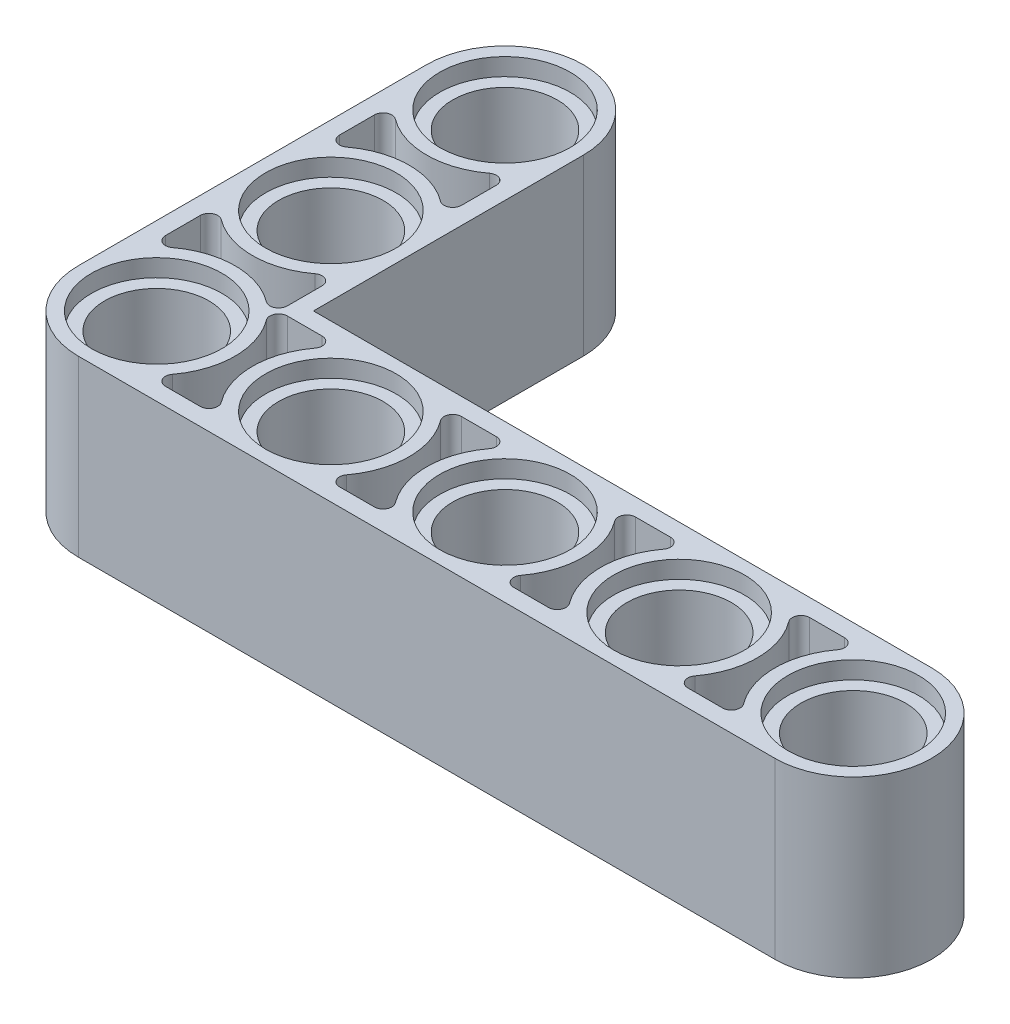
ISO-10303-21;
HEADER;
FILE_DESCRIPTION(('STEP AP214'),'2;1');
FILE_NAME('part.step','',(''),(''),'','','');
FILE_SCHEMA(('AUTOMOTIVE_DESIGN { 1 0 10303 214 1 1 1 1 }'));
ENDSEC;
DATA;
#1=APPLICATION_CONTEXT('core data for automotive mechanical design processes');
#2=APPLICATION_PROTOCOL_DEFINITION('international standard','automotive_design',2000,#1);
#3=PRODUCT_CONTEXT('',#1,'mechanical');
#4=PRODUCT('Part','Part','',(#3));
#5=PRODUCT_RELATED_PRODUCT_CATEGORY('part','',(#4));
#6=PRODUCT_DEFINITION_FORMATION('','',#4);
#7=PRODUCT_DEFINITION_CONTEXT('part definition',#1,'design');
#8=PRODUCT_DEFINITION('design','',#6,#7);
#9=PRODUCT_DEFINITION_SHAPE('','',#8);
#10=(LENGTH_UNIT() NAMED_UNIT(*) SI_UNIT(.MILLI.,.METRE.));
#11=(NAMED_UNIT(*) PLANE_ANGLE_UNIT() SI_UNIT($,.RADIAN.));
#12=(NAMED_UNIT(*) SI_UNIT($,.STERADIAN.) SOLID_ANGLE_UNIT());
#13=UNCERTAINTY_MEASURE_WITH_UNIT(LENGTH_MEASURE(1.E-05),#10,'distance_accuracy_value','');
#14=(GEOMETRIC_REPRESENTATION_CONTEXT(3) GLOBAL_UNCERTAINTY_ASSIGNED_CONTEXT((#13)) GLOBAL_UNIT_ASSIGNED_CONTEXT((#10,
#11,#12)) REPRESENTATION_CONTEXT('',''));
#15=CARTESIAN_POINT('',(0.,0.,0.));
#16=DIRECTION('',(0.,0.,1.));
#17=DIRECTION('',(1.,0.,0.));
#18=AXIS2_PLACEMENT_3D('',#15,#16,#17);
#19=CARTESIAN_POINT('',(-16.,0.,-16.));
#20=DIRECTION('',(0.,-1.,0.));
#21=DIRECTION('',(0.,0.,-1.));
#22=AXIS2_PLACEMENT_3D('',#19,#20,#21);
#23=PLANE('',#22);
#24=CARTESIAN_POINT('',(16.,0.,0.));
#25=DIRECTION('',(0.,1.,0.));
#26=DIRECTION('',(0.,0.,1.));
#27=AXIS2_PLACEMENT_3D('',#24,#25,#26);
#28=CIRCLE('',#27,3.);
#29=CARTESIAN_POINT('',(16.,0.,3.));
#30=VERTEX_POINT('',#29);
#31=EDGE_CURVE('E1715',#30,#30,#28,.T.);
#32=ORIENTED_EDGE('',*,*,#31,.T.);
#33=EDGE_LOOP('',(#32));
#34=FACE_BOUND('',#33,.T.);
#35=CARTESIAN_POINT('',(8.,0.,0.));
#36=DIRECTION('',(0.,1.,0.));
#37=DIRECTION('',(0.,0.,1.));
#38=AXIS2_PLACEMENT_3D('',#35,#36,#37);
#39=CIRCLE('',#38,3.);
#40=CARTESIAN_POINT('',(8.,0.,3.00000000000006));
#41=VERTEX_POINT('',#40);
#42=EDGE_CURVE('E1723',#41,#41,#39,.T.);
#43=ORIENTED_EDGE('',*,*,#42,.T.);
#44=EDGE_LOOP('',(#43));
#45=FACE_BOUND('',#44,.T.);
#46=CARTESIAN_POINT('',(0.,0.,1.1172740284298E-13));
#47=DIRECTION('',(0.,1.,0.));
#48=DIRECTION('',(0.,0.,1.));
#49=AXIS2_PLACEMENT_3D('',#46,#47,#48);
#50=CIRCLE('',#49,3.);
#51=CARTESIAN_POINT('',(0.,0.,3.00000000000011));
#52=VERTEX_POINT('',#51);
#53=EDGE_CURVE('E1731',#52,#52,#50,.T.);
#54=ORIENTED_EDGE('',*,*,#53,.T.);
#55=EDGE_LOOP('',(#54));
#56=FACE_BOUND('',#55,.T.);
#57=CARTESIAN_POINT('',(-8.,0.,1.6759110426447E-13));
#58=DIRECTION('',(0.,1.,0.));
#59=DIRECTION('',(0.,0.,1.));
#60=AXIS2_PLACEMENT_3D('',#57,#58,#59);
#61=CIRCLE('',#60,3.);
#62=CARTESIAN_POINT('',(-8.,0.,3.00000000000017));
#63=VERTEX_POINT('',#62);
#64=EDGE_CURVE('E1739',#63,#63,#61,.T.);
#65=ORIENTED_EDGE('',*,*,#64,.T.);
#66=EDGE_LOOP('',(#65));
#67=FACE_BOUND('',#66,.T.);
#68=CARTESIAN_POINT('',(-16.,0.,2.23454805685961E-13));
#69=DIRECTION('',(0.,1.,0.));
#70=DIRECTION('',(0.,0.,1.));
#71=AXIS2_PLACEMENT_3D('',#68,#69,#70);
#72=CIRCLE('',#71,3.);
#73=CARTESIAN_POINT('',(-16.,0.,3.00000000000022));
#74=VERTEX_POINT('',#73);
#75=EDGE_CURVE('E1747',#74,#74,#72,.T.);
#76=ORIENTED_EDGE('',*,*,#75,.T.);
#77=EDGE_LOOP('',(#76));
#78=FACE_BOUND('',#77,.T.);
#79=CARTESIAN_POINT('',(-16.,0.,-7.99999999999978));
#80=DIRECTION('',(0.,1.,0.));
#81=DIRECTION('',(0.,0.,1.));
#82=AXIS2_PLACEMENT_3D('',#79,#80,#81);
#83=CIRCLE('',#82,3.);
#84=CARTESIAN_POINT('',(-16.,0.,-4.99999999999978));
#85=VERTEX_POINT('',#84);
#86=EDGE_CURVE('E1755',#85,#85,#83,.T.);
#87=ORIENTED_EDGE('',*,*,#86,.T.);
#88=EDGE_LOOP('',(#87));
#89=FACE_BOUND('',#88,.T.);
#90=CARTESIAN_POINT('',(-16.0000000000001,0.,-15.9999999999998));
#91=DIRECTION('',(0.,1.,0.));
#92=DIRECTION('',(0.,0.,1.));
#93=AXIS2_PLACEMENT_3D('',#90,#91,#92);
#94=CIRCLE('',#93,3.);
#95=CARTESIAN_POINT('',(-16.0000000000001,0.,-12.9999999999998));
#96=VERTEX_POINT('',#95);
#97=EDGE_CURVE('E1250',#96,#96,#94,.T.);
#98=ORIENTED_EDGE('',*,*,#97,.T.);
#99=EDGE_LOOP('',(#98));
#100=FACE_BOUND('',#99,.T.);
#101=CARTESIAN_POINT('',(-16.,0.,-16.));
#102=DIRECTION('',(0.,1.,0.));
#103=DIRECTION('',(0.,0.,-1.));
#104=AXIS2_PLACEMENT_3D('',#101,#102,#103);
#105=CIRCLE('',#104,3.6);
#106=CARTESIAN_POINT('',(-12.4,0.,-16.));
#107=VERTEX_POINT('',#106);
#108=CARTESIAN_POINT('',(-19.6,0.,-16.));
#109=VERTEX_POINT('',#108);
#110=EDGE_CURVE('E1847',#107,#109,#105,.T.);
#111=ORIENTED_EDGE('',*,*,#110,.F.);
#112=DIRECTION('',(0.,0.,-1.));
#113=VECTOR('',#112,1.);
#114=CARTESIAN_POINT('',(-12.4,0.,-16.));
#115=LINE('',#114,#113);
#116=CARTESIAN_POINT('',(-12.4,0.,-3.6));
#117=VERTEX_POINT('',#116);
#118=EDGE_CURVE('E1828',#117,#107,#115,.T.);
#119=ORIENTED_EDGE('',*,*,#118,.F.);
#120=DIRECTION('',(-1.,0.,0.));
#121=VECTOR('',#120,1.);
#122=CARTESIAN_POINT('',(16.,0.,-3.6));
#123=LINE('',#122,#121);
#124=CARTESIAN_POINT('',(16.,0.,-3.6));
#125=VERTEX_POINT('',#124);
#126=EDGE_CURVE('E1864',#125,#117,#123,.T.);
#127=ORIENTED_EDGE('',*,*,#126,.F.);
#128=CARTESIAN_POINT('',(16.,0.,0.));
#129=DIRECTION('',(0.,1.,0.));
#130=DIRECTION('',(0.,0.,-1.));
#131=AXIS2_PLACEMENT_3D('',#128,#129,#130);
#132=CIRCLE('',#131,3.6);
#133=CARTESIAN_POINT('',(16.,0.,3.6));
#134=VERTEX_POINT('',#133);
#135=EDGE_CURVE('E1861',#134,#125,#132,.T.);
#136=ORIENTED_EDGE('',*,*,#135,.F.);
#137=DIRECTION('',(1.,0.,0.));
#138=VECTOR('',#137,1.);
#139=CARTESIAN_POINT('',(16.,0.,3.6));
#140=LINE('',#139,#138);
#141=CARTESIAN_POINT('',(-16.,0.,3.6));
#142=VERTEX_POINT('',#141);
#143=EDGE_CURVE('E1858',#142,#134,#140,.T.);
#144=ORIENTED_EDGE('',*,*,#143,.F.);
#145=CARTESIAN_POINT('',(-16.,0.,0.));
#146=DIRECTION('',(0.,1.,0.));
#147=DIRECTION('',(0.,0.,1.));
#148=AXIS2_PLACEMENT_3D('',#145,#146,#147);
#149=CIRCLE('',#148,3.6);
#150=CARTESIAN_POINT('',(-19.6,0.,0.));
#151=VERTEX_POINT('',#150);
#152=EDGE_CURVE('E1855',#151,#142,#149,.T.);
#153=ORIENTED_EDGE('',*,*,#152,.F.);
#154=DIRECTION('',(0.,0.,1.));
#155=VECTOR('',#154,1.);
#156=CARTESIAN_POINT('',(-19.6,0.,-16.));
#157=LINE('',#156,#155);
#158=EDGE_CURVE('E1851',#109,#151,#157,.T.);
#159=ORIENTED_EDGE('',*,*,#158,.F.);
#160=EDGE_LOOP('',(#111,#119,#127,#136,#144,#153,#159));
#161=FACE_BOUND('',#160,.T.);
#162=CARTESIAN_POINT('',(-16.,0.,-7.99999999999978));
#163=DIRECTION('',(0.,-1.,0.));
#164=DIRECTION('',(0.,0.,1.));
#165=AXIS2_PLACEMENT_3D('',#162,#163,#164);
#166=CIRCLE('',#165,3.59999999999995);
#167=CARTESIAN_POINT('',(-18.1600000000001,0.,-10.8799999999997));
#168=VERTEX_POINT('',#167);
#169=CARTESIAN_POINT('',(-13.8400000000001,0.,-10.8799999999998));
#170=VERTEX_POINT('',#169);
#171=EDGE_CURVE('E1131',#168,#170,#166,.T.);
#172=ORIENTED_EDGE('',*,*,#171,.T.);
#173=CARTESIAN_POINT('',(-13.6000000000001,0.,-11.1999999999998));
#174=DIRECTION('',(0.,1.,0.));
#175=DIRECTION('',(0.,0.,-1.));
#176=AXIS2_PLACEMENT_3D('',#173,#174,#175);
#177=CIRCLE('',#176,0.400000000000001);
#178=CARTESIAN_POINT('',(-13.2000000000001,0.,-11.1999999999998));
#179=VERTEX_POINT('',#178);
#180=EDGE_CURVE('E1127',#170,#179,#177,.T.);
#181=ORIENTED_EDGE('',*,*,#180,.T.);
#182=DIRECTION('',(0.,0.,-1.));
#183=VECTOR('',#182,1.);
#184=CARTESIAN_POINT('',(-13.2000000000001,0.,-12.7999999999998));
#185=LINE('',#184,#183);
#186=CARTESIAN_POINT('',(-13.2000000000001,0.,-12.7999999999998));
#187=VERTEX_POINT('',#186);
#188=EDGE_CURVE('E1105',#179,#187,#185,.T.);
#189=ORIENTED_EDGE('',*,*,#188,.T.);
#190=CARTESIAN_POINT('',(-13.6000000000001,0.,-12.7999999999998));
#191=DIRECTION('',(0.,1.,0.));
#192=DIRECTION('',(0.,0.,-1.));
#193=AXIS2_PLACEMENT_3D('',#190,#191,#192);
#194=CIRCLE('',#193,0.4);
#195=CARTESIAN_POINT('',(-13.8400000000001,0.,-13.1199999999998));
#196=VERTEX_POINT('',#195);
#197=EDGE_CURVE('E1151',#187,#196,#194,.T.);
#198=ORIENTED_EDGE('',*,*,#197,.T.);
#199=CARTESIAN_POINT('',(-16.0000000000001,0.,-15.9999999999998));
#200=DIRECTION('',(0.,-1.,0.));
#201=DIRECTION('',(0.,0.,1.));
#202=AXIS2_PLACEMENT_3D('',#199,#200,#201);
#203=CIRCLE('',#202,3.6);
#204=CARTESIAN_POINT('',(-18.1600000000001,0.,-13.1199999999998));
#205=VERTEX_POINT('',#204);
#206=EDGE_CURVE('E1147',#196,#205,#203,.T.);
#207=ORIENTED_EDGE('',*,*,#206,.T.);
#208=CARTESIAN_POINT('',(-18.4000000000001,0.,-12.7999999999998));
#209=DIRECTION('',(0.,1.,0.));
#210=DIRECTION('',(0.,0.,1.));
#211=AXIS2_PLACEMENT_3D('',#208,#209,#210);
#212=CIRCLE('',#211,0.4);
#213=CARTESIAN_POINT('',(-18.8000000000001,0.,-12.7999999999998));
#214=VERTEX_POINT('',#213);
#215=EDGE_CURVE('E1143',#205,#214,#212,.T.);
#216=ORIENTED_EDGE('',*,*,#215,.T.);
#217=DIRECTION('',(0.,0.,1.));
#218=VECTOR('',#217,1.);
#219=CARTESIAN_POINT('',(-18.8000000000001,0.,-11.1999999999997));
#220=LINE('',#219,#218);
#221=CARTESIAN_POINT('',(-18.8000000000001,0.,-11.1999999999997));
#222=VERTEX_POINT('',#221);
#223=EDGE_CURVE('E1139',#214,#222,#220,.T.);
#224=ORIENTED_EDGE('',*,*,#223,.T.);
#225=CARTESIAN_POINT('',(-18.4000000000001,0.,-11.1999999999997));
#226=DIRECTION('',(0.,1.,0.));
#227=DIRECTION('',(0.,0.,1.));
#228=AXIS2_PLACEMENT_3D('',#225,#226,#227);
#229=CIRCLE('',#228,0.399999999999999);
#230=EDGE_CURVE('E1135',#222,#168,#229,.T.);
#231=ORIENTED_EDGE('',*,*,#230,.T.);
#232=EDGE_LOOP('',(#172,#181,#189,#198,#207,#216,#224,#231));
#233=FACE_BOUND('',#232,.T.);
#234=CARTESIAN_POINT('',(-16.,0.,2.23454805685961E-13));
#235=DIRECTION('',(0.,-1.,0.));
#236=DIRECTION('',(0.,0.,1.));
#237=AXIS2_PLACEMENT_3D('',#234,#235,#236);
#238=CIRCLE('',#237,3.59999999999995);
#239=CARTESIAN_POINT('',(-13.1200000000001,0.,-2.15999999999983));
#240=VERTEX_POINT('',#239);
#241=CARTESIAN_POINT('',(-13.12,0.,2.16000000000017));
#242=VERTEX_POINT('',#241);
#243=EDGE_CURVE('E1049',#240,#242,#238,.T.);
#244=ORIENTED_EDGE('',*,*,#243,.T.);
#245=CARTESIAN_POINT('',(-12.8,0.,2.40000000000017));
#246=DIRECTION('',(0.,1.,0.));
#247=DIRECTION('',(0.,0.,-1.));
#248=AXIS2_PLACEMENT_3D('',#245,#246,#247);
#249=CIRCLE('',#248,0.400000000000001);
#250=CARTESIAN_POINT('',(-12.8,0.,2.80000000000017));
#251=VERTEX_POINT('',#250);
#252=EDGE_CURVE('E997',#242,#251,#249,.T.);
#253=ORIENTED_EDGE('',*,*,#252,.T.);
#254=DIRECTION('',(1.,0.,0.));
#255=VECTOR('',#254,1.);
#256=CARTESIAN_POINT('',(-11.2,0.,2.80000000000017));
#257=LINE('',#256,#255);
#258=CARTESIAN_POINT('',(-11.2,0.,2.80000000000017));
#259=VERTEX_POINT('',#258);
#260=EDGE_CURVE('E1024',#251,#259,#257,.T.);
#261=ORIENTED_EDGE('',*,*,#260,.T.);
#262=CARTESIAN_POINT('',(-11.2,0.,2.40000000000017));
#263=DIRECTION('',(0.,1.,0.));
#264=DIRECTION('',(0.,0.,-1.));
#265=AXIS2_PLACEMENT_3D('',#262,#263,#264);
#266=CIRCLE('',#265,0.4);
#267=CARTESIAN_POINT('',(-10.88,0.,2.16000000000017));
#268=VERTEX_POINT('',#267);
#269=EDGE_CURVE('E1069',#259,#268,#266,.T.);
#270=ORIENTED_EDGE('',*,*,#269,.T.);
#271=CARTESIAN_POINT('',(-8.,0.,1.6759110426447E-13));
#272=DIRECTION('',(0.,-1.,0.));
#273=DIRECTION('',(0.,0.,1.));
#274=AXIS2_PLACEMENT_3D('',#271,#272,#273);
#275=CIRCLE('',#274,3.6);
#276=CARTESIAN_POINT('',(-10.88,0.,-2.15999999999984));
#277=VERTEX_POINT('',#276);
#278=EDGE_CURVE('E1065',#268,#277,#275,.T.);
#279=ORIENTED_EDGE('',*,*,#278,.T.);
#280=CARTESIAN_POINT('',(-11.2,0.,-2.39999999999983));
#281=DIRECTION('',(0.,1.,0.));
#282=DIRECTION('',(0.,0.,1.));
#283=AXIS2_PLACEMENT_3D('',#280,#281,#282);
#284=CIRCLE('',#283,0.4);
#285=CARTESIAN_POINT('',(-11.2,0.,-2.79999999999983));
#286=VERTEX_POINT('',#285);
#287=EDGE_CURVE('E1061',#277,#286,#284,.T.);
#288=ORIENTED_EDGE('',*,*,#287,.T.);
#289=DIRECTION('',(-1.,0.,0.));
#290=VECTOR('',#289,1.);
#291=CARTESIAN_POINT('',(-12.8000000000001,0.,-2.79999999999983));
#292=LINE('',#291,#290);
#293=CARTESIAN_POINT('',(-12.8000000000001,0.,-2.79999999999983));
#294=VERTEX_POINT('',#293);
#295=EDGE_CURVE('E1057',#286,#294,#292,.T.);
#296=ORIENTED_EDGE('',*,*,#295,.T.);
#297=CARTESIAN_POINT('',(-12.8000000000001,0.,-2.39999999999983));
#298=DIRECTION('',(0.,1.,0.));
#299=DIRECTION('',(0.,0.,1.));
#300=AXIS2_PLACEMENT_3D('',#297,#298,#299);
#301=CIRCLE('',#300,0.4);
#302=EDGE_CURVE('E1053',#294,#240,#301,.T.);
#303=ORIENTED_EDGE('',*,*,#302,.T.);
#304=EDGE_LOOP('',(#244,#253,#261,#270,#279,#288,#296,#303));
#305=FACE_BOUND('',#304,.T.);
#306=CARTESIAN_POINT('',(-16.,0.,2.23454805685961E-13));
#307=DIRECTION('',(0.,-1.,0.));
#308=DIRECTION('',(0.,0.,1.));
#309=AXIS2_PLACEMENT_3D('',#306,#307,#308);
#310=CIRCLE('',#309,3.59999999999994);
#311=CARTESIAN_POINT('',(-18.1600000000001,0.,-2.87999999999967));
#312=VERTEX_POINT('',#311);
#313=CARTESIAN_POINT('',(-13.8400000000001,0.,-2.87999999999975));
#314=VERTEX_POINT('',#313);
#315=EDGE_CURVE('E965',#312,#314,#310,.T.);
#316=ORIENTED_EDGE('',*,*,#315,.T.);
#317=CARTESIAN_POINT('',(-13.6000000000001,0.,-3.19999999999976));
#318=DIRECTION('',(0.,1.,0.));
#319=DIRECTION('',(0.,0.,-1.));
#320=AXIS2_PLACEMENT_3D('',#317,#318,#319);
#321=CIRCLE('',#320,0.400000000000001);
#322=CARTESIAN_POINT('',(-13.2000000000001,0.,-3.19999999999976));
#323=VERTEX_POINT('',#322);
#324=EDGE_CURVE('E961',#314,#323,#321,.T.);
#325=ORIENTED_EDGE('',*,*,#324,.T.);
#326=DIRECTION('',(0.,0.,-1.));
#327=VECTOR('',#326,1.);
#328=CARTESIAN_POINT('',(-13.2000000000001,0.,-4.79999999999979));
#329=LINE('',#328,#327);
#330=CARTESIAN_POINT('',(-13.2000000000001,0.,-4.79999999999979));
#331=VERTEX_POINT('',#330);
#332=EDGE_CURVE('E939',#323,#331,#329,.T.);
#333=ORIENTED_EDGE('',*,*,#332,.T.);
#334=CARTESIAN_POINT('',(-13.6000000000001,0.,-4.79999999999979));
#335=DIRECTION('',(0.,1.,0.));
#336=DIRECTION('',(0.,0.,-1.));
#337=AXIS2_PLACEMENT_3D('',#334,#335,#336);
#338=CIRCLE('',#337,0.4);
#339=CARTESIAN_POINT('',(-13.8400000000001,0.,-5.11999999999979));
#340=VERTEX_POINT('',#339);
#341=EDGE_CURVE('E986',#331,#340,#338,.T.);
#342=ORIENTED_EDGE('',*,*,#341,.T.);
#343=CARTESIAN_POINT('',(-16.0000000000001,0.,-7.99999999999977));
#344=DIRECTION('',(0.,-1.,0.));
#345=DIRECTION('',(0.,0.,1.));
#346=AXIS2_PLACEMENT_3D('',#343,#344,#345);
#347=CIRCLE('',#346,3.6);
#348=CARTESIAN_POINT('',(-18.1600000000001,0.,-5.11999999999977));
#349=VERTEX_POINT('',#348);
#350=EDGE_CURVE('E982',#340,#349,#347,.T.);
#351=ORIENTED_EDGE('',*,*,#350,.T.);
#352=CARTESIAN_POINT('',(-18.4000000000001,0.,-4.79999999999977));
#353=DIRECTION('',(0.,1.,0.));
#354=DIRECTION('',(0.,0.,1.));
#355=AXIS2_PLACEMENT_3D('',#352,#353,#354);
#356=CIRCLE('',#355,0.4);
#357=CARTESIAN_POINT('',(-18.8000000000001,0.,-4.79999999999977));
#358=VERTEX_POINT('',#357);
#359=EDGE_CURVE('E978',#349,#358,#356,.T.);
#360=ORIENTED_EDGE('',*,*,#359,.T.);
#361=DIRECTION('',(0.,0.,1.));
#362=VECTOR('',#361,1.);
#363=CARTESIAN_POINT('',(-18.8000000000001,0.,-3.19999999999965));
#364=LINE('',#363,#362);
#365=CARTESIAN_POINT('',(-18.8000000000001,0.,-3.19999999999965));
#366=VERTEX_POINT('',#365);
#367=EDGE_CURVE('E974',#358,#366,#364,.T.);
#368=ORIENTED_EDGE('',*,*,#367,.T.);
#369=CARTESIAN_POINT('',(-18.4000000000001,0.,-3.19999999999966));
#370=DIRECTION('',(0.,1.,0.));
#371=DIRECTION('',(0.,0.,1.));
#372=AXIS2_PLACEMENT_3D('',#369,#370,#371);
#373=CIRCLE('',#372,0.399999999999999);
#374=EDGE_CURVE('E970',#366,#312,#373,.T.);
#375=ORIENTED_EDGE('',*,*,#374,.T.);
#376=EDGE_LOOP('',(#316,#325,#333,#342,#351,#360,#368,#375));
#377=FACE_BOUND('',#376,.T.);
#378=CARTESIAN_POINT('',(-8.,0.,1.6759110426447E-13));
#379=DIRECTION('',(0.,-1.,0.));
#380=DIRECTION('',(0.,0.,1.));
#381=AXIS2_PLACEMENT_3D('',#378,#379,#380);
#382=CIRCLE('',#381,3.59999999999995);
#383=CARTESIAN_POINT('',(-5.1200000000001,0.,-2.15999999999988));
#384=VERTEX_POINT('',#383);
#385=CARTESIAN_POINT('',(-5.12000000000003,0.,2.16000000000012));
#386=VERTEX_POINT('',#385);
#387=EDGE_CURVE('E882',#384,#386,#382,.T.);
#388=ORIENTED_EDGE('',*,*,#387,.T.);
#389=CARTESIAN_POINT('',(-4.80000000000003,0.,2.40000000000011));
#390=DIRECTION('',(0.,1.,0.));
#391=DIRECTION('',(0.,0.,-1.));
#392=AXIS2_PLACEMENT_3D('',#389,#390,#391);
#393=CIRCLE('',#392,0.400000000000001);
#394=CARTESIAN_POINT('',(-4.80000000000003,0.,2.80000000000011));
#395=VERTEX_POINT('',#394);
#396=EDGE_CURVE('E878',#386,#395,#393,.T.);
#397=ORIENTED_EDGE('',*,*,#396,.T.);
#398=DIRECTION('',(1.,0.,0.));
#399=VECTOR('',#398,1.);
#400=CARTESIAN_POINT('',(-3.2,0.,2.80000000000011));
#401=LINE('',#400,#399);
#402=CARTESIAN_POINT('',(-3.2,0.,2.80000000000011));
#403=VERTEX_POINT('',#402);
#404=EDGE_CURVE('E856',#395,#403,#401,.T.);
#405=ORIENTED_EDGE('',*,*,#404,.T.);
#406=CARTESIAN_POINT('',(-3.2,0.,2.40000000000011));
#407=DIRECTION('',(0.,1.,0.));
#408=DIRECTION('',(0.,0.,-1.));
#409=AXIS2_PLACEMENT_3D('',#406,#407,#408);
#410=CIRCLE('',#409,0.4);
#411=CARTESIAN_POINT('',(-2.88,0.,2.16000000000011));
#412=VERTEX_POINT('',#411);
#413=EDGE_CURVE('E903',#403,#412,#410,.T.);
#414=ORIENTED_EDGE('',*,*,#413,.T.);
#415=CARTESIAN_POINT('',(0.,0.,1.1172740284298E-13));
#416=DIRECTION('',(0.,-1.,0.));
#417=DIRECTION('',(0.,0.,1.));
#418=AXIS2_PLACEMENT_3D('',#415,#416,#417);
#419=CIRCLE('',#418,3.6);
#420=CARTESIAN_POINT('',(-2.87999999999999,0.,-2.15999999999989));
#421=VERTEX_POINT('',#420);
#422=EDGE_CURVE('E899',#412,#421,#419,.T.);
#423=ORIENTED_EDGE('',*,*,#422,.T.);
#424=CARTESIAN_POINT('',(-3.19999999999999,0.,-2.39999999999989));
#425=DIRECTION('',(0.,1.,0.));
#426=DIRECTION('',(0.,0.,1.));
#427=AXIS2_PLACEMENT_3D('',#424,#425,#426);
#428=CIRCLE('',#427,0.4);
#429=CARTESIAN_POINT('',(-3.19999999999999,0.,-2.79999999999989));
#430=VERTEX_POINT('',#429);
#431=EDGE_CURVE('E895',#421,#430,#428,.T.);
#432=ORIENTED_EDGE('',*,*,#431,.T.);
#433=DIRECTION('',(-1.,0.,0.));
#434=VECTOR('',#433,1.);
#435=CARTESIAN_POINT('',(-4.80000000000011,0.,-2.79999999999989));
#436=LINE('',#435,#434);
#437=CARTESIAN_POINT('',(-4.80000000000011,0.,-2.79999999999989));
#438=VERTEX_POINT('',#437);
#439=EDGE_CURVE('E891',#430,#438,#436,.T.);
#440=ORIENTED_EDGE('',*,*,#439,.T.);
#441=CARTESIAN_POINT('',(-4.80000000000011,0.,-2.39999999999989));
#442=DIRECTION('',(0.,1.,0.));
#443=DIRECTION('',(0.,0.,1.));
#444=AXIS2_PLACEMENT_3D('',#441,#442,#443);
#445=CIRCLE('',#444,0.4);
#446=EDGE_CURVE('E887',#438,#384,#445,.T.);
#447=ORIENTED_EDGE('',*,*,#446,.T.);
#448=EDGE_LOOP('',(#388,#397,#405,#414,#423,#432,#440,#447));
#449=FACE_BOUND('',#448,.T.);
#450=CARTESIAN_POINT('',(0.,0.,1.1172740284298E-13));
#451=DIRECTION('',(0.,-1.,0.));
#452=DIRECTION('',(0.,0.,1.));
#453=AXIS2_PLACEMENT_3D('',#450,#451,#452);
#454=CIRCLE('',#453,3.59999999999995);
#455=CARTESIAN_POINT('',(2.8799999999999,0.,-2.15999999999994));
#456=VERTEX_POINT('',#455);
#457=CARTESIAN_POINT('',(2.87999999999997,0.,2.16000000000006));
#458=VERTEX_POINT('',#457);
#459=EDGE_CURVE('E801',#456,#458,#454,.T.);
#460=ORIENTED_EDGE('',*,*,#459,.T.);
#461=CARTESIAN_POINT('',(3.19999999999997,0.,2.40000000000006));
#462=DIRECTION('',(0.,1.,0.));
#463=DIRECTION('',(0.,0.,-1.));
#464=AXIS2_PLACEMENT_3D('',#461,#462,#463);
#465=CIRCLE('',#464,0.400000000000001);
#466=CARTESIAN_POINT('',(3.19999999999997,0.,2.80000000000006));
#467=VERTEX_POINT('',#466);
#468=EDGE_CURVE('E65',#458,#467,#465,.T.);
#469=ORIENTED_EDGE('',*,*,#468,.T.);
#470=DIRECTION('',(1.,0.,0.));
#471=VECTOR('',#470,1.);
#472=CARTESIAN_POINT('',(4.8,0.,2.80000000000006));
#473=LINE('',#472,#471);
#474=CARTESIAN_POINT('',(4.8,0.,2.80000000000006));
#475=VERTEX_POINT('',#474);
#476=EDGE_CURVE('E777',#467,#475,#473,.T.);
#477=ORIENTED_EDGE('',*,*,#476,.T.);
#478=CARTESIAN_POINT('',(4.8,0.,2.40000000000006));
#479=DIRECTION('',(0.,1.,0.));
#480=DIRECTION('',(0.,0.,-1.));
#481=AXIS2_PLACEMENT_3D('',#478,#479,#480);
#482=CIRCLE('',#481,0.4);
#483=CARTESIAN_POINT('',(5.12,0.,2.16000000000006));
#484=VERTEX_POINT('',#483);
#485=EDGE_CURVE('E822',#475,#484,#482,.T.);
#486=ORIENTED_EDGE('',*,*,#485,.T.);
#487=CARTESIAN_POINT('',(8.,0.,0.));
#488=DIRECTION('',(0.,-1.,0.));
#489=DIRECTION('',(0.,0.,1.));
#490=AXIS2_PLACEMENT_3D('',#487,#488,#489);
#491=CIRCLE('',#490,3.6);
#492=CARTESIAN_POINT('',(5.12000000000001,0.,-2.15999999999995));
#493=VERTEX_POINT('',#492);
#494=EDGE_CURVE('E818',#484,#493,#491,.T.);
#495=ORIENTED_EDGE('',*,*,#494,.T.);
#496=CARTESIAN_POINT('',(4.80000000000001,0.,-2.39999999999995));
#497=DIRECTION('',(0.,1.,0.));
#498=DIRECTION('',(0.,0.,1.));
#499=AXIS2_PLACEMENT_3D('',#496,#497,#498);
#500=CIRCLE('',#499,0.4);
#501=CARTESIAN_POINT('',(4.80000000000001,0.,-2.79999999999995));
#502=VERTEX_POINT('',#501);
#503=EDGE_CURVE('E814',#493,#502,#500,.T.);
#504=ORIENTED_EDGE('',*,*,#503,.T.);
#505=DIRECTION('',(-1.,0.,0.));
#506=VECTOR('',#505,1.);
#507=CARTESIAN_POINT('',(3.19999999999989,0.,-2.79999999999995));
#508=LINE('',#507,#506);
#509=CARTESIAN_POINT('',(3.19999999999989,0.,-2.79999999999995));
#510=VERTEX_POINT('',#509);
#511=EDGE_CURVE('E810',#502,#510,#508,.T.);
#512=ORIENTED_EDGE('',*,*,#511,.T.);
#513=CARTESIAN_POINT('',(3.19999999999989,0.,-2.39999999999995));
#514=DIRECTION('',(0.,1.,0.));
#515=DIRECTION('',(0.,0.,1.));
#516=AXIS2_PLACEMENT_3D('',#513,#514,#515);
#517=CIRCLE('',#516,0.4);
#518=EDGE_CURVE('E806',#510,#456,#517,.T.);
#519=ORIENTED_EDGE('',*,*,#518,.T.);
#520=EDGE_LOOP('',(#460,#469,#477,#486,#495,#504,#512,#519));
#521=FACE_BOUND('',#520,.T.);
#522=CARTESIAN_POINT('',(8.,0.,0.));
#523=DIRECTION('',(0.,-1.,0.));
#524=DIRECTION('',(0.,0.,1.));
#525=AXIS2_PLACEMENT_3D('',#522,#523,#524);
#526=CIRCLE('',#525,3.59999999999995);
#527=CARTESIAN_POINT('',(10.8799999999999,0.,-2.15999999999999));
#528=VERTEX_POINT('',#527);
#529=CARTESIAN_POINT('',(10.88,0.,2.16));
#530=VERTEX_POINT('',#529);
#531=EDGE_CURVE('E728',#528,#530,#526,.T.);
#532=ORIENTED_EDGE('',*,*,#531,.T.);
#533=CARTESIAN_POINT('',(11.2,0.,2.4));
#534=DIRECTION('',(0.,1.,0.));
#535=DIRECTION('',(0.,0.,-1.));
#536=AXIS2_PLACEMENT_3D('',#533,#534,#535);
#537=CIRCLE('',#536,0.400000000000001);
#538=CARTESIAN_POINT('',(11.2,0.,2.8));
#539=VERTEX_POINT('',#538);
#540=EDGE_CURVE('E57',#530,#539,#537,.T.);
#541=ORIENTED_EDGE('',*,*,#540,.T.);
#542=DIRECTION('',(1.,0.,0.));
#543=VECTOR('',#542,1.);
#544=CARTESIAN_POINT('',(12.8,0.,2.8));
#545=LINE('',#544,#543);
#546=CARTESIAN_POINT('',(12.8,0.,2.8));
#547=VERTEX_POINT('',#546);
#548=EDGE_CURVE('E703',#539,#547,#545,.T.);
#549=ORIENTED_EDGE('',*,*,#548,.T.);
#550=CARTESIAN_POINT('',(12.8,0.,2.4));
#551=DIRECTION('',(0.,1.,0.));
#552=DIRECTION('',(0.,0.,-1.));
#553=AXIS2_PLACEMENT_3D('',#550,#551,#552);
#554=CIRCLE('',#553,0.4);
#555=CARTESIAN_POINT('',(13.12,0.,2.16));
#556=VERTEX_POINT('',#555);
#557=EDGE_CURVE('E707',#547,#556,#554,.T.);
#558=ORIENTED_EDGE('',*,*,#557,.T.);
#559=CARTESIAN_POINT('',(16.,0.,0.));
#560=DIRECTION('',(0.,-1.,0.));
#561=DIRECTION('',(0.,0.,1.));
#562=AXIS2_PLACEMENT_3D('',#559,#560,#561);
#563=CIRCLE('',#562,3.6);
#564=CARTESIAN_POINT('',(13.12,0.,-2.16));
#565=VERTEX_POINT('',#564);
#566=EDGE_CURVE('E744',#556,#565,#563,.T.);
#567=ORIENTED_EDGE('',*,*,#566,.T.);
#568=CARTESIAN_POINT('',(12.8,0.,-2.4));
#569=DIRECTION('',(0.,1.,0.));
#570=DIRECTION('',(0.,0.,1.));
#571=AXIS2_PLACEMENT_3D('',#568,#569,#570);
#572=CIRCLE('',#571,0.4);
#573=CARTESIAN_POINT('',(12.8,0.,-2.8));
#574=VERTEX_POINT('',#573);
#575=EDGE_CURVE('E740',#565,#574,#572,.T.);
#576=ORIENTED_EDGE('',*,*,#575,.T.);
#577=DIRECTION('',(-1.,0.,0.));
#578=VECTOR('',#577,1.);
#579=CARTESIAN_POINT('',(11.1999999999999,0.,-2.8));
#580=LINE('',#579,#578);
#581=CARTESIAN_POINT('',(11.1999999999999,0.,-2.8));
#582=VERTEX_POINT('',#581);
#583=EDGE_CURVE('E736',#574,#582,#580,.T.);
#584=ORIENTED_EDGE('',*,*,#583,.T.);
#585=CARTESIAN_POINT('',(11.1999999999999,0.,-2.4));
#586=DIRECTION('',(0.,1.,0.));
#587=DIRECTION('',(0.,0.,1.));
#588=AXIS2_PLACEMENT_3D('',#585,#586,#587);
#589=CIRCLE('',#588,0.4);
#590=EDGE_CURVE('E732',#582,#528,#589,.T.);
#591=ORIENTED_EDGE('',*,*,#590,.T.);
#592=EDGE_LOOP('',(#532,#541,#549,#558,#567,#576,#584,#591));
#593=FACE_BOUND('',#592,.T.);
#594=ADVANCED_FACE('F39',(#34,#45,#56,#67,#78,#89,#100,#161,#233,#305,#377,#449,#521,#593),#23,.T.);
#595=CARTESIAN_POINT('',(0.,8.,0.));
#596=DIRECTION('',(0.,-1.,0.));
#597=DIRECTION('',(0.,0.,-1.));
#598=AXIS2_PLACEMENT_3D('',#595,#596,#597);
#599=CYLINDRICAL_SURFACE('',#598,2.4);
#600=CARTESIAN_POINT('',(0.,7.2,0.));
#601=DIRECTION('',(0.,1.,0.));
#602=DIRECTION('',(0.,0.,1.));
#603=AXIS2_PLACEMENT_3D('',#600,#601,#602);
#604=CIRCLE('',#603,2.4);
#605=CARTESIAN_POINT('',(0.,7.2,2.4));
#606=VERTEX_POINT('',#605);
#607=EDGE_CURVE('E1852',#606,#606,#604,.T.);
#608=ORIENTED_EDGE('',*,*,#607,.T.);
#609=EDGE_LOOP('',(#608));
#610=FACE_BOUND('',#609,.T.);
#611=CARTESIAN_POINT('',(0.,0.8,0.));
#612=DIRECTION('',(0.,-1.,0.));
#613=DIRECTION('',(0.,0.,-1.));
#614=AXIS2_PLACEMENT_3D('',#611,#612,#613);
#615=CIRCLE('',#614,2.4);
#616=CARTESIAN_POINT('',(0.,0.8,-2.4));
#617=VERTEX_POINT('',#616);
#618=EDGE_CURVE('E43',#617,#617,#615,.T.);
#619=ORIENTED_EDGE('',*,*,#618,.T.);
#620=EDGE_LOOP('',(#619));
#621=FACE_BOUND('',#620,.T.);
#622=ADVANCED_FACE('F1944',(#610,#621),#599,.F.);
#623=CARTESIAN_POINT('',(8.,8.,0.));
#624=DIRECTION('',(0.,-1.,0.));
#625=DIRECTION('',(0.,0.,-1.));
#626=AXIS2_PLACEMENT_3D('',#623,#624,#625);
#627=CYLINDRICAL_SURFACE('',#626,2.4);
#628=CARTESIAN_POINT('',(8.,7.2,0.));
#629=DIRECTION('',(0.,1.,0.));
#630=DIRECTION('',(0.,0.,1.));
#631=AXIS2_PLACEMENT_3D('',#628,#629,#630);
#632=CIRCLE('',#631,2.4);
#633=CARTESIAN_POINT('',(8.,7.2,2.4));
#634=VERTEX_POINT('',#633);
#635=EDGE_CURVE('E1910',#634,#634,#632,.T.);
#636=ORIENTED_EDGE('',*,*,#635,.T.);
#637=EDGE_LOOP('',(#636));
#638=FACE_BOUND('',#637,.T.);
#639=CARTESIAN_POINT('',(8.,0.8,0.));
#640=DIRECTION('',(0.,-1.,0.));
#641=DIRECTION('',(0.,0.,-1.));
#642=AXIS2_PLACEMENT_3D('',#639,#640,#641);
#643=CIRCLE('',#642,2.4);
#644=CARTESIAN_POINT('',(8.,0.8,-2.4));
#645=VERTEX_POINT('',#644);
#646=EDGE_CURVE('E1935',#645,#645,#643,.T.);
#647=ORIENTED_EDGE('',*,*,#646,.T.);
#648=EDGE_LOOP('',(#647));
#649=FACE_BOUND('',#648,.T.);
#650=ADVANCED_FACE('F2548',(#638,#649),#627,.F.);
#651=CARTESIAN_POINT('',(16.,8.,0.));
#652=DIRECTION('',(0.,-1.,0.));
#653=DIRECTION('',(0.,0.,-1.));
#654=AXIS2_PLACEMENT_3D('',#651,#652,#653);
#655=CYLINDRICAL_SURFACE('',#654,2.4);
#656=CARTESIAN_POINT('',(16.,7.2,0.));
#657=DIRECTION('',(0.,1.,0.));
#658=DIRECTION('',(0.,0.,1.));
#659=AXIS2_PLACEMENT_3D('',#656,#657,#658);
#660=CIRCLE('',#659,2.4);
#661=CARTESIAN_POINT('',(16.,7.2,2.4));
#662=VERTEX_POINT('',#661);
#663=EDGE_CURVE('E1906',#662,#662,#660,.T.);
#664=ORIENTED_EDGE('',*,*,#663,.T.);
#665=EDGE_LOOP('',(#664));
#666=FACE_BOUND('',#665,.T.);
#667=CARTESIAN_POINT('',(16.,0.8,0.));
#668=DIRECTION('',(0.,-1.,0.));
#669=DIRECTION('',(0.,0.,-1.));
#670=AXIS2_PLACEMENT_3D('',#667,#668,#669);
#671=CIRCLE('',#670,2.4);
#672=CARTESIAN_POINT('',(16.,0.8,-2.4));
#673=VERTEX_POINT('',#672);
#674=EDGE_CURVE('E1932',#673,#673,#671,.T.);
#675=ORIENTED_EDGE('',*,*,#674,.T.);
#676=EDGE_LOOP('',(#675));
#677=FACE_BOUND('',#676,.T.);
#678=ADVANCED_FACE('F2544',(#666,#677),#655,.F.);
#679=CARTESIAN_POINT('',(-8.,8.,0.));
#680=DIRECTION('',(0.,-1.,0.));
#681=DIRECTION('',(0.,0.,-1.));
#682=AXIS2_PLACEMENT_3D('',#679,#680,#681);
#683=CYLINDRICAL_SURFACE('',#682,2.4);
#684=CARTESIAN_POINT('',(-8.,7.2,0.));
#685=DIRECTION('',(0.,1.,0.));
#686=DIRECTION('',(0.,0.,1.));
#687=AXIS2_PLACEMENT_3D('',#684,#685,#686);
#688=CIRCLE('',#687,2.4);
#689=CARTESIAN_POINT('',(-8.,7.2,2.4));
#690=VERTEX_POINT('',#689);
#691=EDGE_CURVE('E1902',#690,#690,#688,.T.);
#692=ORIENTED_EDGE('',*,*,#691,.T.);
#693=EDGE_LOOP('',(#692));
#694=FACE_BOUND('',#693,.T.);
#695=CARTESIAN_POINT('',(-8.,0.8,0.));
#696=DIRECTION('',(0.,-1.,0.));
#697=DIRECTION('',(0.,0.,-1.));
#698=AXIS2_PLACEMENT_3D('',#695,#696,#697);
#699=CIRCLE('',#698,2.4);
#700=CARTESIAN_POINT('',(-8.,0.8,-2.4));
#701=VERTEX_POINT('',#700);
#702=EDGE_CURVE('E1928',#701,#701,#699,.T.);
#703=ORIENTED_EDGE('',*,*,#702,.T.);
#704=EDGE_LOOP('',(#703));
#705=FACE_BOUND('',#704,.T.);
#706=ADVANCED_FACE('F2540',(#694,#705),#683,.F.);
#707=CARTESIAN_POINT('',(-16.,8.,0.));
#708=DIRECTION('',(0.,-1.,0.));
#709=DIRECTION('',(0.,0.,-1.));
#710=AXIS2_PLACEMENT_3D('',#707,#708,#709);
#711=CYLINDRICAL_SURFACE('',#710,2.4);
#712=CARTESIAN_POINT('',(-16.,7.2,0.));
#713=DIRECTION('',(0.,1.,0.));
#714=DIRECTION('',(0.,0.,1.));
#715=AXIS2_PLACEMENT_3D('',#712,#713,#714);
#716=CIRCLE('',#715,2.4);
#717=CARTESIAN_POINT('',(-16.,7.2,2.4));
#718=VERTEX_POINT('',#717);
#719=EDGE_CURVE('E1898',#718,#718,#716,.T.);
#720=ORIENTED_EDGE('',*,*,#719,.T.);
#721=EDGE_LOOP('',(#720));
#722=FACE_BOUND('',#721,.T.);
#723=CARTESIAN_POINT('',(-16.,0.8,0.));
#724=DIRECTION('',(0.,-1.,0.));
#725=DIRECTION('',(0.,0.,-1.));
#726=AXIS2_PLACEMENT_3D('',#723,#724,#725);
#727=CIRCLE('',#726,2.4);
#728=CARTESIAN_POINT('',(-16.,0.8,-2.4));
#729=VERTEX_POINT('',#728);
#730=EDGE_CURVE('E1924',#729,#729,#727,.T.);
#731=ORIENTED_EDGE('',*,*,#730,.T.);
#732=EDGE_LOOP('',(#731));
#733=FACE_BOUND('',#732,.T.);
#734=ADVANCED_FACE('F2536',(#722,#733),#711,.F.);
#735=CARTESIAN_POINT('',(-16.,8.,-8.));
#736=DIRECTION('',(0.,-1.,0.));
#737=DIRECTION('',(0.,0.,-1.));
#738=AXIS2_PLACEMENT_3D('',#735,#736,#737);
#739=CYLINDRICAL_SURFACE('',#738,2.4);
#740=CARTESIAN_POINT('',(-16.,7.2,-8.));
#741=DIRECTION('',(0.,1.,0.));
#742=DIRECTION('',(0.,0.,1.));
#743=AXIS2_PLACEMENT_3D('',#740,#741,#742);
#744=CIRCLE('',#743,2.4);
#745=CARTESIAN_POINT('',(-16.,7.2,-5.6));
#746=VERTEX_POINT('',#745);
#747=EDGE_CURVE('E1894',#746,#746,#744,.T.);
#748=ORIENTED_EDGE('',*,*,#747,.T.);
#749=EDGE_LOOP('',(#748));
#750=FACE_BOUND('',#749,.T.);
#751=CARTESIAN_POINT('',(-16.,0.8,-8.));
#752=DIRECTION('',(0.,-1.,0.));
#753=DIRECTION('',(0.,0.,-1.));
#754=AXIS2_PLACEMENT_3D('',#751,#752,#753);
#755=CIRCLE('',#754,2.4);
#756=CARTESIAN_POINT('',(-16.,0.8,-10.4));
#757=VERTEX_POINT('',#756);
#758=EDGE_CURVE('E1920',#757,#757,#755,.T.);
#759=ORIENTED_EDGE('',*,*,#758,.T.);
#760=EDGE_LOOP('',(#759));
#761=FACE_BOUND('',#760,.T.);
#762=ADVANCED_FACE('F2532',(#750,#761),#739,.F.);
#763=CARTESIAN_POINT('',(-16.,8.,-16.));
#764=DIRECTION('',(0.,-1.,0.));
#765=DIRECTION('',(0.,0.,-1.));
#766=AXIS2_PLACEMENT_3D('',#763,#764,#765);
#767=CYLINDRICAL_SURFACE('',#766,2.4);
#768=CARTESIAN_POINT('',(-16.,7.2,-16.));
#769=DIRECTION('',(0.,1.,0.));
#770=DIRECTION('',(0.,0.,1.));
#771=AXIS2_PLACEMENT_3D('',#768,#769,#770);
#772=CIRCLE('',#771,2.4);
#773=CARTESIAN_POINT('',(-16.,7.2,-13.6));
#774=VERTEX_POINT('',#773);
#775=EDGE_CURVE('E1770',#774,#774,#772,.T.);
#776=ORIENTED_EDGE('',*,*,#775,.T.);
#777=EDGE_LOOP('',(#776));
#778=FACE_BOUND('',#777,.T.);
#779=CARTESIAN_POINT('',(-16.,0.8,-16.));
#780=DIRECTION('',(0.,-1.,0.));
#781=DIRECTION('',(0.,0.,-1.));
#782=AXIS2_PLACEMENT_3D('',#779,#780,#781);
#783=CIRCLE('',#782,2.4);
#784=CARTESIAN_POINT('',(-16.,0.8,-18.4));
#785=VERTEX_POINT('',#784);
#786=EDGE_CURVE('E1714',#785,#785,#783,.T.);
#787=ORIENTED_EDGE('',*,*,#786,.T.);
#788=EDGE_LOOP('',(#787));
#789=FACE_BOUND('',#788,.T.);
#790=ADVANCED_FACE('F2528',(#778,#789),#767,.F.);
#791=CARTESIAN_POINT('',(-16.,8.,-16.));
#792=DIRECTION('',(0.,-1.,0.));
#793=DIRECTION('',(0.,0.,-1.));
#794=AXIS2_PLACEMENT_3D('',#791,#792,#793);
#795=PLANE('',#794);
#796=DIRECTION('',(1.,0.,0.));
#797=VECTOR('',#796,1.);
#798=CARTESIAN_POINT('',(12.8,8.,2.8));
#799=LINE('',#798,#797);
#800=CARTESIAN_POINT('',(11.2,8.,2.8));
#801=VERTEX_POINT('',#800);
#802=CARTESIAN_POINT('',(12.8,8.,2.8));
#803=VERTEX_POINT('',#802);
#804=EDGE_CURVE('E1219',#801,#803,#799,.T.);
#805=ORIENTED_EDGE('',*,*,#804,.F.);
#806=CARTESIAN_POINT('',(11.2,8.,2.4));
#807=DIRECTION('',(0.,1.,0.));
#808=DIRECTION('',(0.,0.,-1.));
#809=AXIS2_PLACEMENT_3D('',#806,#807,#808);
#810=CIRCLE('',#809,0.400000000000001);
#811=CARTESIAN_POINT('',(10.88,8.,2.16));
#812=VERTEX_POINT('',#811);
#813=EDGE_CURVE('E1216',#812,#801,#810,.T.);
#814=ORIENTED_EDGE('',*,*,#813,.F.);
#815=CARTESIAN_POINT('',(8.,8.,0.));
#816=DIRECTION('',(0.,-1.,0.));
#817=DIRECTION('',(0.,0.,1.));
#818=AXIS2_PLACEMENT_3D('',#815,#816,#817);
#819=CIRCLE('',#818,3.59999999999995);
#820=CARTESIAN_POINT('',(10.8799999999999,8.,-2.15999999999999));
#821=VERTEX_POINT('',#820);
#822=EDGE_CURVE('E1187',#821,#812,#819,.T.);
#823=ORIENTED_EDGE('',*,*,#822,.F.);
#824=CARTESIAN_POINT('',(11.1999999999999,8.,-2.4));
#825=DIRECTION('',(0.,1.,0.));
#826=DIRECTION('',(0.,0.,1.));
#827=AXIS2_PLACEMENT_3D('',#824,#825,#826);
#828=CIRCLE('',#827,0.4);
#829=CARTESIAN_POINT('',(11.1999999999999,8.,-2.8));
#830=VERTEX_POINT('',#829);
#831=EDGE_CURVE('E1240',#830,#821,#828,.T.);
#832=ORIENTED_EDGE('',*,*,#831,.F.);
#833=DIRECTION('',(-1.,0.,0.));
#834=VECTOR('',#833,1.);
#835=CARTESIAN_POINT('',(11.1999999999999,8.,-2.8));
#836=LINE('',#835,#834);
#837=CARTESIAN_POINT('',(12.8,8.,-2.8));
#838=VERTEX_POINT('',#837);
#839=EDGE_CURVE('E1236',#838,#830,#836,.T.);
#840=ORIENTED_EDGE('',*,*,#839,.F.);
#841=CARTESIAN_POINT('',(12.8,8.,-2.4));
#842=DIRECTION('',(0.,1.,0.));
#843=DIRECTION('',(0.,0.,1.));
#844=AXIS2_PLACEMENT_3D('',#841,#842,#843);
#845=CIRCLE('',#844,0.4);
#846=CARTESIAN_POINT('',(13.12,8.,-2.16));
#847=VERTEX_POINT('',#846);
#848=EDGE_CURVE('E1232',#847,#838,#845,.T.);
#849=ORIENTED_EDGE('',*,*,#848,.F.);
#850=CARTESIAN_POINT('',(16.,8.,0.));
#851=DIRECTION('',(0.,-1.,0.));
#852=DIRECTION('',(0.,0.,1.));
#853=AXIS2_PLACEMENT_3D('',#850,#851,#852);
#854=CIRCLE('',#853,3.6);
#855=CARTESIAN_POINT('',(13.12,8.,2.16));
#856=VERTEX_POINT('',#855);
#857=EDGE_CURVE('E1228',#856,#847,#854,.T.);
#858=ORIENTED_EDGE('',*,*,#857,.F.);
#859=CARTESIAN_POINT('',(12.8,8.,2.4));
#860=DIRECTION('',(0.,1.,0.));
#861=DIRECTION('',(0.,0.,-1.));
#862=AXIS2_PLACEMENT_3D('',#859,#860,#861);
#863=CIRCLE('',#862,0.4);
#864=EDGE_CURVE('E1224',#803,#856,#863,.T.);
#865=ORIENTED_EDGE('',*,*,#864,.F.);
#866=EDGE_LOOP('',(#805,#814,#823,#832,#840,#849,#858,#865));
#867=FACE_BOUND('',#866,.T.);
#868=DIRECTION('',(1.,0.,0.));
#869=VECTOR('',#868,1.);
#870=CARTESIAN_POINT('',(4.8,8.,2.80000000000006));
#871=LINE('',#870,#869);
#872=CARTESIAN_POINT('',(3.19999999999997,8.,2.80000000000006));
#873=VERTEX_POINT('',#872);
#874=CARTESIAN_POINT('',(4.8,8.,2.80000000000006));
#875=VERTEX_POINT('',#874);
#876=EDGE_CURVE('E1309',#873,#875,#871,.T.);
#877=ORIENTED_EDGE('',*,*,#876,.F.);
#878=CARTESIAN_POINT('',(3.19999999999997,8.,2.40000000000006));
#879=DIRECTION('',(0.,1.,0.));
#880=DIRECTION('',(0.,0.,-1.));
#881=AXIS2_PLACEMENT_3D('',#878,#879,#880);
#882=CIRCLE('',#881,0.400000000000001);
#883=CARTESIAN_POINT('',(2.87999999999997,8.,2.16000000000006));
#884=VERTEX_POINT('',#883);
#885=EDGE_CURVE('E1306',#884,#873,#882,.T.);
#886=ORIENTED_EDGE('',*,*,#885,.F.);
#887=CARTESIAN_POINT('',(0.,8.,1.1172740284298E-13));
#888=DIRECTION('',(0.,-1.,0.));
#889=DIRECTION('',(0.,0.,1.));
#890=AXIS2_PLACEMENT_3D('',#887,#888,#889);
#891=CIRCLE('',#890,3.59999999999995);
#892=CARTESIAN_POINT('',(2.8799999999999,8.,-2.15999999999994));
#893=VERTEX_POINT('',#892);
#894=EDGE_CURVE('E1277',#893,#884,#891,.T.);
#895=ORIENTED_EDGE('',*,*,#894,.F.);
#896=CARTESIAN_POINT('',(3.19999999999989,8.,-2.39999999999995));
#897=DIRECTION('',(0.,1.,0.));
#898=DIRECTION('',(0.,0.,1.));
#899=AXIS2_PLACEMENT_3D('',#896,#897,#898);
#900=CIRCLE('',#899,0.4);
#901=CARTESIAN_POINT('',(3.19999999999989,8.,-2.79999999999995));
#902=VERTEX_POINT('',#901);
#903=EDGE_CURVE('E1330',#902,#893,#900,.T.);
#904=ORIENTED_EDGE('',*,*,#903,.F.);
#905=DIRECTION('',(-1.,0.,0.));
#906=VECTOR('',#905,1.);
#907=CARTESIAN_POINT('',(3.19999999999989,8.,-2.79999999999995));
#908=LINE('',#907,#906);
#909=CARTESIAN_POINT('',(4.80000000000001,8.,-2.79999999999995));
#910=VERTEX_POINT('',#909);
#911=EDGE_CURVE('E1326',#910,#902,#908,.T.);
#912=ORIENTED_EDGE('',*,*,#911,.F.);
#913=CARTESIAN_POINT('',(4.80000000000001,8.,-2.39999999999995));
#914=DIRECTION('',(0.,1.,0.));
#915=DIRECTION('',(0.,0.,1.));
#916=AXIS2_PLACEMENT_3D('',#913,#914,#915);
#917=CIRCLE('',#916,0.4);
#918=CARTESIAN_POINT('',(5.12000000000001,8.,-2.15999999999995));
#919=VERTEX_POINT('',#918);
#920=EDGE_CURVE('E1322',#919,#910,#917,.T.);
#921=ORIENTED_EDGE('',*,*,#920,.F.);
#922=CARTESIAN_POINT('',(8.,8.,0.));
#923=DIRECTION('',(0.,-1.,0.));
#924=DIRECTION('',(0.,0.,1.));
#925=AXIS2_PLACEMENT_3D('',#922,#923,#924);
#926=CIRCLE('',#925,3.6);
#927=CARTESIAN_POINT('',(5.12,8.,2.16000000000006));
#928=VERTEX_POINT('',#927);
#929=EDGE_CURVE('E1318',#928,#919,#926,.T.);
#930=ORIENTED_EDGE('',*,*,#929,.F.);
#931=CARTESIAN_POINT('',(4.8,8.,2.40000000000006));
#932=DIRECTION('',(0.,1.,0.));
#933=DIRECTION('',(0.,0.,-1.));
#934=AXIS2_PLACEMENT_3D('',#931,#932,#933);
#935=CIRCLE('',#934,0.4);
#936=EDGE_CURVE('E1314',#875,#928,#935,.T.);
#937=ORIENTED_EDGE('',*,*,#936,.F.);
#938=EDGE_LOOP('',(#877,#886,#895,#904,#912,#921,#930,#937));
#939=FACE_BOUND('',#938,.T.);
#940=DIRECTION('',(1.,0.,0.));
#941=VECTOR('',#940,1.);
#942=CARTESIAN_POINT('',(-3.2,8.,2.80000000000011));
#943=LINE('',#942,#941);
#944=CARTESIAN_POINT('',(-4.80000000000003,8.,2.80000000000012));
#945=VERTEX_POINT('',#944);
#946=CARTESIAN_POINT('',(-3.2,8.,2.80000000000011));
#947=VERTEX_POINT('',#946);
#948=EDGE_CURVE('E1397',#945,#947,#943,.T.);
#949=ORIENTED_EDGE('',*,*,#948,.F.);
#950=CARTESIAN_POINT('',(-4.80000000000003,8.,2.40000000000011));
#951=DIRECTION('',(0.,1.,0.));
#952=DIRECTION('',(0.,0.,-1.));
#953=AXIS2_PLACEMENT_3D('',#950,#951,#952);
#954=CIRCLE('',#953,0.400000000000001);
#955=CARTESIAN_POINT('',(-5.12000000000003,8.,2.16000000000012));
#956=VERTEX_POINT('',#955);
#957=EDGE_CURVE('E1394',#956,#945,#954,.T.);
#958=ORIENTED_EDGE('',*,*,#957,.F.);
#959=CARTESIAN_POINT('',(-8.,8.,1.6759110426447E-13));
#960=DIRECTION('',(0.,-1.,0.));
#961=DIRECTION('',(0.,0.,1.));
#962=AXIS2_PLACEMENT_3D('',#959,#960,#961);
#963=CIRCLE('',#962,3.59999999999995);
#964=CARTESIAN_POINT('',(-5.1200000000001,8.,-2.15999999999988));
#965=VERTEX_POINT('',#964);
#966=EDGE_CURVE('E1365',#965,#956,#963,.T.);
#967=ORIENTED_EDGE('',*,*,#966,.F.);
#968=CARTESIAN_POINT('',(-4.80000000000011,8.,-2.39999999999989));
#969=DIRECTION('',(0.,1.,0.));
#970=DIRECTION('',(0.,0.,1.));
#971=AXIS2_PLACEMENT_3D('',#968,#969,#970);
#972=CIRCLE('',#971,0.4);
#973=CARTESIAN_POINT('',(-4.80000000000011,8.,-2.79999999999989));
#974=VERTEX_POINT('',#973);
#975=EDGE_CURVE('E1418',#974,#965,#972,.T.);
#976=ORIENTED_EDGE('',*,*,#975,.F.);
#977=DIRECTION('',(-1.,0.,0.));
#978=VECTOR('',#977,1.);
#979=CARTESIAN_POINT('',(-4.80000000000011,8.,-2.79999999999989));
#980=LINE('',#979,#978);
#981=CARTESIAN_POINT('',(-3.19999999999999,8.,-2.79999999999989));
#982=VERTEX_POINT('',#981);
#983=EDGE_CURVE('E1414',#982,#974,#980,.T.);
#984=ORIENTED_EDGE('',*,*,#983,.F.);
#985=CARTESIAN_POINT('',(-3.19999999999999,8.,-2.39999999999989));
#986=DIRECTION('',(0.,1.,0.));
#987=DIRECTION('',(0.,0.,1.));
#988=AXIS2_PLACEMENT_3D('',#985,#986,#987);
#989=CIRCLE('',#988,0.4);
#990=CARTESIAN_POINT('',(-2.87999999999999,8.,-2.15999999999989));
#991=VERTEX_POINT('',#990);
#992=EDGE_CURVE('E1410',#991,#982,#989,.T.);
#993=ORIENTED_EDGE('',*,*,#992,.F.);
#994=CARTESIAN_POINT('',(0.,8.,1.1172740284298E-13));
#995=DIRECTION('',(0.,-1.,0.));
#996=DIRECTION('',(0.,0.,1.));
#997=AXIS2_PLACEMENT_3D('',#994,#995,#996);
#998=CIRCLE('',#997,3.6);
#999=CARTESIAN_POINT('',(-2.88,8.,2.16000000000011));
#1000=VERTEX_POINT('',#999);
#1001=EDGE_CURVE('E1406',#1000,#991,#998,.T.);
#1002=ORIENTED_EDGE('',*,*,#1001,.F.);
#1003=CARTESIAN_POINT('',(-3.2,8.,2.40000000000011));
#1004=DIRECTION('',(0.,1.,0.));
#1005=DIRECTION('',(0.,0.,-1.));
#1006=AXIS2_PLACEMENT_3D('',#1003,#1004,#1005);
#1007=CIRCLE('',#1006,0.4);
#1008=EDGE_CURVE('E1402',#947,#1000,#1007,.T.);
#1009=ORIENTED_EDGE('',*,*,#1008,.F.);
#1010=EDGE_LOOP('',(#949,#958,#967,#976,#984,#993,#1002,#1009));
#1011=FACE_BOUND('',#1010,.T.);
#1012=DIRECTION('',(0.,0.,-1.));
#1013=VECTOR('',#1012,1.);
#1014=CARTESIAN_POINT('',(-13.2000000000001,8.,-4.79999999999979));
#1015=LINE('',#1014,#1013);
#1016=CARTESIAN_POINT('',(-13.2000000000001,8.,-3.19999999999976));
#1017=VERTEX_POINT('',#1016);
#1018=CARTESIAN_POINT('',(-13.2000000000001,8.,-4.79999999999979));
#1019=VERTEX_POINT('',#1018);
#1020=EDGE_CURVE('E1485',#1017,#1019,#1015,.T.);
#1021=ORIENTED_EDGE('',*,*,#1020,.F.);
#1022=CARTESIAN_POINT('',(-13.6000000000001,8.,-3.19999999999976));
#1023=DIRECTION('',(0.,1.,0.));
#1024=DIRECTION('',(0.,0.,-1.));
#1025=AXIS2_PLACEMENT_3D('',#1022,#1023,#1024);
#1026=CIRCLE('',#1025,0.400000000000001);
#1027=CARTESIAN_POINT('',(-13.8400000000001,8.,-2.87999999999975));
#1028=VERTEX_POINT('',#1027);
#1029=EDGE_CURVE('E1482',#1028,#1017,#1026,.T.);
#1030=ORIENTED_EDGE('',*,*,#1029,.F.);
#1031=CARTESIAN_POINT('',(-16.,8.,2.23454805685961E-13));
#1032=DIRECTION('',(0.,-1.,0.));
#1033=DIRECTION('',(0.,0.,1.));
#1034=AXIS2_PLACEMENT_3D('',#1031,#1032,#1033);
#1035=CIRCLE('',#1034,3.59999999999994);
#1036=CARTESIAN_POINT('',(-18.1600000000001,8.,-2.87999999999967));
#1037=VERTEX_POINT('',#1036);
#1038=EDGE_CURVE('E1453',#1037,#1028,#1035,.T.);
#1039=ORIENTED_EDGE('',*,*,#1038,.F.);
#1040=CARTESIAN_POINT('',(-18.4000000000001,8.,-3.19999999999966));
#1041=DIRECTION('',(0.,1.,0.));
#1042=DIRECTION('',(0.,0.,1.));
#1043=AXIS2_PLACEMENT_3D('',#1040,#1041,#1042);
#1044=CIRCLE('',#1043,0.399999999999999);
#1045=CARTESIAN_POINT('',(-18.8000000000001,8.,-3.19999999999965));
#1046=VERTEX_POINT('',#1045);
#1047=EDGE_CURVE('E1506',#1046,#1037,#1044,.T.);
#1048=ORIENTED_EDGE('',*,*,#1047,.F.);
#1049=DIRECTION('',(0.,0.,1.));
#1050=VECTOR('',#1049,1.);
#1051=CARTESIAN_POINT('',(-18.8000000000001,8.,-3.19999999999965));
#1052=LINE('',#1051,#1050);
#1053=CARTESIAN_POINT('',(-18.8000000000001,8.,-4.79999999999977));
#1054=VERTEX_POINT('',#1053);
#1055=EDGE_CURVE('E1502',#1054,#1046,#1052,.T.);
#1056=ORIENTED_EDGE('',*,*,#1055,.F.);
#1057=CARTESIAN_POINT('',(-18.4000000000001,8.,-4.79999999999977));
#1058=DIRECTION('',(0.,1.,0.));
#1059=DIRECTION('',(0.,0.,1.));
#1060=AXIS2_PLACEMENT_3D('',#1057,#1058,#1059);
#1061=CIRCLE('',#1060,0.4);
#1062=CARTESIAN_POINT('',(-18.1600000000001,8.,-5.11999999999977));
#1063=VERTEX_POINT('',#1062);
#1064=EDGE_CURVE('E1498',#1063,#1054,#1061,.T.);
#1065=ORIENTED_EDGE('',*,*,#1064,.F.);
#1066=CARTESIAN_POINT('',(-16.0000000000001,8.,-7.99999999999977));
#1067=DIRECTION('',(0.,-1.,0.));
#1068=DIRECTION('',(0.,0.,1.));
#1069=AXIS2_PLACEMENT_3D('',#1066,#1067,#1068);
#1070=CIRCLE('',#1069,3.6);
#1071=CARTESIAN_POINT('',(-13.8400000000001,8.,-5.11999999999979));
#1072=VERTEX_POINT('',#1071);
#1073=EDGE_CURVE('E1494',#1072,#1063,#1070,.T.);
#1074=ORIENTED_EDGE('',*,*,#1073,.F.);
#1075=CARTESIAN_POINT('',(-13.6000000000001,8.,-4.79999999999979));
#1076=DIRECTION('',(0.,1.,0.));
#1077=DIRECTION('',(0.,0.,-1.));
#1078=AXIS2_PLACEMENT_3D('',#1075,#1076,#1077);
#1079=CIRCLE('',#1078,0.4);
#1080=EDGE_CURVE('E1490',#1019,#1072,#1079,.T.);
#1081=ORIENTED_EDGE('',*,*,#1080,.F.);
#1082=EDGE_LOOP('',(#1021,#1030,#1039,#1048,#1056,#1065,#1074,#1081));
#1083=FACE_BOUND('',#1082,.T.);
#1084=DIRECTION('',(1.,0.,0.));
#1085=VECTOR('',#1084,1.);
#1086=CARTESIAN_POINT('',(-11.2,8.,2.80000000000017));
#1087=LINE('',#1086,#1085);
#1088=CARTESIAN_POINT('',(-12.8,8.,2.80000000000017));
#1089=VERTEX_POINT('',#1088);
#1090=CARTESIAN_POINT('',(-11.2,8.,2.80000000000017));
#1091=VERTEX_POINT('',#1090);
#1092=EDGE_CURVE('E1574',#1089,#1091,#1087,.T.);
#1093=ORIENTED_EDGE('',*,*,#1092,.F.);
#1094=CARTESIAN_POINT('',(-12.8,8.,2.40000000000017));
#1095=DIRECTION('',(0.,1.,0.));
#1096=DIRECTION('',(0.,0.,-1.));
#1097=AXIS2_PLACEMENT_3D('',#1094,#1095,#1096);
#1098=CIRCLE('',#1097,0.400000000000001);
#1099=CARTESIAN_POINT('',(-13.12,8.,2.16000000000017));
#1100=VERTEX_POINT('',#1099);
#1101=EDGE_CURVE('E1516',#1100,#1089,#1098,.T.);
#1102=ORIENTED_EDGE('',*,*,#1101,.F.);
#1103=CARTESIAN_POINT('',(-16.,8.,2.23454805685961E-13));
#1104=DIRECTION('',(0.,-1.,0.));
#1105=DIRECTION('',(0.,0.,1.));
#1106=AXIS2_PLACEMENT_3D('',#1103,#1104,#1105);
#1107=CIRCLE('',#1106,3.59999999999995);
#1108=CARTESIAN_POINT('',(-13.1200000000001,8.,-2.15999999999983));
#1109=VERTEX_POINT('',#1108);
#1110=EDGE_CURVE('E1543',#1109,#1100,#1107,.T.);
#1111=ORIENTED_EDGE('',*,*,#1110,.F.);
#1112=CARTESIAN_POINT('',(-12.8000000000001,8.,-2.39999999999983));
#1113=DIRECTION('',(0.,1.,0.));
#1114=DIRECTION('',(0.,0.,1.));
#1115=AXIS2_PLACEMENT_3D('',#1112,#1113,#1114);
#1116=CIRCLE('',#1115,0.4);
#1117=CARTESIAN_POINT('',(-12.8000000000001,8.,-2.79999999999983));
#1118=VERTEX_POINT('',#1117);
#1119=EDGE_CURVE('E1594',#1118,#1109,#1116,.T.);
#1120=ORIENTED_EDGE('',*,*,#1119,.F.);
#1121=DIRECTION('',(-1.,0.,0.));
#1122=VECTOR('',#1121,1.);
#1123=CARTESIAN_POINT('',(-12.8000000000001,8.,-2.79999999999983));
#1124=LINE('',#1123,#1122);
#1125=CARTESIAN_POINT('',(-11.2,8.,-2.79999999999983));
#1126=VERTEX_POINT('',#1125);
#1127=EDGE_CURVE('E1590',#1126,#1118,#1124,.T.);
#1128=ORIENTED_EDGE('',*,*,#1127,.F.);
#1129=CARTESIAN_POINT('',(-11.2,8.,-2.39999999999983));
#1130=DIRECTION('',(0.,1.,0.));
#1131=DIRECTION('',(0.,0.,1.));
#1132=AXIS2_PLACEMENT_3D('',#1129,#1130,#1131);
#1133=CIRCLE('',#1132,0.4);
#1134=CARTESIAN_POINT('',(-10.88,8.,-2.15999999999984));
#1135=VERTEX_POINT('',#1134);
#1136=EDGE_CURVE('E1586',#1135,#1126,#1133,.T.);
#1137=ORIENTED_EDGE('',*,*,#1136,.F.);
#1138=CARTESIAN_POINT('',(-8.,8.,1.6759110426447E-13));
#1139=DIRECTION('',(0.,-1.,0.));
#1140=DIRECTION('',(0.,0.,1.));
#1141=AXIS2_PLACEMENT_3D('',#1138,#1139,#1140);
#1142=CIRCLE('',#1141,3.6);
#1143=CARTESIAN_POINT('',(-10.88,8.,2.16000000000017));
#1144=VERTEX_POINT('',#1143);
#1145=EDGE_CURVE('E1582',#1144,#1135,#1142,.T.);
#1146=ORIENTED_EDGE('',*,*,#1145,.F.);
#1147=CARTESIAN_POINT('',(-11.2,8.,2.40000000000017));
#1148=DIRECTION('',(0.,1.,0.));
#1149=DIRECTION('',(0.,0.,-1.));
#1150=AXIS2_PLACEMENT_3D('',#1147,#1148,#1149);
#1151=CIRCLE('',#1150,0.4);
#1152=EDGE_CURVE('E1578',#1091,#1144,#1151,.T.);
#1153=ORIENTED_EDGE('',*,*,#1152,.F.);
#1154=EDGE_LOOP('',(#1093,#1102,#1111,#1120,#1128,#1137,#1146,#1153));
#1155=FACE_BOUND('',#1154,.T.);
#1156=DIRECTION('',(0.,0.,-1.));
#1157=VECTOR('',#1156,1.);
#1158=CARTESIAN_POINT('',(-13.2000000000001,8.,-12.7999999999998));
#1159=LINE('',#1158,#1157);
#1160=CARTESIAN_POINT('',(-13.2000000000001,8.,-11.1999999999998));
#1161=VERTEX_POINT('',#1160);
#1162=CARTESIAN_POINT('',(-13.2000000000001,8.,-12.7999999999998));
#1163=VERTEX_POINT('',#1162);
#1164=EDGE_CURVE('E1660',#1161,#1163,#1159,.T.);
#1165=ORIENTED_EDGE('',*,*,#1164,.F.);
#1166=CARTESIAN_POINT('',(-13.6000000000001,8.,-11.1999999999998));
#1167=DIRECTION('',(0.,1.,0.));
#1168=DIRECTION('',(0.,0.,-1.));
#1169=AXIS2_PLACEMENT_3D('',#1166,#1167,#1168);
#1170=CIRCLE('',#1169,0.400000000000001);
#1171=CARTESIAN_POINT('',(-13.8400000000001,8.,-10.8799999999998));
#1172=VERTEX_POINT('',#1171);
#1173=EDGE_CURVE('E754',#1172,#1161,#1170,.T.);
#1174=ORIENTED_EDGE('',*,*,#1173,.F.);
#1175=CARTESIAN_POINT('',(-16.,8.,-7.99999999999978));
#1176=DIRECTION('',(0.,-1.,0.));
#1177=DIRECTION('',(0.,0.,1.));
#1178=AXIS2_PLACEMENT_3D('',#1175,#1176,#1177);
#1179=CIRCLE('',#1178,3.59999999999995);
#1180=CARTESIAN_POINT('',(-18.1600000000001,8.,-10.8799999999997));
#1181=VERTEX_POINT('',#1180);
#1182=EDGE_CURVE('E1629',#1181,#1172,#1179,.T.);
#1183=ORIENTED_EDGE('',*,*,#1182,.F.);
#1184=CARTESIAN_POINT('',(-18.4000000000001,8.,-11.1999999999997));
#1185=DIRECTION('',(0.,1.,0.));
#1186=DIRECTION('',(0.,0.,1.));
#1187=AXIS2_PLACEMENT_3D('',#1184,#1185,#1186);
#1188=CIRCLE('',#1187,0.399999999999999);
#1189=CARTESIAN_POINT('',(-18.8000000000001,8.,-11.1999999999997));
#1190=VERTEX_POINT('',#1189);
#1191=EDGE_CURVE('E1680',#1190,#1181,#1188,.T.);
#1192=ORIENTED_EDGE('',*,*,#1191,.F.);
#1193=DIRECTION('',(0.,0.,1.));
#1194=VECTOR('',#1193,1.);
#1195=CARTESIAN_POINT('',(-18.8000000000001,8.,-11.1999999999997));
#1196=LINE('',#1195,#1194);
#1197=CARTESIAN_POINT('',(-18.8000000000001,8.,-12.7999999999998));
#1198=VERTEX_POINT('',#1197);
#1199=EDGE_CURVE('E1676',#1198,#1190,#1196,.T.);
#1200=ORIENTED_EDGE('',*,*,#1199,.F.);
#1201=CARTESIAN_POINT('',(-18.4000000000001,8.,-12.7999999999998));
#1202=DIRECTION('',(0.,1.,0.));
#1203=DIRECTION('',(0.,0.,1.));
#1204=AXIS2_PLACEMENT_3D('',#1201,#1202,#1203);
#1205=CIRCLE('',#1204,0.4);
#1206=CARTESIAN_POINT('',(-18.1600000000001,8.,-13.1199999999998));
#1207=VERTEX_POINT('',#1206);
#1208=EDGE_CURVE('E1672',#1207,#1198,#1205,.T.);
#1209=ORIENTED_EDGE('',*,*,#1208,.F.);
#1210=CARTESIAN_POINT('',(-16.0000000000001,8.,-15.9999999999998));
#1211=DIRECTION('',(0.,-1.,0.));
#1212=DIRECTION('',(0.,0.,1.));
#1213=AXIS2_PLACEMENT_3D('',#1210,#1211,#1212);
#1214=CIRCLE('',#1213,3.6);
#1215=CARTESIAN_POINT('',(-13.8400000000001,8.,-13.1199999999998));
#1216=VERTEX_POINT('',#1215);
#1217=EDGE_CURVE('E1668',#1216,#1207,#1214,.T.);
#1218=ORIENTED_EDGE('',*,*,#1217,.F.);
#1219=CARTESIAN_POINT('',(-13.6000000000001,8.,-12.7999999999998));
#1220=DIRECTION('',(0.,1.,0.));
#1221=DIRECTION('',(0.,0.,-1.));
#1222=AXIS2_PLACEMENT_3D('',#1219,#1220,#1221);
#1223=CIRCLE('',#1222,0.4);
#1224=EDGE_CURVE('E1664',#1163,#1216,#1223,.T.);
#1225=ORIENTED_EDGE('',*,*,#1224,.F.);
#1226=EDGE_LOOP('',(#1165,#1174,#1183,#1192,#1200,#1209,#1218,#1225));
#1227=FACE_BOUND('',#1226,.T.);
#1228=CARTESIAN_POINT('',(16.,8.,0.));
#1229=DIRECTION('',(0.,1.,0.));
#1230=DIRECTION('',(0.,0.,1.));
#1231=AXIS2_PLACEMENT_3D('',#1228,#1229,#1230);
#1232=CIRCLE('',#1231,3.);
#1233=CARTESIAN_POINT('',(16.,8.,3.));
#1234=VERTEX_POINT('',#1233);
#1235=EDGE_CURVE('E1771',#1234,#1234,#1232,.T.);
#1236=ORIENTED_EDGE('',*,*,#1235,.F.);
#1237=EDGE_LOOP('',(#1236));
#1238=FACE_BOUND('',#1237,.T.);
#1239=CARTESIAN_POINT('',(8.,8.,0.));
#1240=DIRECTION('',(0.,1.,0.));
#1241=DIRECTION('',(0.,0.,1.));
#1242=AXIS2_PLACEMENT_3D('',#1239,#1240,#1241);
#1243=CIRCLE('',#1242,3.);
#1244=CARTESIAN_POINT('',(8.,8.,3.00000000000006));
#1245=VERTEX_POINT('',#1244);
#1246=EDGE_CURVE('E1779',#1245,#1245,#1243,.T.);
#1247=ORIENTED_EDGE('',*,*,#1246,.F.);
#1248=EDGE_LOOP('',(#1247));
#1249=FACE_BOUND('',#1248,.T.);
#1250=CARTESIAN_POINT('',(0.,8.,1.1172740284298E-13));
#1251=DIRECTION('',(0.,1.,0.));
#1252=DIRECTION('',(0.,0.,1.));
#1253=AXIS2_PLACEMENT_3D('',#1250,#1251,#1252);
#1254=CIRCLE('',#1253,3.);
#1255=CARTESIAN_POINT('',(0.,8.,3.00000000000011));
#1256=VERTEX_POINT('',#1255);
#1257=EDGE_CURVE('E1787',#1256,#1256,#1254,.T.);
#1258=ORIENTED_EDGE('',*,*,#1257,.F.);
#1259=EDGE_LOOP('',(#1258));
#1260=FACE_BOUND('',#1259,.T.);
#1261=CARTESIAN_POINT('',(-8.,8.,1.6759110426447E-13));
#1262=DIRECTION('',(0.,1.,0.));
#1263=DIRECTION('',(0.,0.,1.));
#1264=AXIS2_PLACEMENT_3D('',#1261,#1262,#1263);
#1265=CIRCLE('',#1264,3.);
#1266=CARTESIAN_POINT('',(-8.,8.,3.00000000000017));
#1267=VERTEX_POINT('',#1266);
#1268=EDGE_CURVE('E1795',#1267,#1267,#1265,.T.);
#1269=ORIENTED_EDGE('',*,*,#1268,.F.);
#1270=EDGE_LOOP('',(#1269));
#1271=FACE_BOUND('',#1270,.T.);
#1272=CARTESIAN_POINT('',(-16.,8.,2.23454805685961E-13));
#1273=DIRECTION('',(0.,1.,0.));
#1274=DIRECTION('',(0.,0.,1.));
#1275=AXIS2_PLACEMENT_3D('',#1272,#1273,#1274);
#1276=CIRCLE('',#1275,3.);
#1277=CARTESIAN_POINT('',(-16.,8.,3.00000000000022));
#1278=VERTEX_POINT('',#1277);
#1279=EDGE_CURVE('E1803',#1278,#1278,#1276,.T.);
#1280=ORIENTED_EDGE('',*,*,#1279,.F.);
#1281=EDGE_LOOP('',(#1280));
#1282=FACE_BOUND('',#1281,.T.);
#1283=CARTESIAN_POINT('',(-16.,8.,-7.99999999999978));
#1284=DIRECTION('',(0.,1.,0.));
#1285=DIRECTION('',(0.,0.,1.));
#1286=AXIS2_PLACEMENT_3D('',#1283,#1284,#1285);
#1287=CIRCLE('',#1286,3.);
#1288=CARTESIAN_POINT('',(-16.,8.,-4.99999999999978));
#1289=VERTEX_POINT('',#1288);
#1290=EDGE_CURVE('E1811',#1289,#1289,#1287,.T.);
#1291=ORIENTED_EDGE('',*,*,#1290,.F.);
#1292=EDGE_LOOP('',(#1291));
#1293=FACE_BOUND('',#1292,.T.);
#1294=CARTESIAN_POINT('',(-16.0000000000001,8.,-15.9999999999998));
#1295=DIRECTION('',(0.,1.,0.));
#1296=DIRECTION('',(0.,0.,1.));
#1297=AXIS2_PLACEMENT_3D('',#1294,#1295,#1296);
#1298=CIRCLE('',#1297,3.);
#1299=CARTESIAN_POINT('',(-16.0000000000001,8.,-12.9999999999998));
#1300=VERTEX_POINT('',#1299);
#1301=EDGE_CURVE('E1819',#1300,#1300,#1298,.T.);
#1302=ORIENTED_EDGE('',*,*,#1301,.F.);
#1303=EDGE_LOOP('',(#1302));
#1304=FACE_BOUND('',#1303,.T.);
#1305=CARTESIAN_POINT('',(-16.,8.,-16.));
#1306=DIRECTION('',(0.,1.,0.));
#1307=DIRECTION('',(0.,0.,-1.));
#1308=AXIS2_PLACEMENT_3D('',#1305,#1306,#1307);
#1309=CIRCLE('',#1308,3.6);
#1310=CARTESIAN_POINT('',(-12.4,8.,-16.));
#1311=VERTEX_POINT('',#1310);
#1312=CARTESIAN_POINT('',(-19.6,8.,-16.));
#1313=VERTEX_POINT('',#1312);
#1314=EDGE_CURVE('E1823',#1311,#1313,#1309,.T.);
#1315=ORIENTED_EDGE('',*,*,#1314,.T.);
#1316=DIRECTION('',(0.,0.,1.));
#1317=VECTOR('',#1316,1.);
#1318=CARTESIAN_POINT('',(-19.6,8.,-16.));
#1319=LINE('',#1318,#1317);
#1320=CARTESIAN_POINT('',(-19.6,8.,0.));
#1321=VERTEX_POINT('',#1320);
#1322=EDGE_CURVE('E1827',#1313,#1321,#1319,.T.);
#1323=ORIENTED_EDGE('',*,*,#1322,.T.);
#1324=CARTESIAN_POINT('',(-16.,8.,0.));
#1325=DIRECTION('',(0.,1.,0.));
#1326=DIRECTION('',(0.,0.,1.));
#1327=AXIS2_PLACEMENT_3D('',#1324,#1325,#1326);
#1328=CIRCLE('',#1327,3.6);
#1329=CARTESIAN_POINT('',(-16.,8.,3.6));
#1330=VERTEX_POINT('',#1329);
#1331=EDGE_CURVE('E1831',#1321,#1330,#1328,.T.);
#1332=ORIENTED_EDGE('',*,*,#1331,.T.);
#1333=DIRECTION('',(1.,0.,0.));
#1334=VECTOR('',#1333,1.);
#1335=CARTESIAN_POINT('',(16.,8.,3.6));
#1336=LINE('',#1335,#1334);
#1337=CARTESIAN_POINT('',(16.,8.,3.6));
#1338=VERTEX_POINT('',#1337);
#1339=EDGE_CURVE('E1834',#1330,#1338,#1336,.T.);
#1340=ORIENTED_EDGE('',*,*,#1339,.T.);
#1341=CARTESIAN_POINT('',(16.,8.,0.));
#1342=DIRECTION('',(0.,1.,0.));
#1343=DIRECTION('',(0.,0.,-1.));
#1344=AXIS2_PLACEMENT_3D('',#1341,#1342,#1343);
#1345=CIRCLE('',#1344,3.6);
#1346=CARTESIAN_POINT('',(16.,8.,-3.6));
#1347=VERTEX_POINT('',#1346);
#1348=EDGE_CURVE('E1837',#1338,#1347,#1345,.T.);
#1349=ORIENTED_EDGE('',*,*,#1348,.T.);
#1350=DIRECTION('',(-1.,0.,0.));
#1351=VECTOR('',#1350,1.);
#1352=CARTESIAN_POINT('',(16.,8.,-3.6));
#1353=LINE('',#1352,#1351);
#1354=CARTESIAN_POINT('',(-12.4,8.,-3.6));
#1355=VERTEX_POINT('',#1354);
#1356=EDGE_CURVE('E1840',#1347,#1355,#1353,.T.);
#1357=ORIENTED_EDGE('',*,*,#1356,.T.);
#1358=DIRECTION('',(0.,0.,-1.));
#1359=VECTOR('',#1358,1.);
#1360=CARTESIAN_POINT('',(-12.4,8.,-16.));
#1361=LINE('',#1360,#1359);
#1362=EDGE_CURVE('E1843',#1355,#1311,#1361,.T.);
#1363=ORIENTED_EDGE('',*,*,#1362,.T.);
#1364=EDGE_LOOP('',(#1315,#1323,#1332,#1340,#1349,#1357,#1363));
#1365=FACE_BOUND('',#1364,.T.);
#1366=ADVANCED_FACE('F2531',(#867,#939,#1011,#1083,#1155,#1227,#1238,#1249,#1260,#1271,#1282,
#1293,#1304,#1365),#795,.F.);
#1367=CARTESIAN_POINT('',(-16.,8.,-16.));
#1368=DIRECTION('',(0.,-1.,0.));
#1369=DIRECTION('',(0.,0.,-1.));
#1370=AXIS2_PLACEMENT_3D('',#1367,#1368,#1369);
#1371=CYLINDRICAL_SURFACE('',#1370,3.6);
#1372=ORIENTED_EDGE('',*,*,#110,.T.);
#1373=DIRECTION('',(0.,-1.,0.));
#1374=VECTOR('',#1373,1.);
#1375=CARTESIAN_POINT('',(-19.6,8.,-16.));
#1376=LINE('',#1375,#1374);
#1377=EDGE_CURVE('E11',#1313,#109,#1376,.T.);
#1378=ORIENTED_EDGE('',*,*,#1377,.F.);
#1379=ORIENTED_EDGE('',*,*,#1314,.F.);
#1380=DIRECTION('',(0.,-1.,0.));
#1381=VECTOR('',#1380,1.);
#1382=CARTESIAN_POINT('',(-12.4,8.,-16.));
#1383=LINE('',#1382,#1381);
#1384=EDGE_CURVE('E1846',#1311,#107,#1383,.T.);
#1385=ORIENTED_EDGE('',*,*,#1384,.T.);
#1386=EDGE_LOOP('',(#1372,#1378,#1379,#1385));
#1387=FACE_BOUND('',#1386,.T.);
#1388=ADVANCED_FACE('F41',(#1387),#1371,.T.);
#1389=CARTESIAN_POINT('',(-19.6,8.,-16.));
#1390=DIRECTION('',(1.,0.,0.));
#1391=DIRECTION('',(0.,0.,-1.));
#1392=AXIS2_PLACEMENT_3D('',#1389,#1390,#1391);
#1393=PLANE('',#1392);
#1394=ORIENTED_EDGE('',*,*,#158,.T.);
#1395=DIRECTION('',(0.,-1.,0.));
#1396=VECTOR('',#1395,1.);
#1397=CARTESIAN_POINT('',(-19.6,8.,0.));
#1398=LINE('',#1397,#1396);
#1399=EDGE_CURVE('E49',#1321,#151,#1398,.T.);
#1400=ORIENTED_EDGE('',*,*,#1399,.F.);
#1401=ORIENTED_EDGE('',*,*,#1322,.F.);
#1402=ORIENTED_EDGE('',*,*,#1377,.T.);
#1403=EDGE_LOOP('',(#1394,#1400,#1401,#1402));
#1404=FACE_BOUND('',#1403,.T.);
#1405=ADVANCED_FACE('F2576',(#1404),#1393,.F.);
#1406=CARTESIAN_POINT('',(-16.,8.,0.));
#1407=DIRECTION('',(0.,-1.,0.));
#1408=DIRECTION('',(0.,0.,-1.));
#1409=AXIS2_PLACEMENT_3D('',#1406,#1407,#1408);
#1410=CYLINDRICAL_SURFACE('',#1409,3.6);
#1411=ORIENTED_EDGE('',*,*,#152,.T.);
#1412=DIRECTION('',(0.,-1.,0.));
#1413=VECTOR('',#1412,1.);
#1414=CARTESIAN_POINT('',(-16.,8.,3.6));
#1415=LINE('',#1414,#1413);
#1416=EDGE_CURVE('E1884',#1330,#142,#1415,.T.);
#1417=ORIENTED_EDGE('',*,*,#1416,.F.);
#1418=ORIENTED_EDGE('',*,*,#1331,.F.);
#1419=ORIENTED_EDGE('',*,*,#1399,.T.);
#1420=EDGE_LOOP('',(#1411,#1417,#1418,#1419));
#1421=FACE_BOUND('',#1420,.T.);
#1422=ADVANCED_FACE('F2573',(#1421),#1410,.T.);
#1423=CARTESIAN_POINT('',(16.,8.,3.6));
#1424=DIRECTION('',(0.,0.,-1.));
#1425=DIRECTION('',(-1.,0.,0.));
#1426=AXIS2_PLACEMENT_3D('',#1423,#1424,#1425);
#1427=PLANE('',#1426);
#1428=ORIENTED_EDGE('',*,*,#143,.T.);
#1429=DIRECTION('',(0.,-1.,0.));
#1430=VECTOR('',#1429,1.);
#1431=CARTESIAN_POINT('',(16.,8.,3.6));
#1432=LINE('',#1431,#1430);
#1433=EDGE_CURVE('E1880',#1338,#134,#1432,.T.);
#1434=ORIENTED_EDGE('',*,*,#1433,.F.);
#1435=ORIENTED_EDGE('',*,*,#1339,.F.);
#1436=ORIENTED_EDGE('',*,*,#1416,.T.);
#1437=EDGE_LOOP('',(#1428,#1434,#1435,#1436));
#1438=FACE_BOUND('',#1437,.T.);
#1439=ADVANCED_FACE('F2569',(#1438),#1427,.F.);
#1440=CARTESIAN_POINT('',(16.,8.,0.));
#1441=DIRECTION('',(0.,-1.,0.));
#1442=DIRECTION('',(0.,0.,-1.));
#1443=AXIS2_PLACEMENT_3D('',#1440,#1441,#1442);
#1444=CYLINDRICAL_SURFACE('',#1443,3.6);
#1445=ORIENTED_EDGE('',*,*,#135,.T.);
#1446=DIRECTION('',(0.,-1.,0.));
#1447=VECTOR('',#1446,1.);
#1448=CARTESIAN_POINT('',(16.,8.,-3.6));
#1449=LINE('',#1448,#1447);
#1450=EDGE_CURVE('E1876',#1347,#125,#1449,.T.);
#1451=ORIENTED_EDGE('',*,*,#1450,.F.);
#1452=ORIENTED_EDGE('',*,*,#1348,.F.);
#1453=ORIENTED_EDGE('',*,*,#1433,.T.);
#1454=EDGE_LOOP('',(#1445,#1451,#1452,#1453));
#1455=FACE_BOUND('',#1454,.T.);
#1456=ADVANCED_FACE('F2565',(#1455),#1444,.T.);
#1457=CARTESIAN_POINT('',(16.,8.,-3.6));
#1458=DIRECTION('',(0.,0.,1.));
#1459=DIRECTION('',(1.,0.,0.));
#1460=AXIS2_PLACEMENT_3D('',#1457,#1458,#1459);
#1461=PLANE('',#1460);
#1462=ORIENTED_EDGE('',*,*,#126,.T.);
#1463=DIRECTION('',(0.,-1.,0.));
#1464=VECTOR('',#1463,1.);
#1465=CARTESIAN_POINT('',(-12.4,8.,-3.6));
#1466=LINE('',#1465,#1464);
#1467=EDGE_CURVE('E1872',#1355,#117,#1466,.T.);
#1468=ORIENTED_EDGE('',*,*,#1467,.F.);
#1469=ORIENTED_EDGE('',*,*,#1356,.F.);
#1470=ORIENTED_EDGE('',*,*,#1450,.T.);
#1471=EDGE_LOOP('',(#1462,#1468,#1469,#1470));
#1472=FACE_BOUND('',#1471,.T.);
#1473=ADVANCED_FACE('F2561',(#1472),#1461,.F.);
#1474=CARTESIAN_POINT('',(-12.4,8.,-16.));
#1475=DIRECTION('',(-1.,0.,0.));
#1476=DIRECTION('',(0.,0.,1.));
#1477=AXIS2_PLACEMENT_3D('',#1474,#1475,#1476);
#1478=PLANE('',#1477);
#1479=ORIENTED_EDGE('',*,*,#118,.T.);
#1480=ORIENTED_EDGE('',*,*,#1384,.F.);
#1481=ORIENTED_EDGE('',*,*,#1362,.F.);
#1482=ORIENTED_EDGE('',*,*,#1467,.T.);
#1483=EDGE_LOOP('',(#1479,#1480,#1481,#1482));
#1484=FACE_BOUND('',#1483,.T.);
#1485=ADVANCED_FACE('F2526',(#1484),#1478,.F.);
#1486=CARTESIAN_POINT('',(-16.0000000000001,7.2,-15.9999999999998));
#1487=DIRECTION('',(0.,1.,0.));
#1488=DIRECTION('',(0.,0.,1.));
#1489=AXIS2_PLACEMENT_3D('',#1486,#1487,#1488);
#1490=CYLINDRICAL_SURFACE('',#1489,3.);
#1491=CARTESIAN_POINT('',(-16.0000000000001,7.2,-15.9999999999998));
#1492=DIRECTION('',(0.,1.,0.));
#1493=DIRECTION('',(0.,0.,1.));
#1494=AXIS2_PLACEMENT_3D('',#1491,#1492,#1493);
#1495=CIRCLE('',#1494,3.);
#1496=CARTESIAN_POINT('',(-16.0000000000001,7.2,-12.9999999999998));
#1497=VERTEX_POINT('',#1496);
#1498=EDGE_CURVE('E1815',#1497,#1497,#1495,.T.);
#1499=ORIENTED_EDGE('',*,*,#1498,.F.);
#1500=EDGE_LOOP('',(#1499));
#1501=FACE_BOUND('',#1500,.T.);
#1502=ORIENTED_EDGE('',*,*,#1301,.T.);
#1503=EDGE_LOOP('',(#1502));
#1504=FACE_BOUND('',#1503,.T.);
#1505=ADVANCED_FACE('F2522',(#1501,#1504),#1490,.F.);
#1506=CARTESIAN_POINT('',(-16.0000000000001,7.2,-15.9999999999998));
#1507=DIRECTION('',(0.,1.,0.));
#1508=DIRECTION('',(0.,0.,1.));
#1509=AXIS2_PLACEMENT_3D('',#1506,#1507,#1508);
#1510=PLANE('',#1509);
#1511=ORIENTED_EDGE('',*,*,#775,.F.);
#1512=EDGE_LOOP('',(#1511));
#1513=FACE_BOUND('',#1512,.T.);
#1514=ORIENTED_EDGE('',*,*,#1498,.T.);
#1515=EDGE_LOOP('',(#1514));
#1516=FACE_BOUND('',#1515,.T.);
#1517=ADVANCED_FACE('F2518',(#1513,#1516),#1510,.T.);
#1518=CARTESIAN_POINT('',(-16.,7.2,-7.99999999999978));
#1519=DIRECTION('',(0.,1.,0.));
#1520=DIRECTION('',(0.,0.,1.));
#1521=AXIS2_PLACEMENT_3D('',#1518,#1519,#1520);
#1522=CYLINDRICAL_SURFACE('',#1521,3.);
#1523=CARTESIAN_POINT('',(-16.,7.2,-7.99999999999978));
#1524=DIRECTION('',(0.,1.,0.));
#1525=DIRECTION('',(0.,0.,1.));
#1526=AXIS2_PLACEMENT_3D('',#1523,#1524,#1525);
#1527=CIRCLE('',#1526,3.);
#1528=CARTESIAN_POINT('',(-16.,7.2,-4.99999999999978));
#1529=VERTEX_POINT('',#1528);
#1530=EDGE_CURVE('E1807',#1529,#1529,#1527,.T.);
#1531=ORIENTED_EDGE('',*,*,#1530,.F.);
#1532=EDGE_LOOP('',(#1531));
#1533=FACE_BOUND('',#1532,.T.);
#1534=ORIENTED_EDGE('',*,*,#1290,.T.);
#1535=EDGE_LOOP('',(#1534));
#1536=FACE_BOUND('',#1535,.T.);
#1537=ADVANCED_FACE('F2514',(#1533,#1536),#1522,.F.);
#1538=CARTESIAN_POINT('',(-16.,7.2,-7.99999999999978));
#1539=DIRECTION('',(0.,1.,0.));
#1540=DIRECTION('',(0.,0.,1.));
#1541=AXIS2_PLACEMENT_3D('',#1538,#1539,#1540);
#1542=PLANE('',#1541);
#1543=ORIENTED_EDGE('',*,*,#747,.F.);
#1544=EDGE_LOOP('',(#1543));
#1545=FACE_BOUND('',#1544,.T.);
#1546=ORIENTED_EDGE('',*,*,#1530,.T.);
#1547=EDGE_LOOP('',(#1546));
#1548=FACE_BOUND('',#1547,.T.);
#1549=ADVANCED_FACE('F2510',(#1545,#1548),#1542,.T.);
#1550=CARTESIAN_POINT('',(-16.,7.2,2.23454805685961E-13));
#1551=DIRECTION('',(0.,1.,0.));
#1552=DIRECTION('',(0.,0.,1.));
#1553=AXIS2_PLACEMENT_3D('',#1550,#1551,#1552);
#1554=CYLINDRICAL_SURFACE('',#1553,3.);
#1555=CARTESIAN_POINT('',(-16.,7.2,2.23454805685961E-13));
#1556=DIRECTION('',(0.,1.,0.));
#1557=DIRECTION('',(0.,0.,1.));
#1558=AXIS2_PLACEMENT_3D('',#1555,#1556,#1557);
#1559=CIRCLE('',#1558,3.);
#1560=CARTESIAN_POINT('',(-16.,7.2,3.00000000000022));
#1561=VERTEX_POINT('',#1560);
#1562=EDGE_CURVE('E1799',#1561,#1561,#1559,.T.);
#1563=ORIENTED_EDGE('',*,*,#1562,.F.);
#1564=EDGE_LOOP('',(#1563));
#1565=FACE_BOUND('',#1564,.T.);
#1566=ORIENTED_EDGE('',*,*,#1279,.T.);
#1567=EDGE_LOOP('',(#1566));
#1568=FACE_BOUND('',#1567,.T.);
#1569=ADVANCED_FACE('F2506',(#1565,#1568),#1554,.F.);
#1570=CARTESIAN_POINT('',(-16.,7.2,2.23454805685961E-13));
#1571=DIRECTION('',(0.,1.,0.));
#1572=DIRECTION('',(0.,0.,1.));
#1573=AXIS2_PLACEMENT_3D('',#1570,#1571,#1572);
#1574=PLANE('',#1573);
#1575=ORIENTED_EDGE('',*,*,#719,.F.);
#1576=EDGE_LOOP('',(#1575));
#1577=FACE_BOUND('',#1576,.T.);
#1578=ORIENTED_EDGE('',*,*,#1562,.T.);
#1579=EDGE_LOOP('',(#1578));
#1580=FACE_BOUND('',#1579,.T.);
#1581=ADVANCED_FACE('F2502',(#1577,#1580),#1574,.T.);
#1582=CARTESIAN_POINT('',(-8.,7.2,1.6759110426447E-13));
#1583=DIRECTION('',(0.,1.,0.));
#1584=DIRECTION('',(0.,0.,1.));
#1585=AXIS2_PLACEMENT_3D('',#1582,#1583,#1584);
#1586=CYLINDRICAL_SURFACE('',#1585,3.);
#1587=CARTESIAN_POINT('',(-8.,7.2,1.6759110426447E-13));
#1588=DIRECTION('',(0.,1.,0.));
#1589=DIRECTION('',(0.,0.,1.));
#1590=AXIS2_PLACEMENT_3D('',#1587,#1588,#1589);
#1591=CIRCLE('',#1590,3.);
#1592=CARTESIAN_POINT('',(-8.,7.2,3.00000000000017));
#1593=VERTEX_POINT('',#1592);
#1594=EDGE_CURVE('E1791',#1593,#1593,#1591,.T.);
#1595=ORIENTED_EDGE('',*,*,#1594,.F.);
#1596=EDGE_LOOP('',(#1595));
#1597=FACE_BOUND('',#1596,.T.);
#1598=ORIENTED_EDGE('',*,*,#1268,.T.);
#1599=EDGE_LOOP('',(#1598));
#1600=FACE_BOUND('',#1599,.T.);
#1601=ADVANCED_FACE('F2498',(#1597,#1600),#1586,.F.);
#1602=CARTESIAN_POINT('',(-8.,7.2,1.6759110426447E-13));
#1603=DIRECTION('',(0.,1.,0.));
#1604=DIRECTION('',(0.,0.,1.));
#1605=AXIS2_PLACEMENT_3D('',#1602,#1603,#1604);
#1606=PLANE('',#1605);
#1607=ORIENTED_EDGE('',*,*,#691,.F.);
#1608=EDGE_LOOP('',(#1607));
#1609=FACE_BOUND('',#1608,.T.);
#1610=ORIENTED_EDGE('',*,*,#1594,.T.);
#1611=EDGE_LOOP('',(#1610));
#1612=FACE_BOUND('',#1611,.T.);
#1613=ADVANCED_FACE('F2480',(#1609,#1612),#1606,.T.);
#1614=CARTESIAN_POINT('',(16.,7.2,0.));
#1615=DIRECTION('',(0.,1.,0.));
#1616=DIRECTION('',(0.,0.,1.));
#1617=AXIS2_PLACEMENT_3D('',#1614,#1615,#1616);
#1618=CYLINDRICAL_SURFACE('',#1617,3.);
#1619=CARTESIAN_POINT('',(16.,7.2,0.));
#1620=DIRECTION('',(0.,1.,0.));
#1621=DIRECTION('',(0.,0.,1.));
#1622=AXIS2_PLACEMENT_3D('',#1619,#1620,#1621);
#1623=CIRCLE('',#1622,3.);
#1624=CARTESIAN_POINT('',(16.,7.2,3.));
#1625=VERTEX_POINT('',#1624);
#1626=EDGE_CURVE('E1766',#1625,#1625,#1623,.T.);
#1627=ORIENTED_EDGE('',*,*,#1626,.F.);
#1628=EDGE_LOOP('',(#1627));
#1629=FACE_BOUND('',#1628,.T.);
#1630=ORIENTED_EDGE('',*,*,#1235,.T.);
#1631=EDGE_LOOP('',(#1630));
#1632=FACE_BOUND('',#1631,.T.);
#1633=ADVANCED_FACE('F2476',(#1629,#1632),#1618,.F.);
#1634=CARTESIAN_POINT('',(16.,7.2,0.));
#1635=DIRECTION('',(0.,1.,0.));
#1636=DIRECTION('',(0.,0.,1.));
#1637=AXIS2_PLACEMENT_3D('',#1634,#1635,#1636);
#1638=PLANE('',#1637);
#1639=ORIENTED_EDGE('',*,*,#663,.F.);
#1640=EDGE_LOOP('',(#1639));
#1641=FACE_BOUND('',#1640,.T.);
#1642=ORIENTED_EDGE('',*,*,#1626,.T.);
#1643=EDGE_LOOP('',(#1642));
#1644=FACE_BOUND('',#1643,.T.);
#1645=ADVANCED_FACE('F2472',(#1641,#1644),#1638,.T.);
#1646=CARTESIAN_POINT('',(8.,7.2,0.));
#1647=DIRECTION('',(0.,1.,0.));
#1648=DIRECTION('',(0.,0.,1.));
#1649=AXIS2_PLACEMENT_3D('',#1646,#1647,#1648);
#1650=CYLINDRICAL_SURFACE('',#1649,3.);
#1651=CARTESIAN_POINT('',(8.,7.2,0.));
#1652=DIRECTION('',(0.,1.,0.));
#1653=DIRECTION('',(0.,0.,1.));
#1654=AXIS2_PLACEMENT_3D('',#1651,#1652,#1653);
#1655=CIRCLE('',#1654,3.);
#1656=CARTESIAN_POINT('',(8.,7.2,3.00000000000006));
#1657=VERTEX_POINT('',#1656);
#1658=EDGE_CURVE('E1775',#1657,#1657,#1655,.T.);
#1659=ORIENTED_EDGE('',*,*,#1658,.F.);
#1660=EDGE_LOOP('',(#1659));
#1661=FACE_BOUND('',#1660,.T.);
#1662=ORIENTED_EDGE('',*,*,#1246,.T.);
#1663=EDGE_LOOP('',(#1662));
#1664=FACE_BOUND('',#1663,.T.);
#1665=ADVANCED_FACE('F2475',(#1661,#1664),#1650,.F.);
#1666=CARTESIAN_POINT('',(8.,7.2,0.));
#1667=DIRECTION('',(0.,1.,0.));
#1668=DIRECTION('',(0.,0.,1.));
#1669=AXIS2_PLACEMENT_3D('',#1666,#1667,#1668);
#1670=PLANE('',#1669);
#1671=ORIENTED_EDGE('',*,*,#635,.F.);
#1672=EDGE_LOOP('',(#1671));
#1673=FACE_BOUND('',#1672,.T.);
#1674=ORIENTED_EDGE('',*,*,#1658,.T.);
#1675=EDGE_LOOP('',(#1674));
#1676=FACE_BOUND('',#1675,.T.);
#1677=ADVANCED_FACE('F2482',(#1673,#1676),#1670,.T.);
#1678=CARTESIAN_POINT('',(0.,7.2,1.1172740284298E-13));
#1679=DIRECTION('',(0.,1.,0.));
#1680=DIRECTION('',(0.,0.,1.));
#1681=AXIS2_PLACEMENT_3D('',#1678,#1679,#1680);
#1682=CYLINDRICAL_SURFACE('',#1681,3.);
#1683=CARTESIAN_POINT('',(0.,7.2,1.1172740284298E-13));
#1684=DIRECTION('',(0.,1.,0.));
#1685=DIRECTION('',(0.,0.,1.));
#1686=AXIS2_PLACEMENT_3D('',#1683,#1684,#1685);
#1687=CIRCLE('',#1686,3.);
#1688=CARTESIAN_POINT('',(0.,7.2,3.00000000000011));
#1689=VERTEX_POINT('',#1688);
#1690=EDGE_CURVE('E1783',#1689,#1689,#1687,.T.);
#1691=ORIENTED_EDGE('',*,*,#1690,.F.);
#1692=EDGE_LOOP('',(#1691));
#1693=FACE_BOUND('',#1692,.T.);
#1694=ORIENTED_EDGE('',*,*,#1257,.T.);
#1695=EDGE_LOOP('',(#1694));
#1696=FACE_BOUND('',#1695,.T.);
#1697=ADVANCED_FACE('F2485',(#1693,#1696),#1682,.F.);
#1698=CARTESIAN_POINT('',(0.,7.2,1.1172740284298E-13));
#1699=DIRECTION('',(0.,1.,0.));
#1700=DIRECTION('',(0.,0.,1.));
#1701=AXIS2_PLACEMENT_3D('',#1698,#1699,#1700);
#1702=PLANE('',#1701);
#1703=ORIENTED_EDGE('',*,*,#607,.F.);
#1704=EDGE_LOOP('',(#1703));
#1705=FACE_BOUND('',#1704,.T.);
#1706=ORIENTED_EDGE('',*,*,#1690,.T.);
#1707=EDGE_LOOP('',(#1706));
#1708=FACE_BOUND('',#1707,.T.);
#1709=ADVANCED_FACE('F2470',(#1705,#1708),#1702,.T.);
#1710=CARTESIAN_POINT('',(-16.0000000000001,0.8,-15.9999999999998));
#1711=DIRECTION('',(0.,-1.,0.));
#1712=DIRECTION('',(0.,0.,-1.));
#1713=AXIS2_PLACEMENT_3D('',#1710,#1711,#1712);
#1714=CYLINDRICAL_SURFACE('',#1713,3.);
#1715=CARTESIAN_POINT('',(-16.0000000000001,0.8,-15.9999999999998));
#1716=DIRECTION('',(0.,1.,0.));
#1717=DIRECTION('',(0.,0.,1.));
#1718=AXIS2_PLACEMENT_3D('',#1715,#1716,#1717);
#1719=CIRCLE('',#1718,3.);
#1720=CARTESIAN_POINT('',(-16.0000000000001,0.8,-12.9999999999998));
#1721=VERTEX_POINT('',#1720);
#1722=EDGE_CURVE('E1759',#1721,#1721,#1719,.T.);
#1723=ORIENTED_EDGE('',*,*,#1722,.T.);
#1724=EDGE_LOOP('',(#1723));
#1725=FACE_BOUND('',#1724,.T.);
#1726=ORIENTED_EDGE('',*,*,#97,.F.);
#1727=EDGE_LOOP('',(#1726));
#1728=FACE_BOUND('',#1727,.T.);
#1729=ADVANCED_FACE('F2466',(#1725,#1728),#1714,.F.);
#1730=CARTESIAN_POINT('',(-16.0000000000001,0.8,-15.9999999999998));
#1731=DIRECTION('',(0.,-1.,0.));
#1732=DIRECTION('',(0.,0.,1.));
#1733=AXIS2_PLACEMENT_3D('',#1730,#1731,#1732);
#1734=PLANE('',#1733);
#1735=ORIENTED_EDGE('',*,*,#786,.F.);
#1736=EDGE_LOOP('',(#1735));
#1737=FACE_BOUND('',#1736,.T.);
#1738=ORIENTED_EDGE('',*,*,#1722,.F.);
#1739=EDGE_LOOP('',(#1738));
#1740=FACE_BOUND('',#1739,.T.);
#1741=ADVANCED_FACE('F2462',(#1737,#1740),#1734,.T.);
#1742=CARTESIAN_POINT('',(-16.,0.8,-7.99999999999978));
#1743=DIRECTION('',(0.,-1.,0.));
#1744=DIRECTION('',(0.,0.,-1.));
#1745=AXIS2_PLACEMENT_3D('',#1742,#1743,#1744);
#1746=CYLINDRICAL_SURFACE('',#1745,3.);
#1747=CARTESIAN_POINT('',(-16.,0.8,-7.99999999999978));
#1748=DIRECTION('',(0.,1.,0.));
#1749=DIRECTION('',(0.,0.,1.));
#1750=AXIS2_PLACEMENT_3D('',#1747,#1748,#1749);
#1751=CIRCLE('',#1750,3.);
#1752=CARTESIAN_POINT('',(-16.,0.8,-4.99999999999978));
#1753=VERTEX_POINT('',#1752);
#1754=EDGE_CURVE('E1751',#1753,#1753,#1751,.T.);
#1755=ORIENTED_EDGE('',*,*,#1754,.T.);
#1756=EDGE_LOOP('',(#1755));
#1757=FACE_BOUND('',#1756,.T.);
#1758=ORIENTED_EDGE('',*,*,#86,.F.);
#1759=EDGE_LOOP('',(#1758));
#1760=FACE_BOUND('',#1759,.T.);
#1761=ADVANCED_FACE('F2458',(#1757,#1760),#1746,.F.);
#1762=CARTESIAN_POINT('',(-16.,0.8,-7.99999999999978));
#1763=DIRECTION('',(0.,-1.,0.));
#1764=DIRECTION('',(0.,0.,1.));
#1765=AXIS2_PLACEMENT_3D('',#1762,#1763,#1764);
#1766=PLANE('',#1765);
#1767=ORIENTED_EDGE('',*,*,#758,.F.);
#1768=EDGE_LOOP('',(#1767));
#1769=FACE_BOUND('',#1768,.T.);
#1770=ORIENTED_EDGE('',*,*,#1754,.F.);
#1771=EDGE_LOOP('',(#1770));
#1772=FACE_BOUND('',#1771,.T.);
#1773=ADVANCED_FACE('F2454',(#1769,#1772),#1766,.T.);
#1774=CARTESIAN_POINT('',(-16.,0.8,2.23454805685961E-13));
#1775=DIRECTION('',(0.,-1.,0.));
#1776=DIRECTION('',(0.,0.,-1.));
#1777=AXIS2_PLACEMENT_3D('',#1774,#1775,#1776);
#1778=CYLINDRICAL_SURFACE('',#1777,3.);
#1779=CARTESIAN_POINT('',(-16.,0.8,2.23454805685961E-13));
#1780=DIRECTION('',(0.,1.,0.));
#1781=DIRECTION('',(0.,0.,1.));
#1782=AXIS2_PLACEMENT_3D('',#1779,#1780,#1781);
#1783=CIRCLE('',#1782,3.);
#1784=CARTESIAN_POINT('',(-16.,0.8,3.00000000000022));
#1785=VERTEX_POINT('',#1784);
#1786=EDGE_CURVE('E1743',#1785,#1785,#1783,.T.);
#1787=ORIENTED_EDGE('',*,*,#1786,.T.);
#1788=EDGE_LOOP('',(#1787));
#1789=FACE_BOUND('',#1788,.T.);
#1790=ORIENTED_EDGE('',*,*,#75,.F.);
#1791=EDGE_LOOP('',(#1790));
#1792=FACE_BOUND('',#1791,.T.);
#1793=ADVANCED_FACE('F2450',(#1789,#1792),#1778,.F.);
#1794=CARTESIAN_POINT('',(-16.,0.8,2.23454805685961E-13));
#1795=DIRECTION('',(0.,-1.,0.));
#1796=DIRECTION('',(0.,0.,1.));
#1797=AXIS2_PLACEMENT_3D('',#1794,#1795,#1796);
#1798=PLANE('',#1797);
#1799=ORIENTED_EDGE('',*,*,#730,.F.);
#1800=EDGE_LOOP('',(#1799));
#1801=FACE_BOUND('',#1800,.T.);
#1802=ORIENTED_EDGE('',*,*,#1786,.F.);
#1803=EDGE_LOOP('',(#1802));
#1804=FACE_BOUND('',#1803,.T.);
#1805=ADVANCED_FACE('F2446',(#1801,#1804),#1798,.T.);
#1806=CARTESIAN_POINT('',(-8.,0.8,1.6759110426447E-13));
#1807=DIRECTION('',(0.,-1.,0.));
#1808=DIRECTION('',(0.,0.,-1.));
#1809=AXIS2_PLACEMENT_3D('',#1806,#1807,#1808);
#1810=CYLINDRICAL_SURFACE('',#1809,3.);
#1811=CARTESIAN_POINT('',(-8.,0.8,1.6759110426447E-13));
#1812=DIRECTION('',(0.,1.,0.));
#1813=DIRECTION('',(0.,0.,1.));
#1814=AXIS2_PLACEMENT_3D('',#1811,#1812,#1813);
#1815=CIRCLE('',#1814,3.);
#1816=CARTESIAN_POINT('',(-8.,0.8,3.00000000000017));
#1817=VERTEX_POINT('',#1816);
#1818=EDGE_CURVE('E1735',#1817,#1817,#1815,.T.);
#1819=ORIENTED_EDGE('',*,*,#1818,.T.);
#1820=EDGE_LOOP('',(#1819));
#1821=FACE_BOUND('',#1820,.T.);
#1822=ORIENTED_EDGE('',*,*,#64,.F.);
#1823=EDGE_LOOP('',(#1822));
#1824=FACE_BOUND('',#1823,.T.);
#1825=ADVANCED_FACE('F2442',(#1821,#1824),#1810,.F.);
#1826=CARTESIAN_POINT('',(-8.,0.8,1.6759110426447E-13));
#1827=DIRECTION('',(0.,-1.,0.));
#1828=DIRECTION('',(0.,0.,1.));
#1829=AXIS2_PLACEMENT_3D('',#1826,#1827,#1828);
#1830=PLANE('',#1829);
#1831=ORIENTED_EDGE('',*,*,#702,.F.);
#1832=EDGE_LOOP('',(#1831));
#1833=FACE_BOUND('',#1832,.T.);
#1834=ORIENTED_EDGE('',*,*,#1818,.F.);
#1835=EDGE_LOOP('',(#1834));
#1836=FACE_BOUND('',#1835,.T.);
#1837=ADVANCED_FACE('F1956',(#1833,#1836),#1830,.T.);
#1838=CARTESIAN_POINT('',(0.,0.8,1.1172740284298E-13));
#1839=DIRECTION('',(0.,-1.,0.));
#1840=DIRECTION('',(0.,0.,-1.));
#1841=AXIS2_PLACEMENT_3D('',#1838,#1839,#1840);
#1842=CYLINDRICAL_SURFACE('',#1841,3.);
#1843=CARTESIAN_POINT('',(0.,0.8,1.1172740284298E-13));
#1844=DIRECTION('',(0.,1.,0.));
#1845=DIRECTION('',(0.,0.,1.));
#1846=AXIS2_PLACEMENT_3D('',#1843,#1844,#1845);
#1847=CIRCLE('',#1846,3.);
#1848=CARTESIAN_POINT('',(0.,0.8,3.00000000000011));
#1849=VERTEX_POINT('',#1848);
#1850=EDGE_CURVE('E1727',#1849,#1849,#1847,.T.);
#1851=ORIENTED_EDGE('',*,*,#1850,.T.);
#1852=EDGE_LOOP('',(#1851));
#1853=FACE_BOUND('',#1852,.T.);
#1854=ORIENTED_EDGE('',*,*,#53,.F.);
#1855=EDGE_LOOP('',(#1854));
#1856=FACE_BOUND('',#1855,.T.);
#1857=ADVANCED_FACE('F1950',(#1853,#1856),#1842,.F.);
#1858=CARTESIAN_POINT('',(0.,0.8,1.1172740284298E-13));
#1859=DIRECTION('',(0.,-1.,0.));
#1860=DIRECTION('',(0.,0.,1.));
#1861=AXIS2_PLACEMENT_3D('',#1858,#1859,#1860);
#1862=PLANE('',#1861);
#1863=ORIENTED_EDGE('',*,*,#618,.F.);
#1864=EDGE_LOOP('',(#1863));
#1865=FACE_BOUND('',#1864,.T.);
#1866=ORIENTED_EDGE('',*,*,#1850,.F.);
#1867=EDGE_LOOP('',(#1866));
#1868=FACE_BOUND('',#1867,.T.);
#1869=ADVANCED_FACE('F1946',(#1865,#1868),#1862,.T.);
#1870=CARTESIAN_POINT('',(8.,0.8,0.));
#1871=DIRECTION('',(0.,-1.,0.));
#1872=DIRECTION('',(0.,0.,-1.));
#1873=AXIS2_PLACEMENT_3D('',#1870,#1871,#1872);
#1874=CYLINDRICAL_SURFACE('',#1873,3.);
#1875=CARTESIAN_POINT('',(8.,0.8,0.));
#1876=DIRECTION('',(0.,1.,0.));
#1877=DIRECTION('',(0.,0.,1.));
#1878=AXIS2_PLACEMENT_3D('',#1875,#1876,#1877);
#1879=CIRCLE('',#1878,3.);
#1880=CARTESIAN_POINT('',(8.,0.8,3.00000000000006));
#1881=VERTEX_POINT('',#1880);
#1882=EDGE_CURVE('E1719',#1881,#1881,#1879,.T.);
#1883=ORIENTED_EDGE('',*,*,#1882,.T.);
#1884=EDGE_LOOP('',(#1883));
#1885=FACE_BOUND('',#1884,.T.);
#1886=ORIENTED_EDGE('',*,*,#42,.F.);
#1887=EDGE_LOOP('',(#1886));
#1888=FACE_BOUND('',#1887,.T.);
#1889=ADVANCED_FACE('F1949',(#1885,#1888),#1874,.F.);
#1890=CARTESIAN_POINT('',(8.,0.8,0.));
#1891=DIRECTION('',(0.,-1.,0.));
#1892=DIRECTION('',(0.,0.,1.));
#1893=AXIS2_PLACEMENT_3D('',#1890,#1891,#1892);
#1894=PLANE('',#1893);
#1895=ORIENTED_EDGE('',*,*,#646,.F.);
#1896=EDGE_LOOP('',(#1895));
#1897=FACE_BOUND('',#1896,.T.);
#1898=ORIENTED_EDGE('',*,*,#1882,.F.);
#1899=EDGE_LOOP('',(#1898));
#1900=FACE_BOUND('',#1899,.T.);
#1901=ADVANCED_FACE('F2432',(#1897,#1900),#1894,.T.);
#1902=CARTESIAN_POINT('',(16.,0.8,0.));
#1903=DIRECTION('',(0.,-1.,0.));
#1904=DIRECTION('',(0.,0.,-1.));
#1905=AXIS2_PLACEMENT_3D('',#1902,#1903,#1904);
#1906=CYLINDRICAL_SURFACE('',#1905,3.);
#1907=CARTESIAN_POINT('',(16.,0.8,0.));
#1908=DIRECTION('',(0.,1.,0.));
#1909=DIRECTION('',(0.,0.,1.));
#1910=AXIS2_PLACEMENT_3D('',#1907,#1908,#1909);
#1911=CIRCLE('',#1910,3.);
#1912=CARTESIAN_POINT('',(16.,0.8,3.));
#1913=VERTEX_POINT('',#1912);
#1914=EDGE_CURVE('E1710',#1913,#1913,#1911,.T.);
#1915=ORIENTED_EDGE('',*,*,#1914,.T.);
#1916=EDGE_LOOP('',(#1915));
#1917=FACE_BOUND('',#1916,.T.);
#1918=ORIENTED_EDGE('',*,*,#31,.F.);
#1919=EDGE_LOOP('',(#1918));
#1920=FACE_BOUND('',#1919,.T.);
#1921=ADVANCED_FACE('F2428',(#1917,#1920),#1906,.F.);
#1922=CARTESIAN_POINT('',(16.,0.8,0.));
#1923=DIRECTION('',(0.,-1.,0.));
#1924=DIRECTION('',(0.,0.,1.));
#1925=AXIS2_PLACEMENT_3D('',#1922,#1923,#1924);
#1926=PLANE('',#1925);
#1927=ORIENTED_EDGE('',*,*,#674,.F.);
#1928=EDGE_LOOP('',(#1927));
#1929=FACE_BOUND('',#1928,.T.);
#1930=ORIENTED_EDGE('',*,*,#1914,.F.);
#1931=EDGE_LOOP('',(#1930));
#1932=FACE_BOUND('',#1931,.T.);
#1933=ADVANCED_FACE('F2424',(#1929,#1932),#1926,.T.);
#1934=CARTESIAN_POINT('',(-13.6000000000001,4.4,-11.1999999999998));
#1935=DIRECTION('',(0.,1.,0.));
#1936=DIRECTION('',(0.,0.,1.));
#1937=AXIS2_PLACEMENT_3D('',#1934,#1935,#1936);
#1938=CYLINDRICAL_SURFACE('',#1937,0.400000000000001);
#1939=ORIENTED_EDGE('',*,*,#1173,.T.);
#1940=DIRECTION('',(0.,1.,0.));
#1941=VECTOR('',#1940,1.);
#1942=CARTESIAN_POINT('',(-13.2000000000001,4.4,-11.1999999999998));
#1943=LINE('',#1942,#1941);
#1944=CARTESIAN_POINT('',(-13.2000000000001,4.4,-11.1999999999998));
#1945=VERTEX_POINT('',#1944);
#1946=EDGE_CURVE('E1657',#1945,#1161,#1943,.T.);
#1947=ORIENTED_EDGE('',*,*,#1946,.F.);
#1948=CARTESIAN_POINT('',(-13.6000000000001,4.4,-11.1999999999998));
#1949=DIRECTION('',(0.,1.,0.));
#1950=DIRECTION('',(0.,0.,-1.));
#1951=AXIS2_PLACEMENT_3D('',#1948,#1949,#1950);
#1952=CIRCLE('',#1951,0.400000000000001);
#1953=CARTESIAN_POINT('',(-13.8400000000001,4.4,-10.8799999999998));
#1954=VERTEX_POINT('',#1953);
#1955=EDGE_CURVE('E1624',#1954,#1945,#1952,.T.);
#1956=ORIENTED_EDGE('',*,*,#1955,.F.);
#1957=DIRECTION('',(0.,1.,0.));
#1958=VECTOR('',#1957,1.);
#1959=CARTESIAN_POINT('',(-13.8400000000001,4.4,-10.8799999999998));
#1960=LINE('',#1959,#1958);
#1961=EDGE_CURVE('E1486',#1954,#1172,#1960,.T.);
#1962=ORIENTED_EDGE('',*,*,#1961,.T.);
#1963=EDGE_LOOP('',(#1939,#1947,#1956,#1962));
#1964=FACE_BOUND('',#1963,.T.);
#1965=ADVANCED_FACE('F2398',(#1964),#1938,.F.);
#1966=CARTESIAN_POINT('',(-16.,4.4,-7.99999999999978));
#1967=DIRECTION('',(0.,1.,0.));
#1968=DIRECTION('',(0.,0.,1.));
#1969=AXIS2_PLACEMENT_3D('',#1966,#1967,#1968);
#1970=CYLINDRICAL_SURFACE('',#1969,3.59999999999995);
#1971=ORIENTED_EDGE('',*,*,#1182,.T.);
#1972=ORIENTED_EDGE('',*,*,#1961,.F.);
#1973=CARTESIAN_POINT('',(-16.,4.4,-7.99999999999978));
#1974=DIRECTION('',(0.,-1.,0.));
#1975=DIRECTION('',(0.,0.,1.));
#1976=AXIS2_PLACEMENT_3D('',#1973,#1974,#1975);
#1977=CIRCLE('',#1976,3.59999999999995);
#1978=CARTESIAN_POINT('',(-18.1600000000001,4.4,-10.8799999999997));
#1979=VERTEX_POINT('',#1978);
#1980=EDGE_CURVE('E1653',#1979,#1954,#1977,.T.);
#1981=ORIENTED_EDGE('',*,*,#1980,.F.);
#1982=DIRECTION('',(0.,1.,0.));
#1983=VECTOR('',#1982,1.);
#1984=CARTESIAN_POINT('',(-18.1600000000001,4.4,-10.8799999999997));
#1985=LINE('',#1984,#1983);
#1986=EDGE_CURVE('E1689',#1979,#1181,#1985,.T.);
#1987=ORIENTED_EDGE('',*,*,#1986,.T.);
#1988=EDGE_LOOP('',(#1971,#1972,#1981,#1987));
#1989=FACE_BOUND('',#1988,.T.);
#1990=ADVANCED_FACE('F2394',(#1989),#1970,.T.);
#1991=CARTESIAN_POINT('',(-18.4000000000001,4.4,-11.1999999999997));
#1992=DIRECTION('',(0.,1.,0.));
#1993=DIRECTION('',(0.,0.,1.));
#1994=AXIS2_PLACEMENT_3D('',#1991,#1992,#1993);
#1995=CYLINDRICAL_SURFACE('',#1994,0.399999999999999);
#1996=ORIENTED_EDGE('',*,*,#1191,.T.);
#1997=ORIENTED_EDGE('',*,*,#1986,.F.);
#1998=CARTESIAN_POINT('',(-18.4000000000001,4.4,-11.1999999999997));
#1999=DIRECTION('',(0.,1.,0.));
#2000=DIRECTION('',(0.,0.,1.));
#2001=AXIS2_PLACEMENT_3D('',#1998,#1999,#2000);
#2002=CIRCLE('',#2001,0.399999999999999);
#2003=CARTESIAN_POINT('',(-18.8000000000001,4.4,-11.1999999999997));
#2004=VERTEX_POINT('',#2003);
#2005=EDGE_CURVE('E1649',#2004,#1979,#2002,.T.);
#2006=ORIENTED_EDGE('',*,*,#2005,.F.);
#2007=DIRECTION('',(0.,1.,0.));
#2008=VECTOR('',#2007,1.);
#2009=CARTESIAN_POINT('',(-18.8000000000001,4.4,-11.1999999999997));
#2010=LINE('',#2009,#2008);
#2011=EDGE_CURVE('E1692',#2004,#1190,#2010,.T.);
#2012=ORIENTED_EDGE('',*,*,#2011,.T.);
#2013=EDGE_LOOP('',(#1996,#1997,#2006,#2012));
#2014=FACE_BOUND('',#2013,.T.);
#2015=ADVANCED_FACE('F2397',(#2014),#1995,.F.);
#2016=CARTESIAN_POINT('',(-18.8000000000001,4.4,-11.1999999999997));
#2017=DIRECTION('',(-1.,0.,0.));
#2018=DIRECTION('',(0.,0.,1.));
#2019=AXIS2_PLACEMENT_3D('',#2016,#2017,#2018);
#2020=PLANE('',#2019);
#2021=ORIENTED_EDGE('',*,*,#1199,.T.);
#2022=ORIENTED_EDGE('',*,*,#2011,.F.);
#2023=DIRECTION('',(0.,0.,1.));
#2024=VECTOR('',#2023,1.);
#2025=CARTESIAN_POINT('',(-18.8000000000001,4.4,-11.1999999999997));
#2026=LINE('',#2025,#2024);
#2027=CARTESIAN_POINT('',(-18.8000000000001,4.4,-12.7999999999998));
#2028=VERTEX_POINT('',#2027);
#2029=EDGE_CURVE('E1645',#2028,#2004,#2026,.T.);
#2030=ORIENTED_EDGE('',*,*,#2029,.F.);
#2031=DIRECTION('',(0.,1.,0.));
#2032=VECTOR('',#2031,1.);
#2033=CARTESIAN_POINT('',(-18.8000000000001,4.4,-12.7999999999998));
#2034=LINE('',#2033,#2032);
#2035=EDGE_CURVE('E1695',#2028,#1198,#2034,.T.);
#2036=ORIENTED_EDGE('',*,*,#2035,.T.);
#2037=EDGE_LOOP('',(#2021,#2022,#2030,#2036));
#2038=FACE_BOUND('',#2037,.T.);
#2039=ADVANCED_FACE('F2402',(#2038),#2020,.F.);
#2040=CARTESIAN_POINT('',(-18.4000000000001,4.4,-12.7999999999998));
#2041=DIRECTION('',(0.,1.,0.));
#2042=DIRECTION('',(0.,0.,1.));
#2043=AXIS2_PLACEMENT_3D('',#2040,#2041,#2042);
#2044=CYLINDRICAL_SURFACE('',#2043,0.4);
#2045=ORIENTED_EDGE('',*,*,#1208,.T.);
#2046=ORIENTED_EDGE('',*,*,#2035,.F.);
#2047=CARTESIAN_POINT('',(-18.4000000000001,4.4,-12.7999999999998));
#2048=DIRECTION('',(0.,1.,0.));
#2049=DIRECTION('',(0.,0.,1.));
#2050=AXIS2_PLACEMENT_3D('',#2047,#2048,#2049);
#2051=CIRCLE('',#2050,0.4);
#2052=CARTESIAN_POINT('',(-18.1600000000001,4.4,-13.1199999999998));
#2053=VERTEX_POINT('',#2052);
#2054=EDGE_CURVE('E1641',#2053,#2028,#2051,.T.);
#2055=ORIENTED_EDGE('',*,*,#2054,.F.);
#2056=DIRECTION('',(0.,1.,0.));
#2057=VECTOR('',#2056,1.);
#2058=CARTESIAN_POINT('',(-18.1600000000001,4.4,-13.1199999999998));
#2059=LINE('',#2058,#2057);
#2060=EDGE_CURVE('E1698',#2053,#1207,#2059,.T.);
#2061=ORIENTED_EDGE('',*,*,#2060,.T.);
#2062=EDGE_LOOP('',(#2045,#2046,#2055,#2061));
#2063=FACE_BOUND('',#2062,.T.);
#2064=ADVANCED_FACE('F2406',(#2063),#2044,.F.);
#2065=CARTESIAN_POINT('',(-16.0000000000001,4.4,-15.9999999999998));
#2066=DIRECTION('',(0.,1.,0.));
#2067=DIRECTION('',(0.,0.,1.));
#2068=AXIS2_PLACEMENT_3D('',#2065,#2066,#2067);
#2069=CYLINDRICAL_SURFACE('',#2068,3.6);
#2070=ORIENTED_EDGE('',*,*,#1217,.T.);
#2071=ORIENTED_EDGE('',*,*,#2060,.F.);
#2072=CARTESIAN_POINT('',(-16.0000000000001,4.4,-15.9999999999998));
#2073=DIRECTION('',(0.,-1.,0.));
#2074=DIRECTION('',(0.,0.,1.));
#2075=AXIS2_PLACEMENT_3D('',#2072,#2073,#2074);
#2076=CIRCLE('',#2075,3.6);
#2077=CARTESIAN_POINT('',(-13.8400000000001,4.4,-13.1199999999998));
#2078=VERTEX_POINT('',#2077);
#2079=EDGE_CURVE('E1637',#2078,#2053,#2076,.T.);
#2080=ORIENTED_EDGE('',*,*,#2079,.F.);
#2081=DIRECTION('',(0.,1.,0.));
#2082=VECTOR('',#2081,1.);
#2083=CARTESIAN_POINT('',(-13.8400000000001,4.4,-13.1199999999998));
#2084=LINE('',#2083,#2082);
#2085=EDGE_CURVE('E1701',#2078,#1216,#2084,.T.);
#2086=ORIENTED_EDGE('',*,*,#2085,.T.);
#2087=EDGE_LOOP('',(#2070,#2071,#2080,#2086));
#2088=FACE_BOUND('',#2087,.T.);
#2089=ADVANCED_FACE('F2410',(#2088),#2069,.T.);
#2090=CARTESIAN_POINT('',(-13.6000000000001,4.4,-12.7999999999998));
#2091=DIRECTION('',(0.,1.,0.));
#2092=DIRECTION('',(0.,0.,1.));
#2093=AXIS2_PLACEMENT_3D('',#2090,#2091,#2092);
#2094=CYLINDRICAL_SURFACE('',#2093,0.4);
#2095=ORIENTED_EDGE('',*,*,#1224,.T.);
#2096=ORIENTED_EDGE('',*,*,#2085,.F.);
#2097=CARTESIAN_POINT('',(-13.6000000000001,4.4,-12.7999999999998));
#2098=DIRECTION('',(0.,1.,0.));
#2099=DIRECTION('',(0.,0.,-1.));
#2100=AXIS2_PLACEMENT_3D('',#2097,#2098,#2099);
#2101=CIRCLE('',#2100,0.4);
#2102=CARTESIAN_POINT('',(-13.2000000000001,4.4,-12.7999999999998));
#2103=VERTEX_POINT('',#2102);
#2104=EDGE_CURVE('E1633',#2103,#2078,#2101,.T.);
#2105=ORIENTED_EDGE('',*,*,#2104,.F.);
#2106=DIRECTION('',(0.,1.,0.));
#2107=VECTOR('',#2106,1.);
#2108=CARTESIAN_POINT('',(-13.2000000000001,4.4,-12.7999999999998));
#2109=LINE('',#2108,#2107);
#2110=EDGE_CURVE('E1704',#2103,#1163,#2109,.T.);
#2111=ORIENTED_EDGE('',*,*,#2110,.T.);
#2112=EDGE_LOOP('',(#2095,#2096,#2105,#2111));
#2113=FACE_BOUND('',#2112,.T.);
#2114=ADVANCED_FACE('F2414',(#2113),#2094,.F.);
#2115=CARTESIAN_POINT('',(-13.2000000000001,4.4,-12.7999999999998));
#2116=DIRECTION('',(1.,0.,0.));
#2117=DIRECTION('',(0.,0.,-1.));
#2118=AXIS2_PLACEMENT_3D('',#2115,#2116,#2117);
#2119=PLANE('',#2118);
#2120=ORIENTED_EDGE('',*,*,#1164,.T.);
#2121=ORIENTED_EDGE('',*,*,#2110,.F.);
#2122=DIRECTION('',(0.,0.,-1.));
#2123=VECTOR('',#2122,1.);
#2124=CARTESIAN_POINT('',(-13.2000000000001,4.4,-12.7999999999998));
#2125=LINE('',#2124,#2123);
#2126=EDGE_CURVE('E1628',#1945,#2103,#2125,.T.);
#2127=ORIENTED_EDGE('',*,*,#2126,.F.);
#2128=ORIENTED_EDGE('',*,*,#1946,.T.);
#2129=EDGE_LOOP('',(#2120,#2121,#2127,#2128));
#2130=FACE_BOUND('',#2129,.T.);
#2131=ADVANCED_FACE('F2392',(#2130),#2119,.F.);
#2132=CARTESIAN_POINT('',(-13.6000000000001,4.4,-11.1999999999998));
#2133=DIRECTION('',(0.,-1.,0.));
#2134=DIRECTION('',(0.,0.,-1.));
#2135=AXIS2_PLACEMENT_3D('',#2132,#2133,#2134);
#2136=PLANE('',#2135);
#2137=ORIENTED_EDGE('',*,*,#1955,.T.);
#2138=ORIENTED_EDGE('',*,*,#2126,.T.);
#2139=ORIENTED_EDGE('',*,*,#2104,.T.);
#2140=ORIENTED_EDGE('',*,*,#2079,.T.);
#2141=ORIENTED_EDGE('',*,*,#2054,.T.);
#2142=ORIENTED_EDGE('',*,*,#2029,.T.);
#2143=ORIENTED_EDGE('',*,*,#2005,.T.);
#2144=ORIENTED_EDGE('',*,*,#1980,.T.);
#2145=EDGE_LOOP('',(#2137,#2138,#2139,#2140,#2141,#2142,#2143,#2144));
#2146=FACE_BOUND('',#2145,.T.);
#2147=ADVANCED_FACE('F2388',(#2146),#2136,.F.);
#2148=CARTESIAN_POINT('',(-12.8,4.4,2.40000000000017));
#2149=DIRECTION('',(0.,1.,0.));
#2150=DIRECTION('',(0.,0.,1.));
#2151=AXIS2_PLACEMENT_3D('',#2148,#2149,#2150);
#2152=CYLINDRICAL_SURFACE('',#2151,0.400000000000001);
#2153=ORIENTED_EDGE('',*,*,#1101,.T.);
#2154=DIRECTION('',(0.,1.,0.));
#2155=VECTOR('',#2154,1.);
#2156=CARTESIAN_POINT('',(-12.8,4.4,2.80000000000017));
#2157=LINE('',#2156,#2155);
#2158=CARTESIAN_POINT('',(-12.8,4.4,2.80000000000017));
#2159=VERTEX_POINT('',#2158);
#2160=EDGE_CURVE('E1571',#2159,#1089,#2157,.T.);
#2161=ORIENTED_EDGE('',*,*,#2160,.F.);
#2162=CARTESIAN_POINT('',(-12.8,4.4,2.40000000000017));
#2163=DIRECTION('',(0.,1.,0.));
#2164=DIRECTION('',(0.,0.,-1.));
#2165=AXIS2_PLACEMENT_3D('',#2162,#2163,#2164);
#2166=CIRCLE('',#2165,0.400000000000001);
#2167=CARTESIAN_POINT('',(-13.12,4.4,2.16000000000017));
#2168=VERTEX_POINT('',#2167);
#2169=EDGE_CURVE('E1538',#2168,#2159,#2166,.T.);
#2170=ORIENTED_EDGE('',*,*,#2169,.F.);
#2171=DIRECTION('',(0.,1.,0.));
#2172=VECTOR('',#2171,1.);
#2173=CARTESIAN_POINT('',(-13.12,4.4,2.16000000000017));
#2174=LINE('',#2173,#2172);
#2175=EDGE_CURVE('E1398',#2168,#1100,#2174,.T.);
#2176=ORIENTED_EDGE('',*,*,#2175,.T.);
#2177=EDGE_LOOP('',(#2153,#2161,#2170,#2176));
#2178=FACE_BOUND('',#2177,.T.);
#2179=ADVANCED_FACE('F2362',(#2178),#2152,.F.);
#2180=CARTESIAN_POINT('',(-16.,4.4,2.23454805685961E-13));
#2181=DIRECTION('',(0.,1.,0.));
#2182=DIRECTION('',(0.,0.,1.));
#2183=AXIS2_PLACEMENT_3D('',#2180,#2181,#2182);
#2184=CYLINDRICAL_SURFACE('',#2183,3.59999999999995);
#2185=ORIENTED_EDGE('',*,*,#1110,.T.);
#2186=ORIENTED_EDGE('',*,*,#2175,.F.);
#2187=CARTESIAN_POINT('',(-16.,4.4,2.23454805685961E-13));
#2188=DIRECTION('',(0.,-1.,0.));
#2189=DIRECTION('',(0.,0.,1.));
#2190=AXIS2_PLACEMENT_3D('',#2187,#2188,#2189);
#2191=CIRCLE('',#2190,3.59999999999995);
#2192=CARTESIAN_POINT('',(-13.1200000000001,4.4,-2.15999999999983));
#2193=VERTEX_POINT('',#2192);
#2194=EDGE_CURVE('E1567',#2193,#2168,#2191,.T.);
#2195=ORIENTED_EDGE('',*,*,#2194,.F.);
#2196=DIRECTION('',(0.,1.,0.));
#2197=VECTOR('',#2196,1.);
#2198=CARTESIAN_POINT('',(-13.1200000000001,4.4,-2.15999999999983));
#2199=LINE('',#2198,#2197);
#2200=EDGE_CURVE('E1603',#2193,#1109,#2199,.T.);
#2201=ORIENTED_EDGE('',*,*,#2200,.T.);
#2202=EDGE_LOOP('',(#2185,#2186,#2195,#2201));
#2203=FACE_BOUND('',#2202,.T.);
#2204=ADVANCED_FACE('F2358',(#2203),#2184,.T.);
#2205=CARTESIAN_POINT('',(-12.8000000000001,4.4,-2.39999999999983));
#2206=DIRECTION('',(0.,1.,0.));
#2207=DIRECTION('',(0.,0.,1.));
#2208=AXIS2_PLACEMENT_3D('',#2205,#2206,#2207);
#2209=CYLINDRICAL_SURFACE('',#2208,0.4);
#2210=ORIENTED_EDGE('',*,*,#1119,.T.);
#2211=ORIENTED_EDGE('',*,*,#2200,.F.);
#2212=CARTESIAN_POINT('',(-12.8000000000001,4.4,-2.39999999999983));
#2213=DIRECTION('',(0.,1.,0.));
#2214=DIRECTION('',(0.,0.,1.));
#2215=AXIS2_PLACEMENT_3D('',#2212,#2213,#2214);
#2216=CIRCLE('',#2215,0.4);
#2217=CARTESIAN_POINT('',(-12.8000000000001,4.4,-2.79999999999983));
#2218=VERTEX_POINT('',#2217);
#2219=EDGE_CURVE('E1563',#2218,#2193,#2216,.T.);
#2220=ORIENTED_EDGE('',*,*,#2219,.F.);
#2221=DIRECTION('',(0.,1.,0.));
#2222=VECTOR('',#2221,1.);
#2223=CARTESIAN_POINT('',(-12.8000000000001,4.4,-2.79999999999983));
#2224=LINE('',#2223,#2222);
#2225=EDGE_CURVE('E1606',#2218,#1118,#2224,.T.);
#2226=ORIENTED_EDGE('',*,*,#2225,.T.);
#2227=EDGE_LOOP('',(#2210,#2211,#2220,#2226));
#2228=FACE_BOUND('',#2227,.T.);
#2229=ADVANCED_FACE('F2361',(#2228),#2209,.F.);
#2230=CARTESIAN_POINT('',(-12.8000000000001,4.4,-2.79999999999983));
#2231=DIRECTION('',(0.,0.,-1.));
#2232=DIRECTION('',(-1.,0.,0.));
#2233=AXIS2_PLACEMENT_3D('',#2230,#2231,#2232);
#2234=PLANE('',#2233);
#2235=ORIENTED_EDGE('',*,*,#1127,.T.);
#2236=ORIENTED_EDGE('',*,*,#2225,.F.);
#2237=DIRECTION('',(-1.,0.,0.));
#2238=VECTOR('',#2237,1.);
#2239=CARTESIAN_POINT('',(-12.8000000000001,4.4,-2.79999999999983));
#2240=LINE('',#2239,#2238);
#2241=CARTESIAN_POINT('',(-11.2,4.4,-2.79999999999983));
#2242=VERTEX_POINT('',#2241);
#2243=EDGE_CURVE('E1559',#2242,#2218,#2240,.T.);
#2244=ORIENTED_EDGE('',*,*,#2243,.F.);
#2245=DIRECTION('',(0.,1.,0.));
#2246=VECTOR('',#2245,1.);
#2247=CARTESIAN_POINT('',(-11.2,4.4,-2.79999999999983));
#2248=LINE('',#2247,#2246);
#2249=EDGE_CURVE('E1609',#2242,#1126,#2248,.T.);
#2250=ORIENTED_EDGE('',*,*,#2249,.T.);
#2251=EDGE_LOOP('',(#2235,#2236,#2244,#2250));
#2252=FACE_BOUND('',#2251,.T.);
#2253=ADVANCED_FACE('F2366',(#2252),#2234,.F.);
#2254=CARTESIAN_POINT('',(-11.2,4.4,-2.39999999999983));
#2255=DIRECTION('',(0.,1.,0.));
#2256=DIRECTION('',(0.,0.,1.));
#2257=AXIS2_PLACEMENT_3D('',#2254,#2255,#2256);
#2258=CYLINDRICAL_SURFACE('',#2257,0.4);
#2259=ORIENTED_EDGE('',*,*,#1136,.T.);
#2260=ORIENTED_EDGE('',*,*,#2249,.F.);
#2261=CARTESIAN_POINT('',(-11.2,4.4,-2.39999999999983));
#2262=DIRECTION('',(0.,1.,0.));
#2263=DIRECTION('',(0.,0.,1.));
#2264=AXIS2_PLACEMENT_3D('',#2261,#2262,#2263);
#2265=CIRCLE('',#2264,0.4);
#2266=CARTESIAN_POINT('',(-10.88,4.4,-2.15999999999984));
#2267=VERTEX_POINT('',#2266);
#2268=EDGE_CURVE('E1555',#2267,#2242,#2265,.T.);
#2269=ORIENTED_EDGE('',*,*,#2268,.F.);
#2270=DIRECTION('',(0.,1.,0.));
#2271=VECTOR('',#2270,1.);
#2272=CARTESIAN_POINT('',(-10.88,4.4,-2.15999999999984));
#2273=LINE('',#2272,#2271);
#2274=EDGE_CURVE('E1612',#2267,#1135,#2273,.T.);
#2275=ORIENTED_EDGE('',*,*,#2274,.T.);
#2276=EDGE_LOOP('',(#2259,#2260,#2269,#2275));
#2277=FACE_BOUND('',#2276,.T.);
#2278=ADVANCED_FACE('F2370',(#2277),#2258,.F.);
#2279=CARTESIAN_POINT('',(-8.,4.4,1.6759110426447E-13));
#2280=DIRECTION('',(0.,1.,0.));
#2281=DIRECTION('',(0.,0.,1.));
#2282=AXIS2_PLACEMENT_3D('',#2279,#2280,#2281);
#2283=CYLINDRICAL_SURFACE('',#2282,3.6);
#2284=ORIENTED_EDGE('',*,*,#1145,.T.);
#2285=ORIENTED_EDGE('',*,*,#2274,.F.);
#2286=CARTESIAN_POINT('',(-8.,4.4,1.6759110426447E-13));
#2287=DIRECTION('',(0.,-1.,0.));
#2288=DIRECTION('',(0.,0.,1.));
#2289=AXIS2_PLACEMENT_3D('',#2286,#2287,#2288);
#2290=CIRCLE('',#2289,3.6);
#2291=CARTESIAN_POINT('',(-10.88,4.4,2.16000000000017));
#2292=VERTEX_POINT('',#2291);
#2293=EDGE_CURVE('E1551',#2292,#2267,#2290,.T.);
#2294=ORIENTED_EDGE('',*,*,#2293,.F.);
#2295=DIRECTION('',(0.,1.,0.));
#2296=VECTOR('',#2295,1.);
#2297=CARTESIAN_POINT('',(-10.88,4.4,2.16000000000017));
#2298=LINE('',#2297,#2296);
#2299=EDGE_CURVE('E1615',#2292,#1144,#2298,.T.);
#2300=ORIENTED_EDGE('',*,*,#2299,.T.);
#2301=EDGE_LOOP('',(#2284,#2285,#2294,#2300));
#2302=FACE_BOUND('',#2301,.T.);
#2303=ADVANCED_FACE('F2374',(#2302),#2283,.T.);
#2304=CARTESIAN_POINT('',(-11.2,4.4,2.40000000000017));
#2305=DIRECTION('',(0.,1.,0.));
#2306=DIRECTION('',(0.,0.,1.));
#2307=AXIS2_PLACEMENT_3D('',#2304,#2305,#2306);
#2308=CYLINDRICAL_SURFACE('',#2307,0.4);
#2309=ORIENTED_EDGE('',*,*,#1152,.T.);
#2310=ORIENTED_EDGE('',*,*,#2299,.F.);
#2311=CARTESIAN_POINT('',(-11.2,4.4,2.40000000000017));
#2312=DIRECTION('',(0.,1.,0.));
#2313=DIRECTION('',(0.,0.,-1.));
#2314=AXIS2_PLACEMENT_3D('',#2311,#2312,#2313);
#2315=CIRCLE('',#2314,0.4);
#2316=CARTESIAN_POINT('',(-11.2,4.4,2.80000000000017));
#2317=VERTEX_POINT('',#2316);
#2318=EDGE_CURVE('E1547',#2317,#2292,#2315,.T.);
#2319=ORIENTED_EDGE('',*,*,#2318,.F.);
#2320=DIRECTION('',(0.,1.,0.));
#2321=VECTOR('',#2320,1.);
#2322=CARTESIAN_POINT('',(-11.2,4.4,2.80000000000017));
#2323=LINE('',#2322,#2321);
#2324=EDGE_CURVE('E1618',#2317,#1091,#2323,.T.);
#2325=ORIENTED_EDGE('',*,*,#2324,.T.);
#2326=EDGE_LOOP('',(#2309,#2310,#2319,#2325));
#2327=FACE_BOUND('',#2326,.T.);
#2328=ADVANCED_FACE('F2378',(#2327),#2308,.F.);
#2329=CARTESIAN_POINT('',(-11.2,4.4,2.80000000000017));
#2330=DIRECTION('',(0.,0.,1.));
#2331=DIRECTION('',(1.,0.,0.));
#2332=AXIS2_PLACEMENT_3D('',#2329,#2330,#2331);
#2333=PLANE('',#2332);
#2334=ORIENTED_EDGE('',*,*,#1092,.T.);
#2335=ORIENTED_EDGE('',*,*,#2324,.F.);
#2336=DIRECTION('',(1.,0.,0.));
#2337=VECTOR('',#2336,1.);
#2338=CARTESIAN_POINT('',(-11.2,4.4,2.80000000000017));
#2339=LINE('',#2338,#2337);
#2340=EDGE_CURVE('E1542',#2159,#2317,#2339,.T.);
#2341=ORIENTED_EDGE('',*,*,#2340,.F.);
#2342=ORIENTED_EDGE('',*,*,#2160,.T.);
#2343=EDGE_LOOP('',(#2334,#2335,#2341,#2342));
#2344=FACE_BOUND('',#2343,.T.);
#2345=ADVANCED_FACE('F2356',(#2344),#2333,.F.);
#2346=CARTESIAN_POINT('',(-12.8,4.4,2.40000000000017));
#2347=DIRECTION('',(0.,-1.,0.));
#2348=DIRECTION('',(0.,0.,-1.));
#2349=AXIS2_PLACEMENT_3D('',#2346,#2347,#2348);
#2350=PLANE('',#2349);
#2351=ORIENTED_EDGE('',*,*,#2169,.T.);
#2352=ORIENTED_EDGE('',*,*,#2340,.T.);
#2353=ORIENTED_EDGE('',*,*,#2318,.T.);
#2354=ORIENTED_EDGE('',*,*,#2293,.T.);
#2355=ORIENTED_EDGE('',*,*,#2268,.T.);
#2356=ORIENTED_EDGE('',*,*,#2243,.T.);
#2357=ORIENTED_EDGE('',*,*,#2219,.T.);
#2358=ORIENTED_EDGE('',*,*,#2194,.T.);
#2359=EDGE_LOOP('',(#2351,#2352,#2353,#2354,#2355,#2356,#2357,#2358));
#2360=FACE_BOUND('',#2359,.T.);
#2361=ADVANCED_FACE('F2352',(#2360),#2350,.F.);
#2362=CARTESIAN_POINT('',(-13.6000000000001,4.4,-3.19999999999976));
#2363=DIRECTION('',(0.,1.,0.));
#2364=DIRECTION('',(0.,0.,1.));
#2365=AXIS2_PLACEMENT_3D('',#2362,#2363,#2364);
#2366=CYLINDRICAL_SURFACE('',#2365,0.400000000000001);
#2367=ORIENTED_EDGE('',*,*,#1029,.T.);
#2368=DIRECTION('',(0.,1.,0.));
#2369=VECTOR('',#2368,1.);
#2370=CARTESIAN_POINT('',(-13.2000000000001,4.4,-3.19999999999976));
#2371=LINE('',#2370,#2369);
#2372=CARTESIAN_POINT('',(-13.2000000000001,4.4,-3.19999999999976));
#2373=VERTEX_POINT('',#2372);
#2374=EDGE_CURVE('E1481',#2373,#1017,#2371,.T.);
#2375=ORIENTED_EDGE('',*,*,#2374,.F.);
#2376=CARTESIAN_POINT('',(-13.6000000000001,4.4,-3.19999999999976));
#2377=DIRECTION('',(0.,1.,0.));
#2378=DIRECTION('',(0.,0.,-1.));
#2379=AXIS2_PLACEMENT_3D('',#2376,#2377,#2378);
#2380=CIRCLE('',#2379,0.400000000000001);
#2381=CARTESIAN_POINT('',(-13.8400000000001,4.4,-2.87999999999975));
#2382=VERTEX_POINT('',#2381);
#2383=EDGE_CURVE('E1448',#2382,#2373,#2380,.T.);
#2384=ORIENTED_EDGE('',*,*,#2383,.F.);
#2385=DIRECTION('',(0.,1.,0.));
#2386=VECTOR('',#2385,1.);
#2387=CARTESIAN_POINT('',(-13.8400000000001,4.4,-2.87999999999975));
#2388=LINE('',#2387,#2386);
#2389=EDGE_CURVE('E1513',#2382,#1028,#2388,.T.);
#2390=ORIENTED_EDGE('',*,*,#2389,.T.);
#2391=EDGE_LOOP('',(#2367,#2375,#2384,#2390));
#2392=FACE_BOUND('',#2391,.T.);
#2393=ADVANCED_FACE('F2326',(#2392),#2366,.F.);
#2394=CARTESIAN_POINT('',(-16.,4.4,2.23454805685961E-13));
#2395=DIRECTION('',(0.,1.,0.));
#2396=DIRECTION('',(0.,0.,1.));
#2397=AXIS2_PLACEMENT_3D('',#2394,#2395,#2396);
#2398=CYLINDRICAL_SURFACE('',#2397,3.59999999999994);
#2399=ORIENTED_EDGE('',*,*,#1038,.T.);
#2400=ORIENTED_EDGE('',*,*,#2389,.F.);
#2401=CARTESIAN_POINT('',(-16.,4.4,2.23454805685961E-13));
#2402=DIRECTION('',(0.,-1.,0.));
#2403=DIRECTION('',(0.,0.,1.));
#2404=AXIS2_PLACEMENT_3D('',#2401,#2402,#2403);
#2405=CIRCLE('',#2404,3.59999999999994);
#2406=CARTESIAN_POINT('',(-18.1600000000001,4.4,-2.87999999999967));
#2407=VERTEX_POINT('',#2406);
#2408=EDGE_CURVE('E1477',#2407,#2382,#2405,.T.);
#2409=ORIENTED_EDGE('',*,*,#2408,.F.);
#2410=DIRECTION('',(0.,1.,0.));
#2411=VECTOR('',#2410,1.);
#2412=CARTESIAN_POINT('',(-18.1600000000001,4.4,-2.87999999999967));
#2413=LINE('',#2412,#2411);
#2414=EDGE_CURVE('E1517',#2407,#1037,#2413,.T.);
#2415=ORIENTED_EDGE('',*,*,#2414,.T.);
#2416=EDGE_LOOP('',(#2399,#2400,#2409,#2415));
#2417=FACE_BOUND('',#2416,.T.);
#2418=ADVANCED_FACE('F2322',(#2417),#2398,.T.);
#2419=CARTESIAN_POINT('',(-18.4000000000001,4.4,-3.19999999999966));
#2420=DIRECTION('',(0.,1.,0.));
#2421=DIRECTION('',(0.,0.,1.));
#2422=AXIS2_PLACEMENT_3D('',#2419,#2420,#2421);
#2423=CYLINDRICAL_SURFACE('',#2422,0.399999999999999);
#2424=ORIENTED_EDGE('',*,*,#1047,.T.);
#2425=ORIENTED_EDGE('',*,*,#2414,.F.);
#2426=CARTESIAN_POINT('',(-18.4000000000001,4.4,-3.19999999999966));
#2427=DIRECTION('',(0.,1.,0.));
#2428=DIRECTION('',(0.,0.,1.));
#2429=AXIS2_PLACEMENT_3D('',#2426,#2427,#2428);
#2430=CIRCLE('',#2429,0.399999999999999);
#2431=CARTESIAN_POINT('',(-18.8000000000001,4.4,-3.19999999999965));
#2432=VERTEX_POINT('',#2431);
#2433=EDGE_CURVE('E1473',#2432,#2407,#2430,.T.);
#2434=ORIENTED_EDGE('',*,*,#2433,.F.);
#2435=DIRECTION('',(0.,1.,0.));
#2436=VECTOR('',#2435,1.);
#2437=CARTESIAN_POINT('',(-18.8000000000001,4.4,-3.19999999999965));
#2438=LINE('',#2437,#2436);
#2439=EDGE_CURVE('E1520',#2432,#1046,#2438,.T.);
#2440=ORIENTED_EDGE('',*,*,#2439,.T.);
#2441=EDGE_LOOP('',(#2424,#2425,#2434,#2440));
#2442=FACE_BOUND('',#2441,.T.);
#2443=ADVANCED_FACE('F2325',(#2442),#2423,.F.);
#2444=CARTESIAN_POINT('',(-18.8000000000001,4.4,-3.19999999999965));
#2445=DIRECTION('',(-1.,0.,0.));
#2446=DIRECTION('',(0.,0.,1.));
#2447=AXIS2_PLACEMENT_3D('',#2444,#2445,#2446);
#2448=PLANE('',#2447);
#2449=ORIENTED_EDGE('',*,*,#1055,.T.);
#2450=ORIENTED_EDGE('',*,*,#2439,.F.);
#2451=DIRECTION('',(0.,0.,1.));
#2452=VECTOR('',#2451,1.);
#2453=CARTESIAN_POINT('',(-18.8000000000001,4.4,-3.19999999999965));
#2454=LINE('',#2453,#2452);
#2455=CARTESIAN_POINT('',(-18.8000000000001,4.4,-4.79999999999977));
#2456=VERTEX_POINT('',#2455);
#2457=EDGE_CURVE('E1469',#2456,#2432,#2454,.T.);
#2458=ORIENTED_EDGE('',*,*,#2457,.F.);
#2459=DIRECTION('',(0.,1.,0.));
#2460=VECTOR('',#2459,1.);
#2461=CARTESIAN_POINT('',(-18.8000000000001,4.4,-4.79999999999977));
#2462=LINE('',#2461,#2460);
#2463=EDGE_CURVE('E1523',#2456,#1054,#2462,.T.);
#2464=ORIENTED_EDGE('',*,*,#2463,.T.);
#2465=EDGE_LOOP('',(#2449,#2450,#2458,#2464));
#2466=FACE_BOUND('',#2465,.T.);
#2467=ADVANCED_FACE('F2330',(#2466),#2448,.F.);
#2468=CARTESIAN_POINT('',(-18.4000000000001,4.4,-4.79999999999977));
#2469=DIRECTION('',(0.,1.,0.));
#2470=DIRECTION('',(0.,0.,1.));
#2471=AXIS2_PLACEMENT_3D('',#2468,#2469,#2470);
#2472=CYLINDRICAL_SURFACE('',#2471,0.4);
#2473=ORIENTED_EDGE('',*,*,#1064,.T.);
#2474=ORIENTED_EDGE('',*,*,#2463,.F.);
#2475=CARTESIAN_POINT('',(-18.4000000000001,4.4,-4.79999999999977));
#2476=DIRECTION('',(0.,1.,0.));
#2477=DIRECTION('',(0.,0.,1.));
#2478=AXIS2_PLACEMENT_3D('',#2475,#2476,#2477);
#2479=CIRCLE('',#2478,0.4);
#2480=CARTESIAN_POINT('',(-18.1600000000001,4.4,-5.11999999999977));
#2481=VERTEX_POINT('',#2480);
#2482=EDGE_CURVE('E1465',#2481,#2456,#2479,.T.);
#2483=ORIENTED_EDGE('',*,*,#2482,.F.);
#2484=DIRECTION('',(0.,1.,0.));
#2485=VECTOR('',#2484,1.);
#2486=CARTESIAN_POINT('',(-18.1600000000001,4.4,-5.11999999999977));
#2487=LINE('',#2486,#2485);
#2488=EDGE_CURVE('E1526',#2481,#1063,#2487,.T.);
#2489=ORIENTED_EDGE('',*,*,#2488,.T.);
#2490=EDGE_LOOP('',(#2473,#2474,#2483,#2489));
#2491=FACE_BOUND('',#2490,.T.);
#2492=ADVANCED_FACE('F2334',(#2491),#2472,.F.);
#2493=CARTESIAN_POINT('',(-16.0000000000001,4.4,-7.99999999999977));
#2494=DIRECTION('',(0.,1.,0.));
#2495=DIRECTION('',(0.,0.,1.));
#2496=AXIS2_PLACEMENT_3D('',#2493,#2494,#2495);
#2497=CYLINDRICAL_SURFACE('',#2496,3.6);
#2498=ORIENTED_EDGE('',*,*,#1073,.T.);
#2499=ORIENTED_EDGE('',*,*,#2488,.F.);
#2500=CARTESIAN_POINT('',(-16.0000000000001,4.4,-7.99999999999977));
#2501=DIRECTION('',(0.,-1.,0.));
#2502=DIRECTION('',(0.,0.,1.));
#2503=AXIS2_PLACEMENT_3D('',#2500,#2501,#2502);
#2504=CIRCLE('',#2503,3.6);
#2505=CARTESIAN_POINT('',(-13.8400000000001,4.4,-5.11999999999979));
#2506=VERTEX_POINT('',#2505);
#2507=EDGE_CURVE('E1461',#2506,#2481,#2504,.T.);
#2508=ORIENTED_EDGE('',*,*,#2507,.F.);
#2509=DIRECTION('',(0.,1.,0.));
#2510=VECTOR('',#2509,1.);
#2511=CARTESIAN_POINT('',(-13.8400000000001,4.4,-5.11999999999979));
#2512=LINE('',#2511,#2510);
#2513=EDGE_CURVE('E1529',#2506,#1072,#2512,.T.);
#2514=ORIENTED_EDGE('',*,*,#2513,.T.);
#2515=EDGE_LOOP('',(#2498,#2499,#2508,#2514));
#2516=FACE_BOUND('',#2515,.T.);
#2517=ADVANCED_FACE('F2338',(#2516),#2497,.T.);
#2518=CARTESIAN_POINT('',(-13.6000000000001,4.4,-4.79999999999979));
#2519=DIRECTION('',(0.,1.,0.));
#2520=DIRECTION('',(0.,0.,1.));
#2521=AXIS2_PLACEMENT_3D('',#2518,#2519,#2520);
#2522=CYLINDRICAL_SURFACE('',#2521,0.4);
#2523=ORIENTED_EDGE('',*,*,#1080,.T.);
#2524=ORIENTED_EDGE('',*,*,#2513,.F.);
#2525=CARTESIAN_POINT('',(-13.6000000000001,4.4,-4.79999999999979));
#2526=DIRECTION('',(0.,1.,0.));
#2527=DIRECTION('',(0.,0.,-1.));
#2528=AXIS2_PLACEMENT_3D('',#2525,#2526,#2527);
#2529=CIRCLE('',#2528,0.4);
#2530=CARTESIAN_POINT('',(-13.2000000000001,4.4,-4.79999999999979));
#2531=VERTEX_POINT('',#2530);
#2532=EDGE_CURVE('E1457',#2531,#2506,#2529,.T.);
#2533=ORIENTED_EDGE('',*,*,#2532,.F.);
#2534=DIRECTION('',(0.,1.,0.));
#2535=VECTOR('',#2534,1.);
#2536=CARTESIAN_POINT('',(-13.2000000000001,4.4,-4.79999999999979));
#2537=LINE('',#2536,#2535);
#2538=EDGE_CURVE('E1532',#2531,#1019,#2537,.T.);
#2539=ORIENTED_EDGE('',*,*,#2538,.T.);
#2540=EDGE_LOOP('',(#2523,#2524,#2533,#2539));
#2541=FACE_BOUND('',#2540,.T.);
#2542=ADVANCED_FACE('F2342',(#2541),#2522,.F.);
#2543=CARTESIAN_POINT('',(-13.2000000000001,4.4,-4.79999999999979));
#2544=DIRECTION('',(1.,0.,0.));
#2545=DIRECTION('',(0.,0.,-1.));
#2546=AXIS2_PLACEMENT_3D('',#2543,#2544,#2545);
#2547=PLANE('',#2546);
#2548=ORIENTED_EDGE('',*,*,#1020,.T.);
#2549=ORIENTED_EDGE('',*,*,#2538,.F.);
#2550=DIRECTION('',(0.,0.,-1.));
#2551=VECTOR('',#2550,1.);
#2552=CARTESIAN_POINT('',(-13.2000000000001,4.4,-4.79999999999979));
#2553=LINE('',#2552,#2551);
#2554=EDGE_CURVE('E1452',#2373,#2531,#2553,.T.);
#2555=ORIENTED_EDGE('',*,*,#2554,.F.);
#2556=ORIENTED_EDGE('',*,*,#2374,.T.);
#2557=EDGE_LOOP('',(#2548,#2549,#2555,#2556));
#2558=FACE_BOUND('',#2557,.T.);
#2559=ADVANCED_FACE('F2320',(#2558),#2547,.F.);
#2560=CARTESIAN_POINT('',(-13.6000000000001,4.4,-3.19999999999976));
#2561=DIRECTION('',(0.,-1.,0.));
#2562=DIRECTION('',(0.,0.,-1.));
#2563=AXIS2_PLACEMENT_3D('',#2560,#2561,#2562);
#2564=PLANE('',#2563);
#2565=ORIENTED_EDGE('',*,*,#2383,.T.);
#2566=ORIENTED_EDGE('',*,*,#2554,.T.);
#2567=ORIENTED_EDGE('',*,*,#2532,.T.);
#2568=ORIENTED_EDGE('',*,*,#2507,.T.);
#2569=ORIENTED_EDGE('',*,*,#2482,.T.);
#2570=ORIENTED_EDGE('',*,*,#2457,.T.);
#2571=ORIENTED_EDGE('',*,*,#2433,.T.);
#2572=ORIENTED_EDGE('',*,*,#2408,.T.);
#2573=EDGE_LOOP('',(#2565,#2566,#2567,#2568,#2569,#2570,#2571,#2572));
#2574=FACE_BOUND('',#2573,.T.);
#2575=ADVANCED_FACE('F2316',(#2574),#2564,.F.);
#2576=CARTESIAN_POINT('',(-4.80000000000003,4.4,2.40000000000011));
#2577=DIRECTION('',(0.,1.,0.));
#2578=DIRECTION('',(0.,0.,1.));
#2579=AXIS2_PLACEMENT_3D('',#2576,#2577,#2578);
#2580=CYLINDRICAL_SURFACE('',#2579,0.400000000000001);
#2581=ORIENTED_EDGE('',*,*,#957,.T.);
#2582=DIRECTION('',(0.,1.,0.));
#2583=VECTOR('',#2582,1.);
#2584=CARTESIAN_POINT('',(-4.80000000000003,4.4,2.80000000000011));
#2585=LINE('',#2584,#2583);
#2586=CARTESIAN_POINT('',(-4.80000000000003,4.4,2.80000000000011));
#2587=VERTEX_POINT('',#2586);
#2588=EDGE_CURVE('E1393',#2587,#945,#2585,.T.);
#2589=ORIENTED_EDGE('',*,*,#2588,.F.);
#2590=CARTESIAN_POINT('',(-4.80000000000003,4.4,2.40000000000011));
#2591=DIRECTION('',(0.,1.,0.));
#2592=DIRECTION('',(0.,0.,-1.));
#2593=AXIS2_PLACEMENT_3D('',#2590,#2591,#2592);
#2594=CIRCLE('',#2593,0.400000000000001);
#2595=CARTESIAN_POINT('',(-5.12000000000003,4.4,2.16000000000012));
#2596=VERTEX_POINT('',#2595);
#2597=EDGE_CURVE('E1360',#2596,#2587,#2594,.T.);
#2598=ORIENTED_EDGE('',*,*,#2597,.F.);
#2599=DIRECTION('',(0.,1.,0.));
#2600=VECTOR('',#2599,1.);
#2601=CARTESIAN_POINT('',(-5.12000000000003,4.4,2.16000000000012));
#2602=LINE('',#2601,#2600);
#2603=EDGE_CURVE('E1310',#2596,#956,#2602,.T.);
#2604=ORIENTED_EDGE('',*,*,#2603,.T.);
#2605=EDGE_LOOP('',(#2581,#2589,#2598,#2604));
#2606=FACE_BOUND('',#2605,.T.);
#2607=ADVANCED_FACE('F2290',(#2606),#2580,.F.);
#2608=CARTESIAN_POINT('',(-8.,4.4,1.6759110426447E-13));
#2609=DIRECTION('',(0.,1.,0.));
#2610=DIRECTION('',(0.,0.,1.));
#2611=AXIS2_PLACEMENT_3D('',#2608,#2609,#2610);
#2612=CYLINDRICAL_SURFACE('',#2611,3.59999999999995);
#2613=ORIENTED_EDGE('',*,*,#966,.T.);
#2614=ORIENTED_EDGE('',*,*,#2603,.F.);
#2615=CARTESIAN_POINT('',(-8.,4.4,1.6759110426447E-13));
#2616=DIRECTION('',(0.,-1.,0.));
#2617=DIRECTION('',(0.,0.,1.));
#2618=AXIS2_PLACEMENT_3D('',#2615,#2616,#2617);
#2619=CIRCLE('',#2618,3.59999999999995);
#2620=CARTESIAN_POINT('',(-5.1200000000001,4.4,-2.15999999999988));
#2621=VERTEX_POINT('',#2620);
#2622=EDGE_CURVE('E1389',#2621,#2596,#2619,.T.);
#2623=ORIENTED_EDGE('',*,*,#2622,.F.);
#2624=DIRECTION('',(0.,1.,0.));
#2625=VECTOR('',#2624,1.);
#2626=CARTESIAN_POINT('',(-5.1200000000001,4.4,-2.15999999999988));
#2627=LINE('',#2626,#2625);
#2628=EDGE_CURVE('E1427',#2621,#965,#2627,.T.);
#2629=ORIENTED_EDGE('',*,*,#2628,.T.);
#2630=EDGE_LOOP('',(#2613,#2614,#2623,#2629));
#2631=FACE_BOUND('',#2630,.T.);
#2632=ADVANCED_FACE('F2286',(#2631),#2612,.T.);
#2633=CARTESIAN_POINT('',(-4.80000000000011,4.4,-2.39999999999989));
#2634=DIRECTION('',(0.,1.,0.));
#2635=DIRECTION('',(0.,0.,1.));
#2636=AXIS2_PLACEMENT_3D('',#2633,#2634,#2635);
#2637=CYLINDRICAL_SURFACE('',#2636,0.4);
#2638=ORIENTED_EDGE('',*,*,#975,.T.);
#2639=ORIENTED_EDGE('',*,*,#2628,.F.);
#2640=CARTESIAN_POINT('',(-4.80000000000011,4.4,-2.39999999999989));
#2641=DIRECTION('',(0.,1.,0.));
#2642=DIRECTION('',(0.,0.,1.));
#2643=AXIS2_PLACEMENT_3D('',#2640,#2641,#2642);
#2644=CIRCLE('',#2643,0.4);
#2645=CARTESIAN_POINT('',(-4.80000000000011,4.4,-2.79999999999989));
#2646=VERTEX_POINT('',#2645);
#2647=EDGE_CURVE('E1385',#2646,#2621,#2644,.T.);
#2648=ORIENTED_EDGE('',*,*,#2647,.F.);
#2649=DIRECTION('',(0.,1.,0.));
#2650=VECTOR('',#2649,1.);
#2651=CARTESIAN_POINT('',(-4.80000000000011,4.4,-2.79999999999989));
#2652=LINE('',#2651,#2650);
#2653=EDGE_CURVE('E1430',#2646,#974,#2652,.T.);
#2654=ORIENTED_EDGE('',*,*,#2653,.T.);
#2655=EDGE_LOOP('',(#2638,#2639,#2648,#2654));
#2656=FACE_BOUND('',#2655,.T.);
#2657=ADVANCED_FACE('F2289',(#2656),#2637,.F.);
#2658=CARTESIAN_POINT('',(-4.80000000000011,4.4,-2.79999999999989));
#2659=DIRECTION('',(0.,0.,-1.));
#2660=DIRECTION('',(-1.,0.,0.));
#2661=AXIS2_PLACEMENT_3D('',#2658,#2659,#2660);
#2662=PLANE('',#2661);
#2663=ORIENTED_EDGE('',*,*,#983,.T.);
#2664=ORIENTED_EDGE('',*,*,#2653,.F.);
#2665=DIRECTION('',(-1.,0.,0.));
#2666=VECTOR('',#2665,1.);
#2667=CARTESIAN_POINT('',(-4.80000000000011,4.4,-2.79999999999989));
#2668=LINE('',#2667,#2666);
#2669=CARTESIAN_POINT('',(-3.19999999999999,4.4,-2.79999999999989));
#2670=VERTEX_POINT('',#2669);
#2671=EDGE_CURVE('E1381',#2670,#2646,#2668,.T.);
#2672=ORIENTED_EDGE('',*,*,#2671,.F.);
#2673=DIRECTION('',(0.,1.,0.));
#2674=VECTOR('',#2673,1.);
#2675=CARTESIAN_POINT('',(-3.19999999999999,4.4,-2.79999999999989));
#2676=LINE('',#2675,#2674);
#2677=EDGE_CURVE('E1433',#2670,#982,#2676,.T.);
#2678=ORIENTED_EDGE('',*,*,#2677,.T.);
#2679=EDGE_LOOP('',(#2663,#2664,#2672,#2678));
#2680=FACE_BOUND('',#2679,.T.);
#2681=ADVANCED_FACE('F2294',(#2680),#2662,.F.);
#2682=CARTESIAN_POINT('',(-3.19999999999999,4.4,-2.39999999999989));
#2683=DIRECTION('',(0.,1.,0.));
#2684=DIRECTION('',(0.,0.,1.));
#2685=AXIS2_PLACEMENT_3D('',#2682,#2683,#2684);
#2686=CYLINDRICAL_SURFACE('',#2685,0.4);
#2687=ORIENTED_EDGE('',*,*,#992,.T.);
#2688=ORIENTED_EDGE('',*,*,#2677,.F.);
#2689=CARTESIAN_POINT('',(-3.19999999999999,4.4,-2.39999999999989));
#2690=DIRECTION('',(0.,1.,0.));
#2691=DIRECTION('',(0.,0.,1.));
#2692=AXIS2_PLACEMENT_3D('',#2689,#2690,#2691);
#2693=CIRCLE('',#2692,0.4);
#2694=CARTESIAN_POINT('',(-2.87999999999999,4.4,-2.15999999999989));
#2695=VERTEX_POINT('',#2694);
#2696=EDGE_CURVE('E1377',#2695,#2670,#2693,.T.);
#2697=ORIENTED_EDGE('',*,*,#2696,.F.);
#2698=DIRECTION('',(0.,1.,0.));
#2699=VECTOR('',#2698,1.);
#2700=CARTESIAN_POINT('',(-2.87999999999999,4.4,-2.15999999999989));
#2701=LINE('',#2700,#2699);
#2702=EDGE_CURVE('E1436',#2695,#991,#2701,.T.);
#2703=ORIENTED_EDGE('',*,*,#2702,.T.);
#2704=EDGE_LOOP('',(#2687,#2688,#2697,#2703));
#2705=FACE_BOUND('',#2704,.T.);
#2706=ADVANCED_FACE('F2298',(#2705),#2686,.F.);
#2707=CARTESIAN_POINT('',(0.,4.4,1.1172740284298E-13));
#2708=DIRECTION('',(0.,1.,0.));
#2709=DIRECTION('',(0.,0.,1.));
#2710=AXIS2_PLACEMENT_3D('',#2707,#2708,#2709);
#2711=CYLINDRICAL_SURFACE('',#2710,3.6);
#2712=ORIENTED_EDGE('',*,*,#1001,.T.);
#2713=ORIENTED_EDGE('',*,*,#2702,.F.);
#2714=CARTESIAN_POINT('',(0.,4.4,1.1172740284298E-13));
#2715=DIRECTION('',(0.,-1.,0.));
#2716=DIRECTION('',(0.,0.,1.));
#2717=AXIS2_PLACEMENT_3D('',#2714,#2715,#2716);
#2718=CIRCLE('',#2717,3.6);
#2719=CARTESIAN_POINT('',(-2.88,4.4,2.16000000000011));
#2720=VERTEX_POINT('',#2719);
#2721=EDGE_CURVE('E1373',#2720,#2695,#2718,.T.);
#2722=ORIENTED_EDGE('',*,*,#2721,.F.);
#2723=DIRECTION('',(0.,1.,0.));
#2724=VECTOR('',#2723,1.);
#2725=CARTESIAN_POINT('',(-2.88,4.4,2.16000000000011));
#2726=LINE('',#2725,#2724);
#2727=EDGE_CURVE('E1439',#2720,#1000,#2726,.T.);
#2728=ORIENTED_EDGE('',*,*,#2727,.T.);
#2729=EDGE_LOOP('',(#2712,#2713,#2722,#2728));
#2730=FACE_BOUND('',#2729,.T.);
#2731=ADVANCED_FACE('F2302',(#2730),#2711,.T.);
#2732=CARTESIAN_POINT('',(-3.2,4.4,2.40000000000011));
#2733=DIRECTION('',(0.,1.,0.));
#2734=DIRECTION('',(0.,0.,1.));
#2735=AXIS2_PLACEMENT_3D('',#2732,#2733,#2734);
#2736=CYLINDRICAL_SURFACE('',#2735,0.4);
#2737=ORIENTED_EDGE('',*,*,#1008,.T.);
#2738=ORIENTED_EDGE('',*,*,#2727,.F.);
#2739=CARTESIAN_POINT('',(-3.2,4.4,2.40000000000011));
#2740=DIRECTION('',(0.,1.,0.));
#2741=DIRECTION('',(0.,0.,-1.));
#2742=AXIS2_PLACEMENT_3D('',#2739,#2740,#2741);
#2743=CIRCLE('',#2742,0.4);
#2744=CARTESIAN_POINT('',(-3.2,4.4,2.80000000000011));
#2745=VERTEX_POINT('',#2744);
#2746=EDGE_CURVE('E1369',#2745,#2720,#2743,.T.);
#2747=ORIENTED_EDGE('',*,*,#2746,.F.);
#2748=DIRECTION('',(0.,1.,0.));
#2749=VECTOR('',#2748,1.);
#2750=CARTESIAN_POINT('',(-3.2,4.4,2.80000000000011));
#2751=LINE('',#2750,#2749);
#2752=EDGE_CURVE('E1442',#2745,#947,#2751,.T.);
#2753=ORIENTED_EDGE('',*,*,#2752,.T.);
#2754=EDGE_LOOP('',(#2737,#2738,#2747,#2753));
#2755=FACE_BOUND('',#2754,.T.);
#2756=ADVANCED_FACE('F2306',(#2755),#2736,.F.);
#2757=CARTESIAN_POINT('',(-3.2,4.4,2.80000000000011));
#2758=DIRECTION('',(0.,0.,1.));
#2759=DIRECTION('',(1.,0.,0.));
#2760=AXIS2_PLACEMENT_3D('',#2757,#2758,#2759);
#2761=PLANE('',#2760);
#2762=ORIENTED_EDGE('',*,*,#948,.T.);
#2763=ORIENTED_EDGE('',*,*,#2752,.F.);
#2764=DIRECTION('',(1.,0.,0.));
#2765=VECTOR('',#2764,1.);
#2766=CARTESIAN_POINT('',(-3.2,4.4,2.80000000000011));
#2767=LINE('',#2766,#2765);
#2768=EDGE_CURVE('E1364',#2587,#2745,#2767,.T.);
#2769=ORIENTED_EDGE('',*,*,#2768,.F.);
#2770=ORIENTED_EDGE('',*,*,#2588,.T.);
#2771=EDGE_LOOP('',(#2762,#2763,#2769,#2770));
#2772=FACE_BOUND('',#2771,.T.);
#2773=ADVANCED_FACE('F2284',(#2772),#2761,.F.);
#2774=CARTESIAN_POINT('',(-4.80000000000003,4.4,2.40000000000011));
#2775=DIRECTION('',(0.,-1.,0.));
#2776=DIRECTION('',(0.,0.,-1.));
#2777=AXIS2_PLACEMENT_3D('',#2774,#2775,#2776);
#2778=PLANE('',#2777);
#2779=ORIENTED_EDGE('',*,*,#2597,.T.);
#2780=ORIENTED_EDGE('',*,*,#2768,.T.);
#2781=ORIENTED_EDGE('',*,*,#2746,.T.);
#2782=ORIENTED_EDGE('',*,*,#2721,.T.);
#2783=ORIENTED_EDGE('',*,*,#2696,.T.);
#2784=ORIENTED_EDGE('',*,*,#2671,.T.);
#2785=ORIENTED_EDGE('',*,*,#2647,.T.);
#2786=ORIENTED_EDGE('',*,*,#2622,.T.);
#2787=EDGE_LOOP('',(#2779,#2780,#2781,#2782,#2783,#2784,#2785,#2786));
#2788=FACE_BOUND('',#2787,.T.);
#2789=ADVANCED_FACE('F2280',(#2788),#2778,.F.);
#2790=CARTESIAN_POINT('',(3.19999999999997,4.4,2.40000000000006));
#2791=DIRECTION('',(0.,1.,0.));
#2792=DIRECTION('',(0.,0.,1.));
#2793=AXIS2_PLACEMENT_3D('',#2790,#2791,#2792);
#2794=CYLINDRICAL_SURFACE('',#2793,0.400000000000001);
#2795=ORIENTED_EDGE('',*,*,#885,.T.);
#2796=DIRECTION('',(0.,1.,0.));
#2797=VECTOR('',#2796,1.);
#2798=CARTESIAN_POINT('',(3.19999999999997,4.4,2.80000000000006));
#2799=LINE('',#2798,#2797);
#2800=CARTESIAN_POINT('',(3.19999999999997,4.4,2.80000000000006));
#2801=VERTEX_POINT('',#2800);
#2802=EDGE_CURVE('E1305',#2801,#873,#2799,.T.);
#2803=ORIENTED_EDGE('',*,*,#2802,.F.);
#2804=CARTESIAN_POINT('',(3.19999999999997,4.4,2.40000000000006));
#2805=DIRECTION('',(0.,1.,0.));
#2806=DIRECTION('',(0.,0.,-1.));
#2807=AXIS2_PLACEMENT_3D('',#2804,#2805,#2806);
#2808=CIRCLE('',#2807,0.400000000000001);
#2809=CARTESIAN_POINT('',(2.87999999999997,4.4,2.16000000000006));
#2810=VERTEX_POINT('',#2809);
#2811=EDGE_CURVE('E1272',#2810,#2801,#2808,.T.);
#2812=ORIENTED_EDGE('',*,*,#2811,.F.);
#2813=DIRECTION('',(0.,1.,0.));
#2814=VECTOR('',#2813,1.);
#2815=CARTESIAN_POINT('',(2.87999999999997,4.4,2.16000000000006));
#2816=LINE('',#2815,#2814);
#2817=EDGE_CURVE('E1220',#2810,#884,#2816,.T.);
#2818=ORIENTED_EDGE('',*,*,#2817,.T.);
#2819=EDGE_LOOP('',(#2795,#2803,#2812,#2818));
#2820=FACE_BOUND('',#2819,.T.);
#2821=ADVANCED_FACE('F2254',(#2820),#2794,.F.);
#2822=CARTESIAN_POINT('',(0.,4.4,1.1172740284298E-13));
#2823=DIRECTION('',(0.,1.,0.));
#2824=DIRECTION('',(0.,0.,1.));
#2825=AXIS2_PLACEMENT_3D('',#2822,#2823,#2824);
#2826=CYLINDRICAL_SURFACE('',#2825,3.59999999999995);
#2827=ORIENTED_EDGE('',*,*,#894,.T.);
#2828=ORIENTED_EDGE('',*,*,#2817,.F.);
#2829=CARTESIAN_POINT('',(0.,4.4,1.1172740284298E-13));
#2830=DIRECTION('',(0.,-1.,0.));
#2831=DIRECTION('',(0.,0.,1.));
#2832=AXIS2_PLACEMENT_3D('',#2829,#2830,#2831);
#2833=CIRCLE('',#2832,3.59999999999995);
#2834=CARTESIAN_POINT('',(2.8799999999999,4.4,-2.15999999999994));
#2835=VERTEX_POINT('',#2834);
#2836=EDGE_CURVE('E1301',#2835,#2810,#2833,.T.);
#2837=ORIENTED_EDGE('',*,*,#2836,.F.);
#2838=DIRECTION('',(0.,1.,0.));
#2839=VECTOR('',#2838,1.);
#2840=CARTESIAN_POINT('',(2.8799999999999,4.4,-2.15999999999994));
#2841=LINE('',#2840,#2839);
#2842=EDGE_CURVE('E1339',#2835,#893,#2841,.T.);
#2843=ORIENTED_EDGE('',*,*,#2842,.T.);
#2844=EDGE_LOOP('',(#2827,#2828,#2837,#2843));
#2845=FACE_BOUND('',#2844,.T.);
#2846=ADVANCED_FACE('F2250',(#2845),#2826,.T.);
#2847=CARTESIAN_POINT('',(3.19999999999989,4.4,-2.39999999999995));
#2848=DIRECTION('',(0.,1.,0.));
#2849=DIRECTION('',(0.,0.,1.));
#2850=AXIS2_PLACEMENT_3D('',#2847,#2848,#2849);
#2851=CYLINDRICAL_SURFACE('',#2850,0.4);
#2852=ORIENTED_EDGE('',*,*,#903,.T.);
#2853=ORIENTED_EDGE('',*,*,#2842,.F.);
#2854=CARTESIAN_POINT('',(3.19999999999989,4.4,-2.39999999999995));
#2855=DIRECTION('',(0.,1.,0.));
#2856=DIRECTION('',(0.,0.,1.));
#2857=AXIS2_PLACEMENT_3D('',#2854,#2855,#2856);
#2858=CIRCLE('',#2857,0.4);
#2859=CARTESIAN_POINT('',(3.19999999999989,4.4,-2.79999999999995));
#2860=VERTEX_POINT('',#2859);
#2861=EDGE_CURVE('E1297',#2860,#2835,#2858,.T.);
#2862=ORIENTED_EDGE('',*,*,#2861,.F.);
#2863=DIRECTION('',(0.,1.,0.));
#2864=VECTOR('',#2863,1.);
#2865=CARTESIAN_POINT('',(3.19999999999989,4.4,-2.79999999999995));
#2866=LINE('',#2865,#2864);
#2867=EDGE_CURVE('E1342',#2860,#902,#2866,.T.);
#2868=ORIENTED_EDGE('',*,*,#2867,.T.);
#2869=EDGE_LOOP('',(#2852,#2853,#2862,#2868));
#2870=FACE_BOUND('',#2869,.T.);
#2871=ADVANCED_FACE('F2253',(#2870),#2851,.F.);
#2872=CARTESIAN_POINT('',(3.19999999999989,4.4,-2.79999999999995));
#2873=DIRECTION('',(0.,0.,-1.));
#2874=DIRECTION('',(-1.,0.,0.));
#2875=AXIS2_PLACEMENT_3D('',#2872,#2873,#2874);
#2876=PLANE('',#2875);
#2877=ORIENTED_EDGE('',*,*,#911,.T.);
#2878=ORIENTED_EDGE('',*,*,#2867,.F.);
#2879=DIRECTION('',(-1.,0.,0.));
#2880=VECTOR('',#2879,1.);
#2881=CARTESIAN_POINT('',(3.19999999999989,4.4,-2.79999999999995));
#2882=LINE('',#2881,#2880);
#2883=CARTESIAN_POINT('',(4.80000000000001,4.4,-2.79999999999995));
#2884=VERTEX_POINT('',#2883);
#2885=EDGE_CURVE('E1293',#2884,#2860,#2882,.T.);
#2886=ORIENTED_EDGE('',*,*,#2885,.F.);
#2887=DIRECTION('',(0.,1.,0.));
#2888=VECTOR('',#2887,1.);
#2889=CARTESIAN_POINT('',(4.80000000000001,4.4,-2.79999999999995));
#2890=LINE('',#2889,#2888);
#2891=EDGE_CURVE('E1345',#2884,#910,#2890,.T.);
#2892=ORIENTED_EDGE('',*,*,#2891,.T.);
#2893=EDGE_LOOP('',(#2877,#2878,#2886,#2892));
#2894=FACE_BOUND('',#2893,.T.);
#2895=ADVANCED_FACE('F2258',(#2894),#2876,.F.);
#2896=CARTESIAN_POINT('',(4.80000000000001,4.4,-2.39999999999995));
#2897=DIRECTION('',(0.,1.,0.));
#2898=DIRECTION('',(0.,0.,1.));
#2899=AXIS2_PLACEMENT_3D('',#2896,#2897,#2898);
#2900=CYLINDRICAL_SURFACE('',#2899,0.4);
#2901=ORIENTED_EDGE('',*,*,#920,.T.);
#2902=ORIENTED_EDGE('',*,*,#2891,.F.);
#2903=CARTESIAN_POINT('',(4.80000000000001,4.4,-2.39999999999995));
#2904=DIRECTION('',(0.,1.,0.));
#2905=DIRECTION('',(0.,0.,1.));
#2906=AXIS2_PLACEMENT_3D('',#2903,#2904,#2905);
#2907=CIRCLE('',#2906,0.4);
#2908=CARTESIAN_POINT('',(5.12000000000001,4.4,-2.15999999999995));
#2909=VERTEX_POINT('',#2908);
#2910=EDGE_CURVE('E1289',#2909,#2884,#2907,.T.);
#2911=ORIENTED_EDGE('',*,*,#2910,.F.);
#2912=DIRECTION('',(0.,1.,0.));
#2913=VECTOR('',#2912,1.);
#2914=CARTESIAN_POINT('',(5.12000000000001,4.4,-2.15999999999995));
#2915=LINE('',#2914,#2913);
#2916=EDGE_CURVE('E1348',#2909,#919,#2915,.T.);
#2917=ORIENTED_EDGE('',*,*,#2916,.T.);
#2918=EDGE_LOOP('',(#2901,#2902,#2911,#2917));
#2919=FACE_BOUND('',#2918,.T.);
#2920=ADVANCED_FACE('F2262',(#2919),#2900,.F.);
#2921=CARTESIAN_POINT('',(8.,4.4,0.));
#2922=DIRECTION('',(0.,1.,0.));
#2923=DIRECTION('',(0.,0.,1.));
#2924=AXIS2_PLACEMENT_3D('',#2921,#2922,#2923);
#2925=CYLINDRICAL_SURFACE('',#2924,3.6);
#2926=ORIENTED_EDGE('',*,*,#929,.T.);
#2927=ORIENTED_EDGE('',*,*,#2916,.F.);
#2928=CARTESIAN_POINT('',(8.,4.4,0.));
#2929=DIRECTION('',(0.,-1.,0.));
#2930=DIRECTION('',(0.,0.,1.));
#2931=AXIS2_PLACEMENT_3D('',#2928,#2929,#2930);
#2932=CIRCLE('',#2931,3.6);
#2933=CARTESIAN_POINT('',(5.12,4.4,2.16000000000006));
#2934=VERTEX_POINT('',#2933);
#2935=EDGE_CURVE('E1285',#2934,#2909,#2932,.T.);
#2936=ORIENTED_EDGE('',*,*,#2935,.F.);
#2937=DIRECTION('',(0.,1.,0.));
#2938=VECTOR('',#2937,1.);
#2939=CARTESIAN_POINT('',(5.12,4.4,2.16000000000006));
#2940=LINE('',#2939,#2938);
#2941=EDGE_CURVE('E1351',#2934,#928,#2940,.T.);
#2942=ORIENTED_EDGE('',*,*,#2941,.T.);
#2943=EDGE_LOOP('',(#2926,#2927,#2936,#2942));
#2944=FACE_BOUND('',#2943,.T.);
#2945=ADVANCED_FACE('F2266',(#2944),#2925,.T.);
#2946=CARTESIAN_POINT('',(4.8,4.4,2.40000000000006));
#2947=DIRECTION('',(0.,1.,0.));
#2948=DIRECTION('',(0.,0.,1.));
#2949=AXIS2_PLACEMENT_3D('',#2946,#2947,#2948);
#2950=CYLINDRICAL_SURFACE('',#2949,0.4);
#2951=ORIENTED_EDGE('',*,*,#936,.T.);
#2952=ORIENTED_EDGE('',*,*,#2941,.F.);
#2953=CARTESIAN_POINT('',(4.8,4.4,2.40000000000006));
#2954=DIRECTION('',(0.,1.,0.));
#2955=DIRECTION('',(0.,0.,-1.));
#2956=AXIS2_PLACEMENT_3D('',#2953,#2954,#2955);
#2957=CIRCLE('',#2956,0.4);
#2958=CARTESIAN_POINT('',(4.8,4.4,2.80000000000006));
#2959=VERTEX_POINT('',#2958);
#2960=EDGE_CURVE('E1281',#2959,#2934,#2957,.T.);
#2961=ORIENTED_EDGE('',*,*,#2960,.F.);
#2962=DIRECTION('',(0.,1.,0.));
#2963=VECTOR('',#2962,1.);
#2964=CARTESIAN_POINT('',(4.8,4.4,2.80000000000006));
#2965=LINE('',#2964,#2963);
#2966=EDGE_CURVE('E1354',#2959,#875,#2965,.T.);
#2967=ORIENTED_EDGE('',*,*,#2966,.T.);
#2968=EDGE_LOOP('',(#2951,#2952,#2961,#2967));
#2969=FACE_BOUND('',#2968,.T.);
#2970=ADVANCED_FACE('F2270',(#2969),#2950,.F.);
#2971=CARTESIAN_POINT('',(4.8,4.4,2.80000000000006));
#2972=DIRECTION('',(0.,0.,1.));
#2973=DIRECTION('',(1.,0.,0.));
#2974=AXIS2_PLACEMENT_3D('',#2971,#2972,#2973);
#2975=PLANE('',#2974);
#2976=ORIENTED_EDGE('',*,*,#876,.T.);
#2977=ORIENTED_EDGE('',*,*,#2966,.F.);
#2978=DIRECTION('',(1.,0.,0.));
#2979=VECTOR('',#2978,1.);
#2980=CARTESIAN_POINT('',(4.8,4.4,2.80000000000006));
#2981=LINE('',#2980,#2979);
#2982=EDGE_CURVE('E1276',#2801,#2959,#2981,.T.);
#2983=ORIENTED_EDGE('',*,*,#2982,.F.);
#2984=ORIENTED_EDGE('',*,*,#2802,.T.);
#2985=EDGE_LOOP('',(#2976,#2977,#2983,#2984));
#2986=FACE_BOUND('',#2985,.T.);
#2987=ADVANCED_FACE('F2248',(#2986),#2975,.F.);
#2988=CARTESIAN_POINT('',(3.19999999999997,4.4,2.40000000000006));
#2989=DIRECTION('',(0.,-1.,0.));
#2990=DIRECTION('',(0.,0.,-1.));
#2991=AXIS2_PLACEMENT_3D('',#2988,#2989,#2990);
#2992=PLANE('',#2991);
#2993=ORIENTED_EDGE('',*,*,#2811,.T.);
#2994=ORIENTED_EDGE('',*,*,#2982,.T.);
#2995=ORIENTED_EDGE('',*,*,#2960,.T.);
#2996=ORIENTED_EDGE('',*,*,#2935,.T.);
#2997=ORIENTED_EDGE('',*,*,#2910,.T.);
#2998=ORIENTED_EDGE('',*,*,#2885,.T.);
#2999=ORIENTED_EDGE('',*,*,#2861,.T.);
#3000=ORIENTED_EDGE('',*,*,#2836,.T.);
#3001=EDGE_LOOP('',(#2993,#2994,#2995,#2996,#2997,#2998,#2999,#3000));
#3002=FACE_BOUND('',#3001,.T.);
#3003=ADVANCED_FACE('F2244',(#3002),#2992,.F.);
#3004=CARTESIAN_POINT('',(11.2,4.4,2.4));
#3005=DIRECTION('',(0.,1.,0.));
#3006=DIRECTION('',(0.,0.,1.));
#3007=AXIS2_PLACEMENT_3D('',#3004,#3005,#3006);
#3008=CYLINDRICAL_SURFACE('',#3007,0.400000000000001);
#3009=ORIENTED_EDGE('',*,*,#813,.T.);
#3010=DIRECTION('',(0.,1.,0.));
#3011=VECTOR('',#3010,1.);
#3012=CARTESIAN_POINT('',(11.2,4.4,2.8));
#3013=LINE('',#3012,#3011);
#3014=CARTESIAN_POINT('',(11.2,4.4,2.8));
#3015=VERTEX_POINT('',#3014);
#3016=EDGE_CURVE('E1215',#3015,#801,#3013,.T.);
#3017=ORIENTED_EDGE('',*,*,#3016,.F.);
#3018=CARTESIAN_POINT('',(11.2,4.4,2.4));
#3019=DIRECTION('',(0.,1.,0.));
#3020=DIRECTION('',(0.,0.,-1.));
#3021=AXIS2_PLACEMENT_3D('',#3018,#3019,#3020);
#3022=CIRCLE('',#3021,0.400000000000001);
#3023=CARTESIAN_POINT('',(10.88,4.4,2.16));
#3024=VERTEX_POINT('',#3023);
#3025=EDGE_CURVE('E1182',#3024,#3015,#3022,.T.);
#3026=ORIENTED_EDGE('',*,*,#3025,.F.);
#3027=DIRECTION('',(0.,1.,0.));
#3028=VECTOR('',#3027,1.);
#3029=CARTESIAN_POINT('',(10.88,4.4,2.16));
#3030=LINE('',#3029,#3028);
#3031=EDGE_CURVE('E1247',#3024,#812,#3030,.T.);
#3032=ORIENTED_EDGE('',*,*,#3031,.T.);
#3033=EDGE_LOOP('',(#3009,#3017,#3026,#3032));
#3034=FACE_BOUND('',#3033,.T.);
#3035=ADVANCED_FACE('F2218',(#3034),#3008,.F.);
#3036=CARTESIAN_POINT('',(8.,4.4,0.));
#3037=DIRECTION('',(0.,1.,0.));
#3038=DIRECTION('',(0.,0.,1.));
#3039=AXIS2_PLACEMENT_3D('',#3036,#3037,#3038);
#3040=CYLINDRICAL_SURFACE('',#3039,3.59999999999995);
#3041=ORIENTED_EDGE('',*,*,#822,.T.);
#3042=ORIENTED_EDGE('',*,*,#3031,.F.);
#3043=CARTESIAN_POINT('',(8.,4.4,0.));
#3044=DIRECTION('',(0.,-1.,0.));
#3045=DIRECTION('',(0.,0.,1.));
#3046=AXIS2_PLACEMENT_3D('',#3043,#3044,#3045);
#3047=CIRCLE('',#3046,3.59999999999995);
#3048=CARTESIAN_POINT('',(10.8799999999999,4.4,-2.15999999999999));
#3049=VERTEX_POINT('',#3048);
#3050=EDGE_CURVE('E1211',#3049,#3024,#3047,.T.);
#3051=ORIENTED_EDGE('',*,*,#3050,.F.);
#3052=DIRECTION('',(0.,1.,0.));
#3053=VECTOR('',#3052,1.);
#3054=CARTESIAN_POINT('',(10.8799999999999,4.4,-2.15999999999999));
#3055=LINE('',#3054,#3053);
#3056=EDGE_CURVE('E1251',#3049,#821,#3055,.T.);
#3057=ORIENTED_EDGE('',*,*,#3056,.T.);
#3058=EDGE_LOOP('',(#3041,#3042,#3051,#3057));
#3059=FACE_BOUND('',#3058,.T.);
#3060=ADVANCED_FACE('F2214',(#3059),#3040,.T.);
#3061=CARTESIAN_POINT('',(11.1999999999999,4.4,-2.4));
#3062=DIRECTION('',(0.,1.,0.));
#3063=DIRECTION('',(0.,0.,1.));
#3064=AXIS2_PLACEMENT_3D('',#3061,#3062,#3063);
#3065=CYLINDRICAL_SURFACE('',#3064,0.4);
#3066=ORIENTED_EDGE('',*,*,#831,.T.);
#3067=ORIENTED_EDGE('',*,*,#3056,.F.);
#3068=CARTESIAN_POINT('',(11.1999999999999,4.4,-2.4));
#3069=DIRECTION('',(0.,1.,0.));
#3070=DIRECTION('',(0.,0.,1.));
#3071=AXIS2_PLACEMENT_3D('',#3068,#3069,#3070);
#3072=CIRCLE('',#3071,0.4);
#3073=CARTESIAN_POINT('',(11.1999999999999,4.4,-2.8));
#3074=VERTEX_POINT('',#3073);
#3075=EDGE_CURVE('E1207',#3074,#3049,#3072,.T.);
#3076=ORIENTED_EDGE('',*,*,#3075,.F.);
#3077=DIRECTION('',(0.,1.,0.));
#3078=VECTOR('',#3077,1.);
#3079=CARTESIAN_POINT('',(11.1999999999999,4.4,-2.8));
#3080=LINE('',#3079,#3078);
#3081=EDGE_CURVE('E1254',#3074,#830,#3080,.T.);
#3082=ORIENTED_EDGE('',*,*,#3081,.T.);
#3083=EDGE_LOOP('',(#3066,#3067,#3076,#3082));
#3084=FACE_BOUND('',#3083,.T.);
#3085=ADVANCED_FACE('F2217',(#3084),#3065,.F.);
#3086=CARTESIAN_POINT('',(11.1999999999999,4.4,-2.8));
#3087=DIRECTION('',(0.,0.,-1.));
#3088=DIRECTION('',(-1.,0.,0.));
#3089=AXIS2_PLACEMENT_3D('',#3086,#3087,#3088);
#3090=PLANE('',#3089);
#3091=ORIENTED_EDGE('',*,*,#839,.T.);
#3092=ORIENTED_EDGE('',*,*,#3081,.F.);
#3093=DIRECTION('',(-1.,0.,0.));
#3094=VECTOR('',#3093,1.);
#3095=CARTESIAN_POINT('',(11.1999999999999,4.4,-2.8));
#3096=LINE('',#3095,#3094);
#3097=CARTESIAN_POINT('',(12.8,4.4,-2.8));
#3098=VERTEX_POINT('',#3097);
#3099=EDGE_CURVE('E1203',#3098,#3074,#3096,.T.);
#3100=ORIENTED_EDGE('',*,*,#3099,.F.);
#3101=DIRECTION('',(0.,1.,0.));
#3102=VECTOR('',#3101,1.);
#3103=CARTESIAN_POINT('',(12.8,4.4,-2.8));
#3104=LINE('',#3103,#3102);
#3105=EDGE_CURVE('E1257',#3098,#838,#3104,.T.);
#3106=ORIENTED_EDGE('',*,*,#3105,.T.);
#3107=EDGE_LOOP('',(#3091,#3092,#3100,#3106));
#3108=FACE_BOUND('',#3107,.T.);
#3109=ADVANCED_FACE('F2222',(#3108),#3090,.F.);
#3110=CARTESIAN_POINT('',(12.8,4.4,-2.4));
#3111=DIRECTION('',(0.,1.,0.));
#3112=DIRECTION('',(0.,0.,1.));
#3113=AXIS2_PLACEMENT_3D('',#3110,#3111,#3112);
#3114=CYLINDRICAL_SURFACE('',#3113,0.4);
#3115=ORIENTED_EDGE('',*,*,#848,.T.);
#3116=ORIENTED_EDGE('',*,*,#3105,.F.);
#3117=CARTESIAN_POINT('',(12.8,4.4,-2.4));
#3118=DIRECTION('',(0.,1.,0.));
#3119=DIRECTION('',(0.,0.,1.));
#3120=AXIS2_PLACEMENT_3D('',#3117,#3118,#3119);
#3121=CIRCLE('',#3120,0.4);
#3122=CARTESIAN_POINT('',(13.12,4.4,-2.16));
#3123=VERTEX_POINT('',#3122);
#3124=EDGE_CURVE('E1199',#3123,#3098,#3121,.T.);
#3125=ORIENTED_EDGE('',*,*,#3124,.F.);
#3126=DIRECTION('',(0.,1.,0.));
#3127=VECTOR('',#3126,1.);
#3128=CARTESIAN_POINT('',(13.12,4.4,-2.16));
#3129=LINE('',#3128,#3127);
#3130=EDGE_CURVE('E1260',#3123,#847,#3129,.T.);
#3131=ORIENTED_EDGE('',*,*,#3130,.T.);
#3132=EDGE_LOOP('',(#3115,#3116,#3125,#3131));
#3133=FACE_BOUND('',#3132,.T.);
#3134=ADVANCED_FACE('F2226',(#3133),#3114,.F.);
#3135=CARTESIAN_POINT('',(16.,4.4,0.));
#3136=DIRECTION('',(0.,1.,0.));
#3137=DIRECTION('',(0.,0.,1.));
#3138=AXIS2_PLACEMENT_3D('',#3135,#3136,#3137);
#3139=CYLINDRICAL_SURFACE('',#3138,3.6);
#3140=ORIENTED_EDGE('',*,*,#857,.T.);
#3141=ORIENTED_EDGE('',*,*,#3130,.F.);
#3142=CARTESIAN_POINT('',(16.,4.4,0.));
#3143=DIRECTION('',(0.,-1.,0.));
#3144=DIRECTION('',(0.,0.,1.));
#3145=AXIS2_PLACEMENT_3D('',#3142,#3143,#3144);
#3146=CIRCLE('',#3145,3.6);
#3147=CARTESIAN_POINT('',(13.12,4.4,2.16));
#3148=VERTEX_POINT('',#3147);
#3149=EDGE_CURVE('E1195',#3148,#3123,#3146,.T.);
#3150=ORIENTED_EDGE('',*,*,#3149,.F.);
#3151=DIRECTION('',(0.,1.,0.));
#3152=VECTOR('',#3151,1.);
#3153=CARTESIAN_POINT('',(13.12,4.4,2.16));
#3154=LINE('',#3153,#3152);
#3155=EDGE_CURVE('E1263',#3148,#856,#3154,.T.);
#3156=ORIENTED_EDGE('',*,*,#3155,.T.);
#3157=EDGE_LOOP('',(#3140,#3141,#3150,#3156));
#3158=FACE_BOUND('',#3157,.T.);
#3159=ADVANCED_FACE('F2230',(#3158),#3139,.T.);
#3160=CARTESIAN_POINT('',(12.8,4.4,2.4));
#3161=DIRECTION('',(0.,1.,0.));
#3162=DIRECTION('',(0.,0.,1.));
#3163=AXIS2_PLACEMENT_3D('',#3160,#3161,#3162);
#3164=CYLINDRICAL_SURFACE('',#3163,0.4);
#3165=ORIENTED_EDGE('',*,*,#864,.T.);
#3166=ORIENTED_EDGE('',*,*,#3155,.F.);
#3167=CARTESIAN_POINT('',(12.8,4.4,2.4));
#3168=DIRECTION('',(0.,1.,0.));
#3169=DIRECTION('',(0.,0.,-1.));
#3170=AXIS2_PLACEMENT_3D('',#3167,#3168,#3169);
#3171=CIRCLE('',#3170,0.4);
#3172=CARTESIAN_POINT('',(12.8,4.4,2.8));
#3173=VERTEX_POINT('',#3172);
#3174=EDGE_CURVE('E1191',#3173,#3148,#3171,.T.);
#3175=ORIENTED_EDGE('',*,*,#3174,.F.);
#3176=DIRECTION('',(0.,1.,0.));
#3177=VECTOR('',#3176,1.);
#3178=CARTESIAN_POINT('',(12.8,4.4,2.8));
#3179=LINE('',#3178,#3177);
#3180=EDGE_CURVE('E1266',#3173,#803,#3179,.T.);
#3181=ORIENTED_EDGE('',*,*,#3180,.T.);
#3182=EDGE_LOOP('',(#3165,#3166,#3175,#3181));
#3183=FACE_BOUND('',#3182,.T.);
#3184=ADVANCED_FACE('F2234',(#3183),#3164,.F.);
#3185=CARTESIAN_POINT('',(12.8,4.4,2.8));
#3186=DIRECTION('',(0.,0.,1.));
#3187=DIRECTION('',(1.,0.,0.));
#3188=AXIS2_PLACEMENT_3D('',#3185,#3186,#3187);
#3189=PLANE('',#3188);
#3190=ORIENTED_EDGE('',*,*,#804,.T.);
#3191=ORIENTED_EDGE('',*,*,#3180,.F.);
#3192=DIRECTION('',(1.,0.,0.));
#3193=VECTOR('',#3192,1.);
#3194=CARTESIAN_POINT('',(12.8,4.4,2.8));
#3195=LINE('',#3194,#3193);
#3196=EDGE_CURVE('E1186',#3015,#3173,#3195,.T.);
#3197=ORIENTED_EDGE('',*,*,#3196,.F.);
#3198=ORIENTED_EDGE('',*,*,#3016,.T.);
#3199=EDGE_LOOP('',(#3190,#3191,#3197,#3198));
#3200=FACE_BOUND('',#3199,.T.);
#3201=ADVANCED_FACE('F2212',(#3200),#3189,.F.);
#3202=CARTESIAN_POINT('',(11.2,4.4,2.4));
#3203=DIRECTION('',(0.,-1.,0.));
#3204=DIRECTION('',(0.,0.,-1.));
#3205=AXIS2_PLACEMENT_3D('',#3202,#3203,#3204);
#3206=PLANE('',#3205);
#3207=ORIENTED_EDGE('',*,*,#3025,.T.);
#3208=ORIENTED_EDGE('',*,*,#3196,.T.);
#3209=ORIENTED_EDGE('',*,*,#3174,.T.);
#3210=ORIENTED_EDGE('',*,*,#3149,.T.);
#3211=ORIENTED_EDGE('',*,*,#3124,.T.);
#3212=ORIENTED_EDGE('',*,*,#3099,.T.);
#3213=ORIENTED_EDGE('',*,*,#3075,.T.);
#3214=ORIENTED_EDGE('',*,*,#3050,.T.);
#3215=EDGE_LOOP('',(#3207,#3208,#3209,#3210,#3211,#3212,#3213,#3214));
#3216=FACE_BOUND('',#3215,.T.);
#3217=ADVANCED_FACE('F2208',(#3216),#3206,.F.);
#3218=CARTESIAN_POINT('',(-13.6000000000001,3.6,-11.1999999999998));
#3219=DIRECTION('',(0.,-1.,0.));
#3220=DIRECTION('',(0.,0.,-1.));
#3221=AXIS2_PLACEMENT_3D('',#3218,#3219,#3220);
#3222=CYLINDRICAL_SURFACE('',#3221,0.400000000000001);
#3223=ORIENTED_EDGE('',*,*,#180,.F.);
#3224=DIRECTION('',(0.,-1.,0.));
#3225=VECTOR('',#3224,1.);
#3226=CARTESIAN_POINT('',(-13.8400000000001,3.6,-10.8799999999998));
#3227=LINE('',#3226,#3225);
#3228=CARTESIAN_POINT('',(-13.8400000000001,3.6,-10.8799999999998));
#3229=VERTEX_POINT('',#3228);
#3230=EDGE_CURVE('E1126',#3229,#170,#3227,.T.);
#3231=ORIENTED_EDGE('',*,*,#3230,.F.);
#3232=CARTESIAN_POINT('',(-13.6000000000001,3.6,-11.1999999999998));
#3233=DIRECTION('',(0.,1.,0.));
#3234=DIRECTION('',(0.,0.,-1.));
#3235=AXIS2_PLACEMENT_3D('',#3232,#3233,#3234);
#3236=CIRCLE('',#3235,0.400000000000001);
#3237=CARTESIAN_POINT('',(-13.2000000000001,3.6,-11.1999999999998));
#3238=VERTEX_POINT('',#3237);
#3239=EDGE_CURVE('E1100',#3229,#3238,#3236,.T.);
#3240=ORIENTED_EDGE('',*,*,#3239,.T.);
#3241=DIRECTION('',(0.,-1.,0.));
#3242=VECTOR('',#3241,1.);
#3243=CARTESIAN_POINT('',(-13.2000000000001,3.6,-11.1999999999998));
#3244=LINE('',#3243,#3242);
#3245=EDGE_CURVE('E966',#3238,#179,#3244,.T.);
#3246=ORIENTED_EDGE('',*,*,#3245,.T.);
#3247=EDGE_LOOP('',(#3223,#3231,#3240,#3246));
#3248=FACE_BOUND('',#3247,.T.);
#3249=ADVANCED_FACE('F2182',(#3248),#3222,.F.);
#3250=CARTESIAN_POINT('',(-13.2000000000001,3.6,-12.7999999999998));
#3251=DIRECTION('',(-1.,0.,0.));
#3252=DIRECTION('',(0.,0.,1.));
#3253=AXIS2_PLACEMENT_3D('',#3250,#3251,#3252);
#3254=PLANE('',#3253);
#3255=ORIENTED_EDGE('',*,*,#188,.F.);
#3256=ORIENTED_EDGE('',*,*,#3245,.F.);
#3257=DIRECTION('',(0.,0.,-1.));
#3258=VECTOR('',#3257,1.);
#3259=CARTESIAN_POINT('',(-13.2000000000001,3.6,-12.7999999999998));
#3260=LINE('',#3259,#3258);
#3261=CARTESIAN_POINT('',(-13.2000000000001,3.6,-12.7999999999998));
#3262=VERTEX_POINT('',#3261);
#3263=EDGE_CURVE('E1123',#3238,#3262,#3260,.T.);
#3264=ORIENTED_EDGE('',*,*,#3263,.T.);
#3265=DIRECTION('',(0.,-1.,0.));
#3266=VECTOR('',#3265,1.);
#3267=CARTESIAN_POINT('',(-13.2000000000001,3.6,-12.7999999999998));
#3268=LINE('',#3267,#3266);
#3269=EDGE_CURVE('E1161',#3262,#187,#3268,.T.);
#3270=ORIENTED_EDGE('',*,*,#3269,.T.);
#3271=EDGE_LOOP('',(#3255,#3256,#3264,#3270));
#3272=FACE_BOUND('',#3271,.T.);
#3273=ADVANCED_FACE('F2178',(#3272),#3254,.T.);
#3274=CARTESIAN_POINT('',(-13.6000000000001,3.6,-12.7999999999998));
#3275=DIRECTION('',(0.,-1.,0.));
#3276=DIRECTION('',(0.,0.,-1.));
#3277=AXIS2_PLACEMENT_3D('',#3274,#3275,#3276);
#3278=CYLINDRICAL_SURFACE('',#3277,0.4);
#3279=ORIENTED_EDGE('',*,*,#197,.F.);
#3280=ORIENTED_EDGE('',*,*,#3269,.F.);
#3281=CARTESIAN_POINT('',(-13.6000000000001,3.6,-12.7999999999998));
#3282=DIRECTION('',(0.,1.,0.));
#3283=DIRECTION('',(0.,0.,-1.));
#3284=AXIS2_PLACEMENT_3D('',#3281,#3282,#3283);
#3285=CIRCLE('',#3284,0.4);
#3286=CARTESIAN_POINT('',(-13.8400000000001,3.6,-13.1199999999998));
#3287=VERTEX_POINT('',#3286);
#3288=EDGE_CURVE('E1120',#3262,#3287,#3285,.T.);
#3289=ORIENTED_EDGE('',*,*,#3288,.T.);
#3290=DIRECTION('',(0.,-1.,0.));
#3291=VECTOR('',#3290,1.);
#3292=CARTESIAN_POINT('',(-13.8400000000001,3.6,-13.1199999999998));
#3293=LINE('',#3292,#3291);
#3294=EDGE_CURVE('E1164',#3287,#196,#3293,.T.);
#3295=ORIENTED_EDGE('',*,*,#3294,.T.);
#3296=EDGE_LOOP('',(#3279,#3280,#3289,#3295));
#3297=FACE_BOUND('',#3296,.T.);
#3298=ADVANCED_FACE('F2181',(#3297),#3278,.F.);
#3299=CARTESIAN_POINT('',(-16.0000000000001,3.6,-15.9999999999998));
#3300=DIRECTION('',(0.,-1.,0.));
#3301=DIRECTION('',(0.,0.,-1.));
#3302=AXIS2_PLACEMENT_3D('',#3299,#3300,#3301);
#3303=CYLINDRICAL_SURFACE('',#3302,3.6);
#3304=ORIENTED_EDGE('',*,*,#206,.F.);
#3305=ORIENTED_EDGE('',*,*,#3294,.F.);
#3306=CARTESIAN_POINT('',(-16.0000000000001,3.6,-15.9999999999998));
#3307=DIRECTION('',(0.,-1.,0.));
#3308=DIRECTION('',(0.,0.,1.));
#3309=AXIS2_PLACEMENT_3D('',#3306,#3307,#3308);
#3310=CIRCLE('',#3309,3.6);
#3311=CARTESIAN_POINT('',(-18.1600000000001,3.6,-13.1199999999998));
#3312=VERTEX_POINT('',#3311);
#3313=EDGE_CURVE('E1117',#3287,#3312,#3310,.T.);
#3314=ORIENTED_EDGE('',*,*,#3313,.T.);
#3315=DIRECTION('',(0.,-1.,0.));
#3316=VECTOR('',#3315,1.);
#3317=CARTESIAN_POINT('',(-18.1600000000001,3.6,-13.1199999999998));
#3318=LINE('',#3317,#3316);
#3319=EDGE_CURVE('E1167',#3312,#205,#3318,.T.);
#3320=ORIENTED_EDGE('',*,*,#3319,.T.);
#3321=EDGE_LOOP('',(#3304,#3305,#3314,#3320));
#3322=FACE_BOUND('',#3321,.T.);
#3323=ADVANCED_FACE('F2186',(#3322),#3303,.T.);
#3324=CARTESIAN_POINT('',(-18.4000000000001,3.6,-12.7999999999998));
#3325=DIRECTION('',(0.,-1.,0.));
#3326=DIRECTION('',(0.,0.,-1.));
#3327=AXIS2_PLACEMENT_3D('',#3324,#3325,#3326);
#3328=CYLINDRICAL_SURFACE('',#3327,0.4);
#3329=ORIENTED_EDGE('',*,*,#215,.F.);
#3330=ORIENTED_EDGE('',*,*,#3319,.F.);
#3331=CARTESIAN_POINT('',(-18.4000000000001,3.6,-12.7999999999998));
#3332=DIRECTION('',(0.,1.,0.));
#3333=DIRECTION('',(0.,0.,1.));
#3334=AXIS2_PLACEMENT_3D('',#3331,#3332,#3333);
#3335=CIRCLE('',#3334,0.4);
#3336=CARTESIAN_POINT('',(-18.8000000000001,3.6,-12.7999999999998));
#3337=VERTEX_POINT('',#3336);
#3338=EDGE_CURVE('E1114',#3312,#3337,#3335,.T.);
#3339=ORIENTED_EDGE('',*,*,#3338,.T.);
#3340=DIRECTION('',(0.,-1.,0.));
#3341=VECTOR('',#3340,1.);
#3342=CARTESIAN_POINT('',(-18.8000000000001,3.6,-12.7999999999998));
#3343=LINE('',#3342,#3341);
#3344=EDGE_CURVE('E1170',#3337,#214,#3343,.T.);
#3345=ORIENTED_EDGE('',*,*,#3344,.T.);
#3346=EDGE_LOOP('',(#3329,#3330,#3339,#3345));
#3347=FACE_BOUND('',#3346,.T.);
#3348=ADVANCED_FACE('F2190',(#3347),#3328,.F.);
#3349=CARTESIAN_POINT('',(-18.8000000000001,3.6,-11.1999999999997));
#3350=DIRECTION('',(1.,0.,0.));
#3351=DIRECTION('',(0.,0.,-1.));
#3352=AXIS2_PLACEMENT_3D('',#3349,#3350,#3351);
#3353=PLANE('',#3352);
#3354=ORIENTED_EDGE('',*,*,#223,.F.);
#3355=ORIENTED_EDGE('',*,*,#3344,.F.);
#3356=DIRECTION('',(0.,0.,1.));
#3357=VECTOR('',#3356,1.);
#3358=CARTESIAN_POINT('',(-18.8000000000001,3.6,-11.1999999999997));
#3359=LINE('',#3358,#3357);
#3360=CARTESIAN_POINT('',(-18.8000000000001,3.6,-11.1999999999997));
#3361=VERTEX_POINT('',#3360);
#3362=EDGE_CURVE('E1111',#3337,#3361,#3359,.T.);
#3363=ORIENTED_EDGE('',*,*,#3362,.T.);
#3364=DIRECTION('',(0.,-1.,0.));
#3365=VECTOR('',#3364,1.);
#3366=CARTESIAN_POINT('',(-18.8000000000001,3.6,-11.1999999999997));
#3367=LINE('',#3366,#3365);
#3368=EDGE_CURVE('E1173',#3361,#222,#3367,.T.);
#3369=ORIENTED_EDGE('',*,*,#3368,.T.);
#3370=EDGE_LOOP('',(#3354,#3355,#3363,#3369));
#3371=FACE_BOUND('',#3370,.T.);
#3372=ADVANCED_FACE('F2194',(#3371),#3353,.T.);
#3373=CARTESIAN_POINT('',(-18.4000000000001,3.6,-11.1999999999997));
#3374=DIRECTION('',(0.,-1.,0.));
#3375=DIRECTION('',(0.,0.,-1.));
#3376=AXIS2_PLACEMENT_3D('',#3373,#3374,#3375);
#3377=CYLINDRICAL_SURFACE('',#3376,0.399999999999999);
#3378=ORIENTED_EDGE('',*,*,#230,.F.);
#3379=ORIENTED_EDGE('',*,*,#3368,.F.);
#3380=CARTESIAN_POINT('',(-18.4000000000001,3.6,-11.1999999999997));
#3381=DIRECTION('',(0.,1.,0.));
#3382=DIRECTION('',(0.,0.,1.));
#3383=AXIS2_PLACEMENT_3D('',#3380,#3381,#3382);
#3384=CIRCLE('',#3383,0.399999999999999);
#3385=CARTESIAN_POINT('',(-18.1600000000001,3.6,-10.8799999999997));
#3386=VERTEX_POINT('',#3385);
#3387=EDGE_CURVE('E1108',#3361,#3386,#3384,.T.);
#3388=ORIENTED_EDGE('',*,*,#3387,.T.);
#3389=DIRECTION('',(0.,-1.,0.));
#3390=VECTOR('',#3389,1.);
#3391=CARTESIAN_POINT('',(-18.1600000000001,3.6,-10.8799999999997));
#3392=LINE('',#3391,#3390);
#3393=EDGE_CURVE('E1176',#3386,#168,#3392,.T.);
#3394=ORIENTED_EDGE('',*,*,#3393,.T.);
#3395=EDGE_LOOP('',(#3378,#3379,#3388,#3394));
#3396=FACE_BOUND('',#3395,.T.);
#3397=ADVANCED_FACE('F2198',(#3396),#3377,.F.);
#3398=CARTESIAN_POINT('',(-16.,3.6,-7.99999999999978));
#3399=DIRECTION('',(0.,-1.,0.));
#3400=DIRECTION('',(0.,0.,-1.));
#3401=AXIS2_PLACEMENT_3D('',#3398,#3399,#3400);
#3402=CYLINDRICAL_SURFACE('',#3401,3.59999999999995);
#3403=ORIENTED_EDGE('',*,*,#171,.F.);
#3404=ORIENTED_EDGE('',*,*,#3393,.F.);
#3405=CARTESIAN_POINT('',(-16.,3.6,-7.99999999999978));
#3406=DIRECTION('',(0.,-1.,0.));
#3407=DIRECTION('',(0.,0.,1.));
#3408=AXIS2_PLACEMENT_3D('',#3405,#3406,#3407);
#3409=CIRCLE('',#3408,3.59999999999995);
#3410=EDGE_CURVE('E1104',#3386,#3229,#3409,.T.);
#3411=ORIENTED_EDGE('',*,*,#3410,.T.);
#3412=ORIENTED_EDGE('',*,*,#3230,.T.);
#3413=EDGE_LOOP('',(#3403,#3404,#3411,#3412));
#3414=FACE_BOUND('',#3413,.T.);
#3415=ADVANCED_FACE('F2176',(#3414),#3402,.T.);
#3416=CARTESIAN_POINT('',(-13.6000000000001,3.6,-11.1999999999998));
#3417=DIRECTION('',(0.,1.,0.));
#3418=DIRECTION('',(0.,0.,-1.));
#3419=AXIS2_PLACEMENT_3D('',#3416,#3417,#3418);
#3420=PLANE('',#3419);
#3421=ORIENTED_EDGE('',*,*,#3239,.F.);
#3422=ORIENTED_EDGE('',*,*,#3410,.F.);
#3423=ORIENTED_EDGE('',*,*,#3387,.F.);
#3424=ORIENTED_EDGE('',*,*,#3362,.F.);
#3425=ORIENTED_EDGE('',*,*,#3338,.F.);
#3426=ORIENTED_EDGE('',*,*,#3313,.F.);
#3427=ORIENTED_EDGE('',*,*,#3288,.F.);
#3428=ORIENTED_EDGE('',*,*,#3263,.F.);
#3429=EDGE_LOOP('',(#3421,#3422,#3423,#3424,#3425,#3426,#3427,#3428));
#3430=FACE_BOUND('',#3429,.T.);
#3431=ADVANCED_FACE('F2172',(#3430),#3420,.F.);
#3432=CARTESIAN_POINT('',(-12.8,3.6,2.40000000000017));
#3433=DIRECTION('',(0.,-1.,0.));
#3434=DIRECTION('',(0.,0.,-1.));
#3435=AXIS2_PLACEMENT_3D('',#3432,#3433,#3434);
#3436=CYLINDRICAL_SURFACE('',#3435,0.400000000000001);
#3437=ORIENTED_EDGE('',*,*,#252,.F.);
#3438=DIRECTION('',(0.,-1.,0.));
#3439=VECTOR('',#3438,1.);
#3440=CARTESIAN_POINT('',(-13.12,3.6,2.16000000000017));
#3441=LINE('',#3440,#3439);
#3442=CARTESIAN_POINT('',(-13.12,3.6,2.16000000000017));
#3443=VERTEX_POINT('',#3442);
#3444=EDGE_CURVE('E1045',#3443,#242,#3441,.T.);
#3445=ORIENTED_EDGE('',*,*,#3444,.F.);
#3446=CARTESIAN_POINT('',(-12.8,3.6,2.40000000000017));
#3447=DIRECTION('',(0.,1.,0.));
#3448=DIRECTION('',(0.,0.,-1.));
#3449=AXIS2_PLACEMENT_3D('',#3446,#3447,#3448);
#3450=CIRCLE('',#3449,0.400000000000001);
#3451=CARTESIAN_POINT('',(-12.8,3.6,2.80000000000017));
#3452=VERTEX_POINT('',#3451);
#3453=EDGE_CURVE('E1019',#3443,#3452,#3450,.T.);
#3454=ORIENTED_EDGE('',*,*,#3453,.T.);
#3455=DIRECTION('',(0.,-1.,0.));
#3456=VECTOR('',#3455,1.);
#3457=CARTESIAN_POINT('',(-12.8,3.6,2.80000000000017));
#3458=LINE('',#3457,#3456);
#3459=EDGE_CURVE('E883',#3452,#251,#3458,.T.);
#3460=ORIENTED_EDGE('',*,*,#3459,.T.);
#3461=EDGE_LOOP('',(#3437,#3445,#3454,#3460));
#3462=FACE_BOUND('',#3461,.T.);
#3463=ADVANCED_FACE('F2146',(#3462),#3436,.F.);
#3464=CARTESIAN_POINT('',(-11.2,3.6,2.80000000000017));
#3465=DIRECTION('',(0.,0.,-1.));
#3466=DIRECTION('',(-1.,0.,0.));
#3467=AXIS2_PLACEMENT_3D('',#3464,#3465,#3466);
#3468=PLANE('',#3467);
#3469=ORIENTED_EDGE('',*,*,#260,.F.);
#3470=ORIENTED_EDGE('',*,*,#3459,.F.);
#3471=DIRECTION('',(1.,0.,0.));
#3472=VECTOR('',#3471,1.);
#3473=CARTESIAN_POINT('',(-11.2,3.6,2.80000000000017));
#3474=LINE('',#3473,#3472);
#3475=CARTESIAN_POINT('',(-11.2,3.6,2.80000000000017));
#3476=VERTEX_POINT('',#3475);
#3477=EDGE_CURVE('E1042',#3452,#3476,#3474,.T.);
#3478=ORIENTED_EDGE('',*,*,#3477,.T.);
#3479=DIRECTION('',(0.,-1.,0.));
#3480=VECTOR('',#3479,1.);
#3481=CARTESIAN_POINT('',(-11.2,3.6,2.80000000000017));
#3482=LINE('',#3481,#3480);
#3483=EDGE_CURVE('E1079',#3476,#259,#3482,.T.);
#3484=ORIENTED_EDGE('',*,*,#3483,.T.);
#3485=EDGE_LOOP('',(#3469,#3470,#3478,#3484));
#3486=FACE_BOUND('',#3485,.T.);
#3487=ADVANCED_FACE('F2142',(#3486),#3468,.T.);
#3488=CARTESIAN_POINT('',(-11.2,3.6,2.40000000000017));
#3489=DIRECTION('',(0.,-1.,0.));
#3490=DIRECTION('',(0.,0.,-1.));
#3491=AXIS2_PLACEMENT_3D('',#3488,#3489,#3490);
#3492=CYLINDRICAL_SURFACE('',#3491,0.4);
#3493=ORIENTED_EDGE('',*,*,#269,.F.);
#3494=ORIENTED_EDGE('',*,*,#3483,.F.);
#3495=CARTESIAN_POINT('',(-11.2,3.6,2.40000000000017));
#3496=DIRECTION('',(0.,1.,0.));
#3497=DIRECTION('',(0.,0.,-1.));
#3498=AXIS2_PLACEMENT_3D('',#3495,#3496,#3497);
#3499=CIRCLE('',#3498,0.4);
#3500=CARTESIAN_POINT('',(-10.88,3.6,2.16000000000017));
#3501=VERTEX_POINT('',#3500);
#3502=EDGE_CURVE('E1039',#3476,#3501,#3499,.T.);
#3503=ORIENTED_EDGE('',*,*,#3502,.T.);
#3504=DIRECTION('',(0.,-1.,0.));
#3505=VECTOR('',#3504,1.);
#3506=CARTESIAN_POINT('',(-10.88,3.6,2.16000000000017));
#3507=LINE('',#3506,#3505);
#3508=EDGE_CURVE('E1082',#3501,#268,#3507,.T.);
#3509=ORIENTED_EDGE('',*,*,#3508,.T.);
#3510=EDGE_LOOP('',(#3493,#3494,#3503,#3509));
#3511=FACE_BOUND('',#3510,.T.);
#3512=ADVANCED_FACE('F2145',(#3511),#3492,.F.);
#3513=CARTESIAN_POINT('',(-8.,3.6,1.6759110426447E-13));
#3514=DIRECTION('',(0.,-1.,0.));
#3515=DIRECTION('',(0.,0.,-1.));
#3516=AXIS2_PLACEMENT_3D('',#3513,#3514,#3515);
#3517=CYLINDRICAL_SURFACE('',#3516,3.6);
#3518=ORIENTED_EDGE('',*,*,#278,.F.);
#3519=ORIENTED_EDGE('',*,*,#3508,.F.);
#3520=CARTESIAN_POINT('',(-8.,3.6,1.6759110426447E-13));
#3521=DIRECTION('',(0.,-1.,0.));
#3522=DIRECTION('',(0.,0.,1.));
#3523=AXIS2_PLACEMENT_3D('',#3520,#3521,#3522);
#3524=CIRCLE('',#3523,3.6);
#3525=CARTESIAN_POINT('',(-10.88,3.6,-2.15999999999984));
#3526=VERTEX_POINT('',#3525);
#3527=EDGE_CURVE('E1036',#3501,#3526,#3524,.T.);
#3528=ORIENTED_EDGE('',*,*,#3527,.T.);
#3529=DIRECTION('',(0.,-1.,0.));
#3530=VECTOR('',#3529,1.);
#3531=CARTESIAN_POINT('',(-10.88,3.6,-2.15999999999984));
#3532=LINE('',#3531,#3530);
#3533=EDGE_CURVE('E1085',#3526,#277,#3532,.T.);
#3534=ORIENTED_EDGE('',*,*,#3533,.T.);
#3535=EDGE_LOOP('',(#3518,#3519,#3528,#3534));
#3536=FACE_BOUND('',#3535,.T.);
#3537=ADVANCED_FACE('F2150',(#3536),#3517,.T.);
#3538=CARTESIAN_POINT('',(-11.2,3.6,-2.39999999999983));
#3539=DIRECTION('',(0.,-1.,0.));
#3540=DIRECTION('',(0.,0.,-1.));
#3541=AXIS2_PLACEMENT_3D('',#3538,#3539,#3540);
#3542=CYLINDRICAL_SURFACE('',#3541,0.4);
#3543=ORIENTED_EDGE('',*,*,#287,.F.);
#3544=ORIENTED_EDGE('',*,*,#3533,.F.);
#3545=CARTESIAN_POINT('',(-11.2,3.6,-2.39999999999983));
#3546=DIRECTION('',(0.,1.,0.));
#3547=DIRECTION('',(0.,0.,1.));
#3548=AXIS2_PLACEMENT_3D('',#3545,#3546,#3547);
#3549=CIRCLE('',#3548,0.4);
#3550=CARTESIAN_POINT('',(-11.2,3.6,-2.79999999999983));
#3551=VERTEX_POINT('',#3550);
#3552=EDGE_CURVE('E1033',#3526,#3551,#3549,.T.);
#3553=ORIENTED_EDGE('',*,*,#3552,.T.);
#3554=DIRECTION('',(0.,-1.,0.));
#3555=VECTOR('',#3554,1.);
#3556=CARTESIAN_POINT('',(-11.2,3.6,-2.79999999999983));
#3557=LINE('',#3556,#3555);
#3558=EDGE_CURVE('E1088',#3551,#286,#3557,.T.);
#3559=ORIENTED_EDGE('',*,*,#3558,.T.);
#3560=EDGE_LOOP('',(#3543,#3544,#3553,#3559));
#3561=FACE_BOUND('',#3560,.T.);
#3562=ADVANCED_FACE('F2154',(#3561),#3542,.F.);
#3563=CARTESIAN_POINT('',(-12.8000000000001,3.6,-2.79999999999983));
#3564=DIRECTION('',(0.,0.,1.));
#3565=DIRECTION('',(1.,0.,0.));
#3566=AXIS2_PLACEMENT_3D('',#3563,#3564,#3565);
#3567=PLANE('',#3566);
#3568=ORIENTED_EDGE('',*,*,#295,.F.);
#3569=ORIENTED_EDGE('',*,*,#3558,.F.);
#3570=DIRECTION('',(-1.,0.,0.));
#3571=VECTOR('',#3570,1.);
#3572=CARTESIAN_POINT('',(-12.8000000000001,3.6,-2.79999999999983));
#3573=LINE('',#3572,#3571);
#3574=CARTESIAN_POINT('',(-12.8000000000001,3.6,-2.79999999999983));
#3575=VERTEX_POINT('',#3574);
#3576=EDGE_CURVE('E1030',#3551,#3575,#3573,.T.);
#3577=ORIENTED_EDGE('',*,*,#3576,.T.);
#3578=DIRECTION('',(0.,-1.,0.));
#3579=VECTOR('',#3578,1.);
#3580=CARTESIAN_POINT('',(-12.8000000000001,3.6,-2.79999999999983));
#3581=LINE('',#3580,#3579);
#3582=EDGE_CURVE('E1091',#3575,#294,#3581,.T.);
#3583=ORIENTED_EDGE('',*,*,#3582,.T.);
#3584=EDGE_LOOP('',(#3568,#3569,#3577,#3583));
#3585=FACE_BOUND('',#3584,.T.);
#3586=ADVANCED_FACE('F2158',(#3585),#3567,.T.);
#3587=CARTESIAN_POINT('',(-12.8000000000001,3.6,-2.39999999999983));
#3588=DIRECTION('',(0.,-1.,0.));
#3589=DIRECTION('',(0.,0.,-1.));
#3590=AXIS2_PLACEMENT_3D('',#3587,#3588,#3589);
#3591=CYLINDRICAL_SURFACE('',#3590,0.4);
#3592=ORIENTED_EDGE('',*,*,#302,.F.);
#3593=ORIENTED_EDGE('',*,*,#3582,.F.);
#3594=CARTESIAN_POINT('',(-12.8000000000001,3.6,-2.39999999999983));
#3595=DIRECTION('',(0.,1.,0.));
#3596=DIRECTION('',(0.,0.,1.));
#3597=AXIS2_PLACEMENT_3D('',#3594,#3595,#3596);
#3598=CIRCLE('',#3597,0.4);
#3599=CARTESIAN_POINT('',(-13.1200000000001,3.6,-2.15999999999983));
#3600=VERTEX_POINT('',#3599);
#3601=EDGE_CURVE('E1027',#3575,#3600,#3598,.T.);
#3602=ORIENTED_EDGE('',*,*,#3601,.T.);
#3603=DIRECTION('',(0.,-1.,0.));
#3604=VECTOR('',#3603,1.);
#3605=CARTESIAN_POINT('',(-13.1200000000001,3.6,-2.15999999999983));
#3606=LINE('',#3605,#3604);
#3607=EDGE_CURVE('E1094',#3600,#240,#3606,.T.);
#3608=ORIENTED_EDGE('',*,*,#3607,.T.);
#3609=EDGE_LOOP('',(#3592,#3593,#3602,#3608));
#3610=FACE_BOUND('',#3609,.T.);
#3611=ADVANCED_FACE('F2162',(#3610),#3591,.F.);
#3612=CARTESIAN_POINT('',(-16.,3.6,2.23454805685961E-13));
#3613=DIRECTION('',(0.,-1.,0.));
#3614=DIRECTION('',(0.,0.,-1.));
#3615=AXIS2_PLACEMENT_3D('',#3612,#3613,#3614);
#3616=CYLINDRICAL_SURFACE('',#3615,3.59999999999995);
#3617=ORIENTED_EDGE('',*,*,#243,.F.);
#3618=ORIENTED_EDGE('',*,*,#3607,.F.);
#3619=CARTESIAN_POINT('',(-16.,3.6,2.23454805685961E-13));
#3620=DIRECTION('',(0.,-1.,0.));
#3621=DIRECTION('',(0.,0.,1.));
#3622=AXIS2_PLACEMENT_3D('',#3619,#3620,#3621);
#3623=CIRCLE('',#3622,3.59999999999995);
#3624=EDGE_CURVE('E1023',#3600,#3443,#3623,.T.);
#3625=ORIENTED_EDGE('',*,*,#3624,.T.);
#3626=ORIENTED_EDGE('',*,*,#3444,.T.);
#3627=EDGE_LOOP('',(#3617,#3618,#3625,#3626));
#3628=FACE_BOUND('',#3627,.T.);
#3629=ADVANCED_FACE('F2140',(#3628),#3616,.T.);
#3630=CARTESIAN_POINT('',(-12.8,3.6,2.40000000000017));
#3631=DIRECTION('',(0.,1.,0.));
#3632=DIRECTION('',(0.,0.,-1.));
#3633=AXIS2_PLACEMENT_3D('',#3630,#3631,#3632);
#3634=PLANE('',#3633);
#3635=ORIENTED_EDGE('',*,*,#3453,.F.);
#3636=ORIENTED_EDGE('',*,*,#3624,.F.);
#3637=ORIENTED_EDGE('',*,*,#3601,.F.);
#3638=ORIENTED_EDGE('',*,*,#3576,.F.);
#3639=ORIENTED_EDGE('',*,*,#3552,.F.);
#3640=ORIENTED_EDGE('',*,*,#3527,.F.);
#3641=ORIENTED_EDGE('',*,*,#3502,.F.);
#3642=ORIENTED_EDGE('',*,*,#3477,.F.);
#3643=EDGE_LOOP('',(#3635,#3636,#3637,#3638,#3639,#3640,#3641,#3642));
#3644=FACE_BOUND('',#3643,.T.);
#3645=ADVANCED_FACE('F2136',(#3644),#3634,.F.);
#3646=CARTESIAN_POINT('',(-13.6000000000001,3.6,-3.19999999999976));
#3647=DIRECTION('',(0.,-1.,0.));
#3648=DIRECTION('',(0.,0.,-1.));
#3649=AXIS2_PLACEMENT_3D('',#3646,#3647,#3648);
#3650=CYLINDRICAL_SURFACE('',#3649,0.400000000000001);
#3651=ORIENTED_EDGE('',*,*,#324,.F.);
#3652=DIRECTION('',(0.,-1.,0.));
#3653=VECTOR('',#3652,1.);
#3654=CARTESIAN_POINT('',(-13.8400000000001,3.6,-2.87999999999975));
#3655=LINE('',#3654,#3653);
#3656=CARTESIAN_POINT('',(-13.8400000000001,3.6,-2.87999999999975));
#3657=VERTEX_POINT('',#3656);
#3658=EDGE_CURVE('E960',#3657,#314,#3655,.T.);
#3659=ORIENTED_EDGE('',*,*,#3658,.F.);
#3660=CARTESIAN_POINT('',(-13.6000000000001,3.6,-3.19999999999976));
#3661=DIRECTION('',(0.,1.,0.));
#3662=DIRECTION('',(0.,0.,-1.));
#3663=AXIS2_PLACEMENT_3D('',#3660,#3661,#3662);
#3664=CIRCLE('',#3663,0.400000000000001);
#3665=CARTESIAN_POINT('',(-13.2000000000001,3.6,-3.19999999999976));
#3666=VERTEX_POINT('',#3665);
#3667=EDGE_CURVE('E934',#3657,#3666,#3664,.T.);
#3668=ORIENTED_EDGE('',*,*,#3667,.T.);
#3669=DIRECTION('',(0.,-1.,0.));
#3670=VECTOR('',#3669,1.);
#3671=CARTESIAN_POINT('',(-13.2000000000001,3.6,-3.19999999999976));
#3672=LINE('',#3671,#3670);
#3673=EDGE_CURVE('E993',#3666,#323,#3672,.T.);
#3674=ORIENTED_EDGE('',*,*,#3673,.T.);
#3675=EDGE_LOOP('',(#3651,#3659,#3668,#3674));
#3676=FACE_BOUND('',#3675,.T.);
#3677=ADVANCED_FACE('F2110',(#3676),#3650,.F.);
#3678=CARTESIAN_POINT('',(-13.2000000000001,3.6,-4.79999999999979));
#3679=DIRECTION('',(-1.,0.,0.));
#3680=DIRECTION('',(0.,0.,1.));
#3681=AXIS2_PLACEMENT_3D('',#3678,#3679,#3680);
#3682=PLANE('',#3681);
#3683=ORIENTED_EDGE('',*,*,#332,.F.);
#3684=ORIENTED_EDGE('',*,*,#3673,.F.);
#3685=DIRECTION('',(0.,0.,-1.));
#3686=VECTOR('',#3685,1.);
#3687=CARTESIAN_POINT('',(-13.2000000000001,3.6,-4.79999999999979));
#3688=LINE('',#3687,#3686);
#3689=CARTESIAN_POINT('',(-13.2000000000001,3.6,-4.79999999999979));
#3690=VERTEX_POINT('',#3689);
#3691=EDGE_CURVE('E957',#3666,#3690,#3688,.T.);
#3692=ORIENTED_EDGE('',*,*,#3691,.T.);
#3693=DIRECTION('',(0.,-1.,0.));
#3694=VECTOR('',#3693,1.);
#3695=CARTESIAN_POINT('',(-13.2000000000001,3.6,-4.79999999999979));
#3696=LINE('',#3695,#3694);
#3697=EDGE_CURVE('E998',#3690,#331,#3696,.T.);
#3698=ORIENTED_EDGE('',*,*,#3697,.T.);
#3699=EDGE_LOOP('',(#3683,#3684,#3692,#3698));
#3700=FACE_BOUND('',#3699,.T.);
#3701=ADVANCED_FACE('F2106',(#3700),#3682,.T.);
#3702=CARTESIAN_POINT('',(-13.6000000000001,3.6,-4.79999999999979));
#3703=DIRECTION('',(0.,-1.,0.));
#3704=DIRECTION('',(0.,0.,-1.));
#3705=AXIS2_PLACEMENT_3D('',#3702,#3703,#3704);
#3706=CYLINDRICAL_SURFACE('',#3705,0.4);
#3707=ORIENTED_EDGE('',*,*,#341,.F.);
#3708=ORIENTED_EDGE('',*,*,#3697,.F.);
#3709=CARTESIAN_POINT('',(-13.6000000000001,3.6,-4.79999999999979));
#3710=DIRECTION('',(0.,1.,0.));
#3711=DIRECTION('',(0.,0.,-1.));
#3712=AXIS2_PLACEMENT_3D('',#3709,#3710,#3711);
#3713=CIRCLE('',#3712,0.4);
#3714=CARTESIAN_POINT('',(-13.8400000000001,3.6,-5.11999999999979));
#3715=VERTEX_POINT('',#3714);
#3716=EDGE_CURVE('E954',#3690,#3715,#3713,.T.);
#3717=ORIENTED_EDGE('',*,*,#3716,.T.);
#3718=DIRECTION('',(0.,-1.,0.));
#3719=VECTOR('',#3718,1.);
#3720=CARTESIAN_POINT('',(-13.8400000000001,3.6,-5.11999999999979));
#3721=LINE('',#3720,#3719);
#3722=EDGE_CURVE('E1001',#3715,#340,#3721,.T.);
#3723=ORIENTED_EDGE('',*,*,#3722,.T.);
#3724=EDGE_LOOP('',(#3707,#3708,#3717,#3723));
#3725=FACE_BOUND('',#3724,.T.);
#3726=ADVANCED_FACE('F2109',(#3725),#3706,.F.);
#3727=CARTESIAN_POINT('',(-16.0000000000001,3.6,-7.99999999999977));
#3728=DIRECTION('',(0.,-1.,0.));
#3729=DIRECTION('',(0.,0.,-1.));
#3730=AXIS2_PLACEMENT_3D('',#3727,#3728,#3729);
#3731=CYLINDRICAL_SURFACE('',#3730,3.6);
#3732=ORIENTED_EDGE('',*,*,#350,.F.);
#3733=ORIENTED_EDGE('',*,*,#3722,.F.);
#3734=CARTESIAN_POINT('',(-16.0000000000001,3.6,-7.99999999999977));
#3735=DIRECTION('',(0.,-1.,0.));
#3736=DIRECTION('',(0.,0.,1.));
#3737=AXIS2_PLACEMENT_3D('',#3734,#3735,#3736);
#3738=CIRCLE('',#3737,3.6);
#3739=CARTESIAN_POINT('',(-18.1600000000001,3.6,-5.11999999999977));
#3740=VERTEX_POINT('',#3739);
#3741=EDGE_CURVE('E951',#3715,#3740,#3738,.T.);
#3742=ORIENTED_EDGE('',*,*,#3741,.T.);
#3743=DIRECTION('',(0.,-1.,0.));
#3744=VECTOR('',#3743,1.);
#3745=CARTESIAN_POINT('',(-18.1600000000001,3.6,-5.11999999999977));
#3746=LINE('',#3745,#3744);
#3747=EDGE_CURVE('E1004',#3740,#349,#3746,.T.);
#3748=ORIENTED_EDGE('',*,*,#3747,.T.);
#3749=EDGE_LOOP('',(#3732,#3733,#3742,#3748));
#3750=FACE_BOUND('',#3749,.T.);
#3751=ADVANCED_FACE('F2114',(#3750),#3731,.T.);
#3752=CARTESIAN_POINT('',(-18.4000000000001,3.6,-4.79999999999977));
#3753=DIRECTION('',(0.,-1.,0.));
#3754=DIRECTION('',(0.,0.,-1.));
#3755=AXIS2_PLACEMENT_3D('',#3752,#3753,#3754);
#3756=CYLINDRICAL_SURFACE('',#3755,0.4);
#3757=ORIENTED_EDGE('',*,*,#359,.F.);
#3758=ORIENTED_EDGE('',*,*,#3747,.F.);
#3759=CARTESIAN_POINT('',(-18.4000000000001,3.6,-4.79999999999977));
#3760=DIRECTION('',(0.,1.,0.));
#3761=DIRECTION('',(0.,0.,1.));
#3762=AXIS2_PLACEMENT_3D('',#3759,#3760,#3761);
#3763=CIRCLE('',#3762,0.4);
#3764=CARTESIAN_POINT('',(-18.8000000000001,3.6,-4.79999999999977));
#3765=VERTEX_POINT('',#3764);
#3766=EDGE_CURVE('E948',#3740,#3765,#3763,.T.);
#3767=ORIENTED_EDGE('',*,*,#3766,.T.);
#3768=DIRECTION('',(0.,-1.,0.));
#3769=VECTOR('',#3768,1.);
#3770=CARTESIAN_POINT('',(-18.8000000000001,3.6,-4.79999999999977));
#3771=LINE('',#3770,#3769);
#3772=EDGE_CURVE('E1007',#3765,#358,#3771,.T.);
#3773=ORIENTED_EDGE('',*,*,#3772,.T.);
#3774=EDGE_LOOP('',(#3757,#3758,#3767,#3773));
#3775=FACE_BOUND('',#3774,.T.);
#3776=ADVANCED_FACE('F2118',(#3775),#3756,.F.);
#3777=CARTESIAN_POINT('',(-18.8000000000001,3.6,-3.19999999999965));
#3778=DIRECTION('',(1.,0.,0.));
#3779=DIRECTION('',(0.,0.,-1.));
#3780=AXIS2_PLACEMENT_3D('',#3777,#3778,#3779);
#3781=PLANE('',#3780);
#3782=ORIENTED_EDGE('',*,*,#367,.F.);
#3783=ORIENTED_EDGE('',*,*,#3772,.F.);
#3784=DIRECTION('',(0.,0.,1.));
#3785=VECTOR('',#3784,1.);
#3786=CARTESIAN_POINT('',(-18.8000000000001,3.6,-3.19999999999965));
#3787=LINE('',#3786,#3785);
#3788=CARTESIAN_POINT('',(-18.8000000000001,3.6,-3.19999999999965));
#3789=VERTEX_POINT('',#3788);
#3790=EDGE_CURVE('E945',#3765,#3789,#3787,.T.);
#3791=ORIENTED_EDGE('',*,*,#3790,.T.);
#3792=DIRECTION('',(0.,-1.,0.));
#3793=VECTOR('',#3792,1.);
#3794=CARTESIAN_POINT('',(-18.8000000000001,3.6,-3.19999999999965));
#3795=LINE('',#3794,#3793);
#3796=EDGE_CURVE('E1010',#3789,#366,#3795,.T.);
#3797=ORIENTED_EDGE('',*,*,#3796,.T.);
#3798=EDGE_LOOP('',(#3782,#3783,#3791,#3797));
#3799=FACE_BOUND('',#3798,.T.);
#3800=ADVANCED_FACE('F2122',(#3799),#3781,.T.);
#3801=CARTESIAN_POINT('',(-18.4000000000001,3.6,-3.19999999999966));
#3802=DIRECTION('',(0.,-1.,0.));
#3803=DIRECTION('',(0.,0.,-1.));
#3804=AXIS2_PLACEMENT_3D('',#3801,#3802,#3803);
#3805=CYLINDRICAL_SURFACE('',#3804,0.399999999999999);
#3806=ORIENTED_EDGE('',*,*,#374,.F.);
#3807=ORIENTED_EDGE('',*,*,#3796,.F.);
#3808=CARTESIAN_POINT('',(-18.4000000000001,3.6,-3.19999999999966));
#3809=DIRECTION('',(0.,1.,0.));
#3810=DIRECTION('',(0.,0.,1.));
#3811=AXIS2_PLACEMENT_3D('',#3808,#3809,#3810);
#3812=CIRCLE('',#3811,0.399999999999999);
#3813=CARTESIAN_POINT('',(-18.1600000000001,3.6,-2.87999999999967));
#3814=VERTEX_POINT('',#3813);
#3815=EDGE_CURVE('E942',#3789,#3814,#3812,.T.);
#3816=ORIENTED_EDGE('',*,*,#3815,.T.);
#3817=DIRECTION('',(0.,-1.,0.));
#3818=VECTOR('',#3817,1.);
#3819=CARTESIAN_POINT('',(-18.1600000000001,3.6,-2.87999999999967));
#3820=LINE('',#3819,#3818);
#3821=EDGE_CURVE('E1013',#3814,#312,#3820,.T.);
#3822=ORIENTED_EDGE('',*,*,#3821,.T.);
#3823=EDGE_LOOP('',(#3806,#3807,#3816,#3822));
#3824=FACE_BOUND('',#3823,.T.);
#3825=ADVANCED_FACE('F2126',(#3824),#3805,.F.);
#3826=CARTESIAN_POINT('',(-16.,3.6,2.23454805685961E-13));
#3827=DIRECTION('',(0.,-1.,0.));
#3828=DIRECTION('',(0.,0.,-1.));
#3829=AXIS2_PLACEMENT_3D('',#3826,#3827,#3828);
#3830=CYLINDRICAL_SURFACE('',#3829,3.59999999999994);
#3831=ORIENTED_EDGE('',*,*,#315,.F.);
#3832=ORIENTED_EDGE('',*,*,#3821,.F.);
#3833=CARTESIAN_POINT('',(-16.,3.6,2.23454805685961E-13));
#3834=DIRECTION('',(0.,-1.,0.));
#3835=DIRECTION('',(0.,0.,1.));
#3836=AXIS2_PLACEMENT_3D('',#3833,#3834,#3835);
#3837=CIRCLE('',#3836,3.59999999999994);
#3838=EDGE_CURVE('E938',#3814,#3657,#3837,.T.);
#3839=ORIENTED_EDGE('',*,*,#3838,.T.);
#3840=ORIENTED_EDGE('',*,*,#3658,.T.);
#3841=EDGE_LOOP('',(#3831,#3832,#3839,#3840));
#3842=FACE_BOUND('',#3841,.T.);
#3843=ADVANCED_FACE('F2104',(#3842),#3830,.T.);
#3844=CARTESIAN_POINT('',(-13.6000000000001,3.6,-3.19999999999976));
#3845=DIRECTION('',(0.,1.,0.));
#3846=DIRECTION('',(0.,0.,-1.));
#3847=AXIS2_PLACEMENT_3D('',#3844,#3845,#3846);
#3848=PLANE('',#3847);
#3849=ORIENTED_EDGE('',*,*,#3667,.F.);
#3850=ORIENTED_EDGE('',*,*,#3838,.F.);
#3851=ORIENTED_EDGE('',*,*,#3815,.F.);
#3852=ORIENTED_EDGE('',*,*,#3790,.F.);
#3853=ORIENTED_EDGE('',*,*,#3766,.F.);
#3854=ORIENTED_EDGE('',*,*,#3741,.F.);
#3855=ORIENTED_EDGE('',*,*,#3716,.F.);
#3856=ORIENTED_EDGE('',*,*,#3691,.F.);
#3857=EDGE_LOOP('',(#3849,#3850,#3851,#3852,#3853,#3854,#3855,#3856));
#3858=FACE_BOUND('',#3857,.T.);
#3859=ADVANCED_FACE('F2100',(#3858),#3848,.F.);
#3860=CARTESIAN_POINT('',(-4.80000000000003,3.6,2.40000000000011));
#3861=DIRECTION('',(0.,-1.,0.));
#3862=DIRECTION('',(0.,0.,-1.));
#3863=AXIS2_PLACEMENT_3D('',#3860,#3861,#3862);
#3864=CYLINDRICAL_SURFACE('',#3863,0.400000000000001);
#3865=ORIENTED_EDGE('',*,*,#396,.F.);
#3866=DIRECTION('',(0.,-1.,0.));
#3867=VECTOR('',#3866,1.);
#3868=CARTESIAN_POINT('',(-5.12000000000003,3.6,2.16000000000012));
#3869=LINE('',#3868,#3867);
#3870=CARTESIAN_POINT('',(-5.12000000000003,3.6,2.16000000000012));
#3871=VERTEX_POINT('',#3870);
#3872=EDGE_CURVE('E877',#3871,#386,#3869,.T.);
#3873=ORIENTED_EDGE('',*,*,#3872,.F.);
#3874=CARTESIAN_POINT('',(-4.80000000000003,3.6,2.40000000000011));
#3875=DIRECTION('',(0.,1.,0.));
#3876=DIRECTION('',(0.,0.,-1.));
#3877=AXIS2_PLACEMENT_3D('',#3874,#3875,#3876);
#3878=CIRCLE('',#3877,0.400000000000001);
#3879=CARTESIAN_POINT('',(-4.80000000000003,3.6,2.80000000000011));
#3880=VERTEX_POINT('',#3879);
#3881=EDGE_CURVE('E851',#3871,#3880,#3878,.T.);
#3882=ORIENTED_EDGE('',*,*,#3881,.T.);
#3883=DIRECTION('',(0.,-1.,0.));
#3884=VECTOR('',#3883,1.);
#3885=CARTESIAN_POINT('',(-4.80000000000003,3.6,2.80000000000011));
#3886=LINE('',#3885,#3884);
#3887=EDGE_CURVE('E802',#3880,#395,#3886,.T.);
#3888=ORIENTED_EDGE('',*,*,#3887,.T.);
#3889=EDGE_LOOP('',(#3865,#3873,#3882,#3888));
#3890=FACE_BOUND('',#3889,.T.);
#3891=ADVANCED_FACE('F2074',(#3890),#3864,.F.);
#3892=CARTESIAN_POINT('',(-3.2,3.6,2.80000000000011));
#3893=DIRECTION('',(0.,0.,-1.));
#3894=DIRECTION('',(-1.,0.,0.));
#3895=AXIS2_PLACEMENT_3D('',#3892,#3893,#3894);
#3896=PLANE('',#3895);
#3897=ORIENTED_EDGE('',*,*,#404,.F.);
#3898=ORIENTED_EDGE('',*,*,#3887,.F.);
#3899=DIRECTION('',(1.,0.,0.));
#3900=VECTOR('',#3899,1.);
#3901=CARTESIAN_POINT('',(-3.2,3.6,2.80000000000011));
#3902=LINE('',#3901,#3900);
#3903=CARTESIAN_POINT('',(-3.2,3.6,2.80000000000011));
#3904=VERTEX_POINT('',#3903);
#3905=EDGE_CURVE('E874',#3880,#3904,#3902,.T.);
#3906=ORIENTED_EDGE('',*,*,#3905,.T.);
#3907=DIRECTION('',(0.,-1.,0.));
#3908=VECTOR('',#3907,1.);
#3909=CARTESIAN_POINT('',(-3.2,3.6,2.80000000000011));
#3910=LINE('',#3909,#3908);
#3911=EDGE_CURVE('E913',#3904,#403,#3910,.T.);
#3912=ORIENTED_EDGE('',*,*,#3911,.T.);
#3913=EDGE_LOOP('',(#3897,#3898,#3906,#3912));
#3914=FACE_BOUND('',#3913,.T.);
#3915=ADVANCED_FACE('F2070',(#3914),#3896,.T.);
#3916=CARTESIAN_POINT('',(-3.2,3.6,2.40000000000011));
#3917=DIRECTION('',(0.,-1.,0.));
#3918=DIRECTION('',(0.,0.,-1.));
#3919=AXIS2_PLACEMENT_3D('',#3916,#3917,#3918);
#3920=CYLINDRICAL_SURFACE('',#3919,0.4);
#3921=ORIENTED_EDGE('',*,*,#413,.F.);
#3922=ORIENTED_EDGE('',*,*,#3911,.F.);
#3923=CARTESIAN_POINT('',(-3.2,3.6,2.40000000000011));
#3924=DIRECTION('',(0.,1.,0.));
#3925=DIRECTION('',(0.,0.,-1.));
#3926=AXIS2_PLACEMENT_3D('',#3923,#3924,#3925);
#3927=CIRCLE('',#3926,0.4);
#3928=CARTESIAN_POINT('',(-2.88,3.6,2.16000000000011));
#3929=VERTEX_POINT('',#3928);
#3930=EDGE_CURVE('E871',#3904,#3929,#3927,.T.);
#3931=ORIENTED_EDGE('',*,*,#3930,.T.);
#3932=DIRECTION('',(0.,-1.,0.));
#3933=VECTOR('',#3932,1.);
#3934=CARTESIAN_POINT('',(-2.88,3.6,2.16000000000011));
#3935=LINE('',#3934,#3933);
#3936=EDGE_CURVE('E916',#3929,#412,#3935,.T.);
#3937=ORIENTED_EDGE('',*,*,#3936,.T.);
#3938=EDGE_LOOP('',(#3921,#3922,#3931,#3937));
#3939=FACE_BOUND('',#3938,.T.);
#3940=ADVANCED_FACE('F2073',(#3939),#3920,.F.);
#3941=CARTESIAN_POINT('',(0.,3.6,1.1172740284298E-13));
#3942=DIRECTION('',(0.,-1.,0.));
#3943=DIRECTION('',(0.,0.,-1.));
#3944=AXIS2_PLACEMENT_3D('',#3941,#3942,#3943);
#3945=CYLINDRICAL_SURFACE('',#3944,3.6);
#3946=ORIENTED_EDGE('',*,*,#422,.F.);
#3947=ORIENTED_EDGE('',*,*,#3936,.F.);
#3948=CARTESIAN_POINT('',(0.,3.6,1.1172740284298E-13));
#3949=DIRECTION('',(0.,-1.,0.));
#3950=DIRECTION('',(0.,0.,1.));
#3951=AXIS2_PLACEMENT_3D('',#3948,#3949,#3950);
#3952=CIRCLE('',#3951,3.6);
#3953=CARTESIAN_POINT('',(-2.87999999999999,3.6,-2.15999999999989));
#3954=VERTEX_POINT('',#3953);
#3955=EDGE_CURVE('E868',#3929,#3954,#3952,.T.);
#3956=ORIENTED_EDGE('',*,*,#3955,.T.);
#3957=DIRECTION('',(0.,-1.,0.));
#3958=VECTOR('',#3957,1.);
#3959=CARTESIAN_POINT('',(-2.87999999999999,3.6,-2.15999999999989));
#3960=LINE('',#3959,#3958);
#3961=EDGE_CURVE('E919',#3954,#421,#3960,.T.);
#3962=ORIENTED_EDGE('',*,*,#3961,.T.);
#3963=EDGE_LOOP('',(#3946,#3947,#3956,#3962));
#3964=FACE_BOUND('',#3963,.T.);
#3965=ADVANCED_FACE('F2078',(#3964),#3945,.T.);
#3966=CARTESIAN_POINT('',(-3.19999999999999,3.6,-2.39999999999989));
#3967=DIRECTION('',(0.,-1.,0.));
#3968=DIRECTION('',(0.,0.,-1.));
#3969=AXIS2_PLACEMENT_3D('',#3966,#3967,#3968);
#3970=CYLINDRICAL_SURFACE('',#3969,0.4);
#3971=ORIENTED_EDGE('',*,*,#431,.F.);
#3972=ORIENTED_EDGE('',*,*,#3961,.F.);
#3973=CARTESIAN_POINT('',(-3.19999999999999,3.6,-2.39999999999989));
#3974=DIRECTION('',(0.,1.,0.));
#3975=DIRECTION('',(0.,0.,1.));
#3976=AXIS2_PLACEMENT_3D('',#3973,#3974,#3975);
#3977=CIRCLE('',#3976,0.4);
#3978=CARTESIAN_POINT('',(-3.19999999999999,3.6,-2.79999999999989));
#3979=VERTEX_POINT('',#3978);
#3980=EDGE_CURVE('E865',#3954,#3979,#3977,.T.);
#3981=ORIENTED_EDGE('',*,*,#3980,.T.);
#3982=DIRECTION('',(0.,-1.,0.));
#3983=VECTOR('',#3982,1.);
#3984=CARTESIAN_POINT('',(-3.19999999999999,3.6,-2.79999999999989));
#3985=LINE('',#3984,#3983);
#3986=EDGE_CURVE('E922',#3979,#430,#3985,.T.);
#3987=ORIENTED_EDGE('',*,*,#3986,.T.);
#3988=EDGE_LOOP('',(#3971,#3972,#3981,#3987));
#3989=FACE_BOUND('',#3988,.T.);
#3990=ADVANCED_FACE('F2082',(#3989),#3970,.F.);
#3991=CARTESIAN_POINT('',(-4.80000000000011,3.6,-2.79999999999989));
#3992=DIRECTION('',(0.,0.,1.));
#3993=DIRECTION('',(1.,0.,0.));
#3994=AXIS2_PLACEMENT_3D('',#3991,#3992,#3993);
#3995=PLANE('',#3994);
#3996=ORIENTED_EDGE('',*,*,#439,.F.);
#3997=ORIENTED_EDGE('',*,*,#3986,.F.);
#3998=DIRECTION('',(-1.,0.,0.));
#3999=VECTOR('',#3998,1.);
#4000=CARTESIAN_POINT('',(-4.80000000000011,3.6,-2.79999999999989));
#4001=LINE('',#4000,#3999);
#4002=CARTESIAN_POINT('',(-4.80000000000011,3.6,-2.79999999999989));
#4003=VERTEX_POINT('',#4002);
#4004=EDGE_CURVE('E862',#3979,#4003,#4001,.T.);
#4005=ORIENTED_EDGE('',*,*,#4004,.T.);
#4006=DIRECTION('',(0.,-1.,0.));
#4007=VECTOR('',#4006,1.);
#4008=CARTESIAN_POINT('',(-4.80000000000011,3.6,-2.79999999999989));
#4009=LINE('',#4008,#4007);
#4010=EDGE_CURVE('E925',#4003,#438,#4009,.T.);
#4011=ORIENTED_EDGE('',*,*,#4010,.T.);
#4012=EDGE_LOOP('',(#3996,#3997,#4005,#4011));
#4013=FACE_BOUND('',#4012,.T.);
#4014=ADVANCED_FACE('F2086',(#4013),#3995,.T.);
#4015=CARTESIAN_POINT('',(-4.80000000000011,3.6,-2.39999999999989));
#4016=DIRECTION('',(0.,-1.,0.));
#4017=DIRECTION('',(0.,0.,-1.));
#4018=AXIS2_PLACEMENT_3D('',#4015,#4016,#4017);
#4019=CYLINDRICAL_SURFACE('',#4018,0.4);
#4020=ORIENTED_EDGE('',*,*,#446,.F.);
#4021=ORIENTED_EDGE('',*,*,#4010,.F.);
#4022=CARTESIAN_POINT('',(-4.80000000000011,3.6,-2.39999999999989));
#4023=DIRECTION('',(0.,1.,0.));
#4024=DIRECTION('',(0.,0.,1.));
#4025=AXIS2_PLACEMENT_3D('',#4022,#4023,#4024);
#4026=CIRCLE('',#4025,0.4);
#4027=CARTESIAN_POINT('',(-5.1200000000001,3.6,-2.15999999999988));
#4028=VERTEX_POINT('',#4027);
#4029=EDGE_CURVE('E859',#4003,#4028,#4026,.T.);
#4030=ORIENTED_EDGE('',*,*,#4029,.T.);
#4031=DIRECTION('',(0.,-1.,0.));
#4032=VECTOR('',#4031,1.);
#4033=CARTESIAN_POINT('',(-5.1200000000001,3.6,-2.15999999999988));
#4034=LINE('',#4033,#4032);
#4035=EDGE_CURVE('E928',#4028,#384,#4034,.T.);
#4036=ORIENTED_EDGE('',*,*,#4035,.T.);
#4037=EDGE_LOOP('',(#4020,#4021,#4030,#4036));
#4038=FACE_BOUND('',#4037,.T.);
#4039=ADVANCED_FACE('F2090',(#4038),#4019,.F.);
#4040=CARTESIAN_POINT('',(-8.,3.6,1.6759110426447E-13));
#4041=DIRECTION('',(0.,-1.,0.));
#4042=DIRECTION('',(0.,0.,-1.));
#4043=AXIS2_PLACEMENT_3D('',#4040,#4041,#4042);
#4044=CYLINDRICAL_SURFACE('',#4043,3.59999999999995);
#4045=ORIENTED_EDGE('',*,*,#387,.F.);
#4046=ORIENTED_EDGE('',*,*,#4035,.F.);
#4047=CARTESIAN_POINT('',(-8.,3.6,1.6759110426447E-13));
#4048=DIRECTION('',(0.,-1.,0.));
#4049=DIRECTION('',(0.,0.,1.));
#4050=AXIS2_PLACEMENT_3D('',#4047,#4048,#4049);
#4051=CIRCLE('',#4050,3.59999999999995);
#4052=EDGE_CURVE('E855',#4028,#3871,#4051,.T.);
#4053=ORIENTED_EDGE('',*,*,#4052,.T.);
#4054=ORIENTED_EDGE('',*,*,#3872,.T.);
#4055=EDGE_LOOP('',(#4045,#4046,#4053,#4054));
#4056=FACE_BOUND('',#4055,.T.);
#4057=ADVANCED_FACE('F2068',(#4056),#4044,.T.);
#4058=CARTESIAN_POINT('',(-4.80000000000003,3.6,2.40000000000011));
#4059=DIRECTION('',(0.,1.,0.));
#4060=DIRECTION('',(0.,0.,-1.));
#4061=AXIS2_PLACEMENT_3D('',#4058,#4059,#4060);
#4062=PLANE('',#4061);
#4063=ORIENTED_EDGE('',*,*,#3881,.F.);
#4064=ORIENTED_EDGE('',*,*,#4052,.F.);
#4065=ORIENTED_EDGE('',*,*,#4029,.F.);
#4066=ORIENTED_EDGE('',*,*,#4004,.F.);
#4067=ORIENTED_EDGE('',*,*,#3980,.F.);
#4068=ORIENTED_EDGE('',*,*,#3955,.F.);
#4069=ORIENTED_EDGE('',*,*,#3930,.F.);
#4070=ORIENTED_EDGE('',*,*,#3905,.F.);
#4071=EDGE_LOOP('',(#4063,#4064,#4065,#4066,#4067,#4068,#4069,#4070));
#4072=FACE_BOUND('',#4071,.T.);
#4073=ADVANCED_FACE('F2065',(#4072),#4062,.F.);
#4074=CARTESIAN_POINT('',(3.19999999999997,3.6,2.40000000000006));
#4075=DIRECTION('',(0.,-1.,0.));
#4076=DIRECTION('',(0.,0.,-1.));
#4077=AXIS2_PLACEMENT_3D('',#4074,#4075,#4076);
#4078=CYLINDRICAL_SURFACE('',#4077,0.400000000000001);
#4079=ORIENTED_EDGE('',*,*,#468,.F.);
#4080=DIRECTION('',(0.,-1.,0.));
#4081=VECTOR('',#4080,1.);
#4082=CARTESIAN_POINT('',(2.87999999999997,3.6,2.16000000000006));
#4083=LINE('',#4082,#4081);
#4084=CARTESIAN_POINT('',(2.87999999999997,3.6,2.16000000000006));
#4085=VERTEX_POINT('',#4084);
#4086=EDGE_CURVE('E798',#4085,#458,#4083,.T.);
#4087=ORIENTED_EDGE('',*,*,#4086,.F.);
#4088=CARTESIAN_POINT('',(3.19999999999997,3.6,2.40000000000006));
#4089=DIRECTION('',(0.,1.,0.));
#4090=DIRECTION('',(0.,0.,-1.));
#4091=AXIS2_PLACEMENT_3D('',#4088,#4089,#4090);
#4092=CIRCLE('',#4091,0.400000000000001);
#4093=CARTESIAN_POINT('',(3.19999999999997,3.6,2.80000000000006));
#4094=VERTEX_POINT('',#4093);
#4095=EDGE_CURVE('E772',#4085,#4094,#4092,.T.);
#4096=ORIENTED_EDGE('',*,*,#4095,.T.);
#4097=DIRECTION('',(0.,-1.,0.));
#4098=VECTOR('',#4097,1.);
#4099=CARTESIAN_POINT('',(3.19999999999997,3.6,2.80000000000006));
#4100=LINE('',#4099,#4098);
#4101=EDGE_CURVE('E729',#4094,#467,#4100,.T.);
#4102=ORIENTED_EDGE('',*,*,#4101,.T.);
#4103=EDGE_LOOP('',(#4079,#4087,#4096,#4102));
#4104=FACE_BOUND('',#4103,.T.);
#4105=ADVANCED_FACE('F2039',(#4104),#4078,.F.);
#4106=CARTESIAN_POINT('',(4.8,3.6,2.80000000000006));
#4107=DIRECTION('',(0.,0.,-1.));
#4108=DIRECTION('',(-1.,0.,0.));
#4109=AXIS2_PLACEMENT_3D('',#4106,#4107,#4108);
#4110=PLANE('',#4109);
#4111=ORIENTED_EDGE('',*,*,#476,.F.);
#4112=ORIENTED_EDGE('',*,*,#4101,.F.);
#4113=DIRECTION('',(1.,0.,0.));
#4114=VECTOR('',#4113,1.);
#4115=CARTESIAN_POINT('',(4.8,3.6,2.80000000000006));
#4116=LINE('',#4115,#4114);
#4117=CARTESIAN_POINT('',(4.8,3.6,2.80000000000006));
#4118=VERTEX_POINT('',#4117);
#4119=EDGE_CURVE('E795',#4094,#4118,#4116,.T.);
#4120=ORIENTED_EDGE('',*,*,#4119,.T.);
#4121=DIRECTION('',(0.,-1.,0.));
#4122=VECTOR('',#4121,1.);
#4123=CARTESIAN_POINT('',(4.8,3.6,2.80000000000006));
#4124=LINE('',#4123,#4122);
#4125=EDGE_CURVE('E831',#4118,#475,#4124,.T.);
#4126=ORIENTED_EDGE('',*,*,#4125,.T.);
#4127=EDGE_LOOP('',(#4111,#4112,#4120,#4126));
#4128=FACE_BOUND('',#4127,.T.);
#4129=ADVANCED_FACE('F2035',(#4128),#4110,.T.);
#4130=CARTESIAN_POINT('',(4.8,3.6,2.40000000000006));
#4131=DIRECTION('',(0.,-1.,0.));
#4132=DIRECTION('',(0.,0.,-1.));
#4133=AXIS2_PLACEMENT_3D('',#4130,#4131,#4132);
#4134=CYLINDRICAL_SURFACE('',#4133,0.4);
#4135=ORIENTED_EDGE('',*,*,#485,.F.);
#4136=ORIENTED_EDGE('',*,*,#4125,.F.);
#4137=CARTESIAN_POINT('',(4.8,3.6,2.40000000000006));
#4138=DIRECTION('',(0.,1.,0.));
#4139=DIRECTION('',(0.,0.,-1.));
#4140=AXIS2_PLACEMENT_3D('',#4137,#4138,#4139);
#4141=CIRCLE('',#4140,0.4);
#4142=CARTESIAN_POINT('',(5.12,3.6,2.16000000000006));
#4143=VERTEX_POINT('',#4142);
#4144=EDGE_CURVE('E792',#4118,#4143,#4141,.T.);
#4145=ORIENTED_EDGE('',*,*,#4144,.T.);
#4146=DIRECTION('',(0.,-1.,0.));
#4147=VECTOR('',#4146,1.);
#4148=CARTESIAN_POINT('',(5.12,3.6,2.16000000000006));
#4149=LINE('',#4148,#4147);
#4150=EDGE_CURVE('E834',#4143,#484,#4149,.T.);
#4151=ORIENTED_EDGE('',*,*,#4150,.T.);
#4152=EDGE_LOOP('',(#4135,#4136,#4145,#4151));
#4153=FACE_BOUND('',#4152,.T.);
#4154=ADVANCED_FACE('F2038',(#4153),#4134,.F.);
#4155=CARTESIAN_POINT('',(8.,3.6,0.));
#4156=DIRECTION('',(0.,-1.,0.));
#4157=DIRECTION('',(0.,0.,-1.));
#4158=AXIS2_PLACEMENT_3D('',#4155,#4156,#4157);
#4159=CYLINDRICAL_SURFACE('',#4158,3.6);
#4160=ORIENTED_EDGE('',*,*,#494,.F.);
#4161=ORIENTED_EDGE('',*,*,#4150,.F.);
#4162=CARTESIAN_POINT('',(8.,3.6,0.));
#4163=DIRECTION('',(0.,-1.,0.));
#4164=DIRECTION('',(0.,0.,1.));
#4165=AXIS2_PLACEMENT_3D('',#4162,#4163,#4164);
#4166=CIRCLE('',#4165,3.6);
#4167=CARTESIAN_POINT('',(5.12000000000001,3.6,-2.15999999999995));
#4168=VERTEX_POINT('',#4167);
#4169=EDGE_CURVE('E789',#4143,#4168,#4166,.T.);
#4170=ORIENTED_EDGE('',*,*,#4169,.T.);
#4171=DIRECTION('',(0.,-1.,0.));
#4172=VECTOR('',#4171,1.);
#4173=CARTESIAN_POINT('',(5.12000000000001,3.6,-2.15999999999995));
#4174=LINE('',#4173,#4172);
#4175=EDGE_CURVE('E837',#4168,#493,#4174,.T.);
#4176=ORIENTED_EDGE('',*,*,#4175,.T.);
#4177=EDGE_LOOP('',(#4160,#4161,#4170,#4176));
#4178=FACE_BOUND('',#4177,.T.);
#4179=ADVANCED_FACE('F2043',(#4178),#4159,.T.);
#4180=CARTESIAN_POINT('',(4.80000000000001,3.6,-2.39999999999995));
#4181=DIRECTION('',(0.,-1.,0.));
#4182=DIRECTION('',(0.,0.,-1.));
#4183=AXIS2_PLACEMENT_3D('',#4180,#4181,#4182);
#4184=CYLINDRICAL_SURFACE('',#4183,0.4);
#4185=ORIENTED_EDGE('',*,*,#503,.F.);
#4186=ORIENTED_EDGE('',*,*,#4175,.F.);
#4187=CARTESIAN_POINT('',(4.80000000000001,3.6,-2.39999999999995));
#4188=DIRECTION('',(0.,1.,0.));
#4189=DIRECTION('',(0.,0.,1.));
#4190=AXIS2_PLACEMENT_3D('',#4187,#4188,#4189);
#4191=CIRCLE('',#4190,0.4);
#4192=CARTESIAN_POINT('',(4.80000000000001,3.6,-2.79999999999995));
#4193=VERTEX_POINT('',#4192);
#4194=EDGE_CURVE('E786',#4168,#4193,#4191,.T.);
#4195=ORIENTED_EDGE('',*,*,#4194,.T.);
#4196=DIRECTION('',(0.,-1.,0.));
#4197=VECTOR('',#4196,1.);
#4198=CARTESIAN_POINT('',(4.80000000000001,3.6,-2.79999999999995));
#4199=LINE('',#4198,#4197);
#4200=EDGE_CURVE('E840',#4193,#502,#4199,.T.);
#4201=ORIENTED_EDGE('',*,*,#4200,.T.);
#4202=EDGE_LOOP('',(#4185,#4186,#4195,#4201));
#4203=FACE_BOUND('',#4202,.T.);
#4204=ADVANCED_FACE('F2047',(#4203),#4184,.F.);
#4205=CARTESIAN_POINT('',(3.19999999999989,3.6,-2.79999999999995));
#4206=DIRECTION('',(0.,0.,1.));
#4207=DIRECTION('',(1.,0.,0.));
#4208=AXIS2_PLACEMENT_3D('',#4205,#4206,#4207);
#4209=PLANE('',#4208);
#4210=ORIENTED_EDGE('',*,*,#511,.F.);
#4211=ORIENTED_EDGE('',*,*,#4200,.F.);
#4212=DIRECTION('',(-1.,0.,0.));
#4213=VECTOR('',#4212,1.);
#4214=CARTESIAN_POINT('',(3.19999999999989,3.6,-2.79999999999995));
#4215=LINE('',#4214,#4213);
#4216=CARTESIAN_POINT('',(3.19999999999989,3.6,-2.79999999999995));
#4217=VERTEX_POINT('',#4216);
#4218=EDGE_CURVE('E783',#4193,#4217,#4215,.T.);
#4219=ORIENTED_EDGE('',*,*,#4218,.T.);
#4220=DIRECTION('',(0.,-1.,0.));
#4221=VECTOR('',#4220,1.);
#4222=CARTESIAN_POINT('',(3.19999999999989,3.6,-2.79999999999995));
#4223=LINE('',#4222,#4221);
#4224=EDGE_CURVE('E843',#4217,#510,#4223,.T.);
#4225=ORIENTED_EDGE('',*,*,#4224,.T.);
#4226=EDGE_LOOP('',(#4210,#4211,#4219,#4225));
#4227=FACE_BOUND('',#4226,.T.);
#4228=ADVANCED_FACE('F2051',(#4227),#4209,.T.);
#4229=CARTESIAN_POINT('',(3.19999999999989,3.6,-2.39999999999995));
#4230=DIRECTION('',(0.,-1.,0.));
#4231=DIRECTION('',(0.,0.,-1.));
#4232=AXIS2_PLACEMENT_3D('',#4229,#4230,#4231);
#4233=CYLINDRICAL_SURFACE('',#4232,0.4);
#4234=ORIENTED_EDGE('',*,*,#518,.F.);
#4235=ORIENTED_EDGE('',*,*,#4224,.F.);
#4236=CARTESIAN_POINT('',(3.19999999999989,3.6,-2.39999999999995));
#4237=DIRECTION('',(0.,1.,0.));
#4238=DIRECTION('',(0.,0.,1.));
#4239=AXIS2_PLACEMENT_3D('',#4236,#4237,#4238);
#4240=CIRCLE('',#4239,0.4);
#4241=CARTESIAN_POINT('',(2.8799999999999,3.6,-2.15999999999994));
#4242=VERTEX_POINT('',#4241);
#4243=EDGE_CURVE('E780',#4217,#4242,#4240,.T.);
#4244=ORIENTED_EDGE('',*,*,#4243,.T.);
#4245=DIRECTION('',(0.,-1.,0.));
#4246=VECTOR('',#4245,1.);
#4247=CARTESIAN_POINT('',(2.8799999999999,3.6,-2.15999999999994));
#4248=LINE('',#4247,#4246);
#4249=EDGE_CURVE('E846',#4242,#456,#4248,.T.);
#4250=ORIENTED_EDGE('',*,*,#4249,.T.);
#4251=EDGE_LOOP('',(#4234,#4235,#4244,#4250));
#4252=FACE_BOUND('',#4251,.T.);
#4253=ADVANCED_FACE('F2055',(#4252),#4233,.F.);
#4254=CARTESIAN_POINT('',(0.,3.6,1.1172740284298E-13));
#4255=DIRECTION('',(0.,-1.,0.));
#4256=DIRECTION('',(0.,0.,-1.));
#4257=AXIS2_PLACEMENT_3D('',#4254,#4255,#4256);
#4258=CYLINDRICAL_SURFACE('',#4257,3.59999999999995);
#4259=ORIENTED_EDGE('',*,*,#459,.F.);
#4260=ORIENTED_EDGE('',*,*,#4249,.F.);
#4261=CARTESIAN_POINT('',(0.,3.6,1.1172740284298E-13));
#4262=DIRECTION('',(0.,-1.,0.));
#4263=DIRECTION('',(0.,0.,1.));
#4264=AXIS2_PLACEMENT_3D('',#4261,#4262,#4263);
#4265=CIRCLE('',#4264,3.59999999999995);
#4266=EDGE_CURVE('E776',#4242,#4085,#4265,.T.);
#4267=ORIENTED_EDGE('',*,*,#4266,.T.);
#4268=ORIENTED_EDGE('',*,*,#4086,.T.);
#4269=EDGE_LOOP('',(#4259,#4260,#4267,#4268));
#4270=FACE_BOUND('',#4269,.T.);
#4271=ADVANCED_FACE('F2033',(#4270),#4258,.T.);
#4272=CARTESIAN_POINT('',(3.19999999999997,3.6,2.40000000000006));
#4273=DIRECTION('',(0.,1.,0.));
#4274=DIRECTION('',(0.,0.,-1.));
#4275=AXIS2_PLACEMENT_3D('',#4272,#4273,#4274);
#4276=PLANE('',#4275);
#4277=ORIENTED_EDGE('',*,*,#4095,.F.);
#4278=ORIENTED_EDGE('',*,*,#4266,.F.);
#4279=ORIENTED_EDGE('',*,*,#4243,.F.);
#4280=ORIENTED_EDGE('',*,*,#4218,.F.);
#4281=ORIENTED_EDGE('',*,*,#4194,.F.);
#4282=ORIENTED_EDGE('',*,*,#4169,.F.);
#4283=ORIENTED_EDGE('',*,*,#4144,.F.);
#4284=ORIENTED_EDGE('',*,*,#4119,.F.);
#4285=EDGE_LOOP('',(#4277,#4278,#4279,#4280,#4281,#4282,#4283,#4284));
#4286=FACE_BOUND('',#4285,.T.);
#4287=ADVANCED_FACE('F2017',(#4286),#4276,.F.);
#4288=CARTESIAN_POINT('',(11.2,3.6,2.4));
#4289=DIRECTION('',(0.,-1.,0.));
#4290=DIRECTION('',(0.,0.,-1.));
#4291=AXIS2_PLACEMENT_3D('',#4288,#4289,#4290);
#4292=CYLINDRICAL_SURFACE('',#4291,0.400000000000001);
#4293=ORIENTED_EDGE('',*,*,#540,.F.);
#4294=DIRECTION('',(0.,-1.,0.));
#4295=VECTOR('',#4294,1.);
#4296=CARTESIAN_POINT('',(10.88,3.6,2.16));
#4297=LINE('',#4296,#4295);
#4298=CARTESIAN_POINT('',(10.88,3.6,2.16));
#4299=VERTEX_POINT('',#4298);
#4300=EDGE_CURVE('E684',#4299,#530,#4297,.T.);
#4301=ORIENTED_EDGE('',*,*,#4300,.F.);
#4302=CARTESIAN_POINT('',(11.2,3.6,2.4));
#4303=DIRECTION('',(0.,1.,0.));
#4304=DIRECTION('',(0.,0.,-1.));
#4305=AXIS2_PLACEMENT_3D('',#4302,#4303,#4304);
#4306=CIRCLE('',#4305,0.400000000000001);
#4307=CARTESIAN_POINT('',(11.2,3.6,2.8));
#4308=VERTEX_POINT('',#4307);
#4309=EDGE_CURVE('E692',#4299,#4308,#4306,.T.);
#4310=ORIENTED_EDGE('',*,*,#4309,.T.);
#4311=DIRECTION('',(0.,-1.,0.));
#4312=VECTOR('',#4311,1.);
#4313=CARTESIAN_POINT('',(11.2,3.6,2.8));
#4314=LINE('',#4313,#4312);
#4315=EDGE_CURVE('E751',#4308,#539,#4314,.T.);
#4316=ORIENTED_EDGE('',*,*,#4315,.T.);
#4317=EDGE_LOOP('',(#4293,#4301,#4310,#4316));
#4318=FACE_BOUND('',#4317,.T.);
#4319=ADVANCED_FACE('F695',(#4318),#4292,.F.);
#4320=CARTESIAN_POINT('',(12.8,3.6,2.8));
#4321=DIRECTION('',(0.,0.,-1.));
#4322=DIRECTION('',(-1.,0.,0.));
#4323=AXIS2_PLACEMENT_3D('',#4320,#4321,#4322);
#4324=PLANE('',#4323);
#4325=ORIENTED_EDGE('',*,*,#548,.F.);
#4326=ORIENTED_EDGE('',*,*,#4315,.F.);
#4327=DIRECTION('',(1.,0.,0.));
#4328=VECTOR('',#4327,1.);
#4329=CARTESIAN_POINT('',(12.8,3.6,2.8));
#4330=LINE('',#4329,#4328);
#4331=CARTESIAN_POINT('',(12.8,3.6,2.8));
#4332=VERTEX_POINT('',#4331);
#4333=EDGE_CURVE('E698',#4308,#4332,#4330,.T.);
#4334=ORIENTED_EDGE('',*,*,#4333,.T.);
#4335=DIRECTION('',(0.,-1.,0.));
#4336=VECTOR('',#4335,1.);
#4337=CARTESIAN_POINT('',(12.8,3.6,2.8));
#4338=LINE('',#4337,#4336);
#4339=EDGE_CURVE('E755',#4332,#547,#4338,.T.);
#4340=ORIENTED_EDGE('',*,*,#4339,.T.);
#4341=EDGE_LOOP('',(#4325,#4326,#4334,#4340));
#4342=FACE_BOUND('',#4341,.T.);
#4343=ADVANCED_FACE('F2009',(#4342),#4324,.T.);
#4344=CARTESIAN_POINT('',(12.8,3.6,2.4));
#4345=DIRECTION('',(0.,-1.,0.));
#4346=DIRECTION('',(0.,0.,-1.));
#4347=AXIS2_PLACEMENT_3D('',#4344,#4345,#4346);
#4348=CYLINDRICAL_SURFACE('',#4347,0.4);
#4349=ORIENTED_EDGE('',*,*,#557,.F.);
#4350=ORIENTED_EDGE('',*,*,#4339,.F.);
#4351=CARTESIAN_POINT('',(12.8,3.6,2.4));
#4352=DIRECTION('',(0.,1.,0.));
#4353=DIRECTION('',(0.,0.,-1.));
#4354=AXIS2_PLACEMENT_3D('',#4351,#4352,#4353);
#4355=CIRCLE('',#4354,0.4);
#4356=CARTESIAN_POINT('',(13.12,3.6,2.16));
#4357=VERTEX_POINT('',#4356);
#4358=EDGE_CURVE('E721',#4332,#4357,#4355,.T.);
#4359=ORIENTED_EDGE('',*,*,#4358,.T.);
#4360=DIRECTION('',(0.,-1.,0.));
#4361=VECTOR('',#4360,1.);
#4362=CARTESIAN_POINT('',(13.12,3.6,2.16));
#4363=LINE('',#4362,#4361);
#4364=EDGE_CURVE('E758',#4357,#556,#4363,.T.);
#4365=ORIENTED_EDGE('',*,*,#4364,.T.);
#4366=EDGE_LOOP('',(#4349,#4350,#4359,#4365));
#4367=FACE_BOUND('',#4366,.T.);
#4368=ADVANCED_FACE('F2007',(#4367),#4348,.F.);
#4369=CARTESIAN_POINT('',(16.,3.6,0.));
#4370=DIRECTION('',(0.,-1.,0.));
#4371=DIRECTION('',(0.,0.,-1.));
#4372=AXIS2_PLACEMENT_3D('',#4369,#4370,#4371);
#4373=CYLINDRICAL_SURFACE('',#4372,3.6);
#4374=ORIENTED_EDGE('',*,*,#566,.F.);
#4375=ORIENTED_EDGE('',*,*,#4364,.F.);
#4376=CARTESIAN_POINT('',(16.,3.6,0.));
#4377=DIRECTION('',(0.,-1.,0.));
#4378=DIRECTION('',(0.,0.,1.));
#4379=AXIS2_PLACEMENT_3D('',#4376,#4377,#4378);
#4380=CIRCLE('',#4379,3.6);
#4381=CARTESIAN_POINT('',(13.12,3.6,-2.16));
#4382=VERTEX_POINT('',#4381);
#4383=EDGE_CURVE('E718',#4357,#4382,#4380,.T.);
#4384=ORIENTED_EDGE('',*,*,#4383,.T.);
#4385=DIRECTION('',(0.,-1.,0.));
#4386=VECTOR('',#4385,1.);
#4387=CARTESIAN_POINT('',(13.12,3.6,-2.16));
#4388=LINE('',#4387,#4386);
#4389=EDGE_CURVE('E761',#4382,#565,#4388,.T.);
#4390=ORIENTED_EDGE('',*,*,#4389,.T.);
#4391=EDGE_LOOP('',(#4374,#4375,#4384,#4390));
#4392=FACE_BOUND('',#4391,.T.);
#4393=ADVANCED_FACE('F2002',(#4392),#4373,.T.);
#4394=CARTESIAN_POINT('',(12.8,3.6,-2.4));
#4395=DIRECTION('',(0.,-1.,0.));
#4396=DIRECTION('',(0.,0.,-1.));
#4397=AXIS2_PLACEMENT_3D('',#4394,#4395,#4396);
#4398=CYLINDRICAL_SURFACE('',#4397,0.4);
#4399=ORIENTED_EDGE('',*,*,#575,.F.);
#4400=ORIENTED_EDGE('',*,*,#4389,.F.);
#4401=CARTESIAN_POINT('',(12.8,3.6,-2.4));
#4402=DIRECTION('',(0.,1.,0.));
#4403=DIRECTION('',(0.,0.,1.));
#4404=AXIS2_PLACEMENT_3D('',#4401,#4402,#4403);
#4405=CIRCLE('',#4404,0.4);
#4406=CARTESIAN_POINT('',(12.8,3.6,-2.8));
#4407=VERTEX_POINT('',#4406);
#4408=EDGE_CURVE('E715',#4382,#4407,#4405,.T.);
#4409=ORIENTED_EDGE('',*,*,#4408,.T.);
#4410=DIRECTION('',(0.,-1.,0.));
#4411=VECTOR('',#4410,1.);
#4412=CARTESIAN_POINT('',(12.8,3.6,-2.8));
#4413=LINE('',#4412,#4411);
#4414=EDGE_CURVE('E764',#4407,#574,#4413,.T.);
#4415=ORIENTED_EDGE('',*,*,#4414,.T.);
#4416=EDGE_LOOP('',(#4399,#4400,#4409,#4415));
#4417=FACE_BOUND('',#4416,.T.);
#4418=ADVANCED_FACE('F1998',(#4417),#4398,.F.);
#4419=CARTESIAN_POINT('',(11.1999999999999,3.6,-2.8));
#4420=DIRECTION('',(0.,0.,1.));
#4421=DIRECTION('',(1.,0.,0.));
#4422=AXIS2_PLACEMENT_3D('',#4419,#4420,#4421);
#4423=PLANE('',#4422);
#4424=ORIENTED_EDGE('',*,*,#583,.F.);
#4425=ORIENTED_EDGE('',*,*,#4414,.F.);
#4426=DIRECTION('',(-1.,0.,0.));
#4427=VECTOR('',#4426,1.);
#4428=CARTESIAN_POINT('',(11.1999999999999,3.6,-2.8));
#4429=LINE('',#4428,#4427);
#4430=CARTESIAN_POINT('',(11.1999999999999,3.6,-2.8));
#4431=VERTEX_POINT('',#4430);
#4432=EDGE_CURVE('E712',#4407,#4431,#4429,.T.);
#4433=ORIENTED_EDGE('',*,*,#4432,.T.);
#4434=DIRECTION('',(0.,-1.,0.));
#4435=VECTOR('',#4434,1.);
#4436=CARTESIAN_POINT('',(11.1999999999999,3.6,-2.8));
#4437=LINE('',#4436,#4435);
#4438=EDGE_CURVE('E767',#4431,#582,#4437,.T.);
#4439=ORIENTED_EDGE('',*,*,#4438,.T.);
#4440=EDGE_LOOP('',(#4424,#4425,#4433,#4439));
#4441=FACE_BOUND('',#4440,.T.);
#4442=ADVANCED_FACE('F1995',(#4441),#4423,.T.);
#4443=CARTESIAN_POINT('',(11.1999999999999,3.6,-2.4));
#4444=DIRECTION('',(0.,-1.,0.));
#4445=DIRECTION('',(0.,0.,-1.));
#4446=AXIS2_PLACEMENT_3D('',#4443,#4444,#4445);
#4447=CYLINDRICAL_SURFACE('',#4446,0.4);
#4448=ORIENTED_EDGE('',*,*,#590,.F.);
#4449=ORIENTED_EDGE('',*,*,#4438,.F.);
#4450=CARTESIAN_POINT('',(11.1999999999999,3.6,-2.4));
#4451=DIRECTION('',(0.,1.,0.));
#4452=DIRECTION('',(0.,0.,1.));
#4453=AXIS2_PLACEMENT_3D('',#4450,#4451,#4452);
#4454=CIRCLE('',#4453,0.4);
#4455=CARTESIAN_POINT('',(10.8799999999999,3.6,-2.15999999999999));
#4456=VERTEX_POINT('',#4455);
#4457=EDGE_CURVE('E691',#4431,#4456,#4454,.T.);
#4458=ORIENTED_EDGE('',*,*,#4457,.T.);
#4459=DIRECTION('',(0.,-1.,0.));
#4460=VECTOR('',#4459,1.);
#4461=CARTESIAN_POINT('',(10.8799999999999,3.6,-2.15999999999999));
#4462=LINE('',#4461,#4460);
#4463=EDGE_CURVE('E686',#4456,#528,#4462,.T.);
#4464=ORIENTED_EDGE('',*,*,#4463,.T.);
#4465=EDGE_LOOP('',(#4448,#4449,#4458,#4464));
#4466=FACE_BOUND('',#4465,.T.);
#4467=ADVANCED_FACE('F1989',(#4466),#4447,.F.);
#4468=CARTESIAN_POINT('',(8.,3.6,0.));
#4469=DIRECTION('',(0.,-1.,0.));
#4470=DIRECTION('',(0.,0.,-1.));
#4471=AXIS2_PLACEMENT_3D('',#4468,#4469,#4470);
#4472=CYLINDRICAL_SURFACE('',#4471,3.59999999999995);
#4473=ORIENTED_EDGE('',*,*,#531,.F.);
#4474=ORIENTED_EDGE('',*,*,#4463,.F.);
#4475=CARTESIAN_POINT('',(8.,3.6,0.));
#4476=DIRECTION('',(0.,-1.,0.));
#4477=DIRECTION('',(0.,0.,1.));
#4478=AXIS2_PLACEMENT_3D('',#4475,#4476,#4477);
#4479=CIRCLE('',#4478,3.59999999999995);
#4480=EDGE_CURVE('E681',#4456,#4299,#4479,.T.);
#4481=ORIENTED_EDGE('',*,*,#4480,.T.);
#4482=ORIENTED_EDGE('',*,*,#4300,.T.);
#4483=EDGE_LOOP('',(#4473,#4474,#4481,#4482));
#4484=FACE_BOUND('',#4483,.T.);
#4485=ADVANCED_FACE('F683',(#4484),#4472,.T.);
#4486=CARTESIAN_POINT('',(11.2,3.6,2.4));
#4487=DIRECTION('',(0.,1.,0.));
#4488=DIRECTION('',(0.,0.,-1.));
#4489=AXIS2_PLACEMENT_3D('',#4486,#4487,#4488);
#4490=PLANE('',#4489);
#4491=ORIENTED_EDGE('',*,*,#4309,.F.);
#4492=ORIENTED_EDGE('',*,*,#4480,.F.);
#4493=ORIENTED_EDGE('',*,*,#4457,.F.);
#4494=ORIENTED_EDGE('',*,*,#4432,.F.);
#4495=ORIENTED_EDGE('',*,*,#4408,.F.);
#4496=ORIENTED_EDGE('',*,*,#4383,.F.);
#4497=ORIENTED_EDGE('',*,*,#4358,.F.);
#4498=ORIENTED_EDGE('',*,*,#4333,.F.);
#4499=EDGE_LOOP('',(#4491,#4492,#4493,#4494,#4495,#4496,#4497,#4498));
#4500=FACE_BOUND('',#4499,.T.);
#4501=ADVANCED_FACE('F700',(#4500),#4490,.F.);
#4502=CLOSED_SHELL('',(#594,#622,#650,#678,#706,#734,#762,#790,#1366,#1388,#1405,#1422,#1439,
#1456,#1473,#1485,#1505,#1517,#1537,#1549,#1569,#1581,#1601,#1613,#1633,#1645,#1665,#1677,#1697,
#1709,#1729,#1741,#1761,#1773,#1793,#1805,#1825,#1837,#1857,#1869,#1889,#1901,#1921,#1933,#1965,
#1990,#2015,#2039,#2064,#2089,#2114,#2131,#2147,#2179,#2204,#2229,#2253,#2278,#2303,#2328,#2345,
#2361,#2393,#2418,#2443,#2467,#2492,#2517,#2542,#2559,#2575,#2607,#2632,#2657,#2681,#2706,#2731,
#2756,#2773,#2789,#2821,#2846,#2871,#2895,#2920,#2945,#2970,#2987,#3003,#3035,#3060,#3085,#3109,
#3134,#3159,#3184,#3201,#3217,#3249,#3273,#3298,#3323,#3348,#3372,#3397,#3415,#3431,#3463,#3487,
#3512,#3537,#3562,#3586,#3611,#3629,#3645,#3677,#3701,#3726,#3751,#3776,#3800,#3825,#3843,#3859,
#3891,#3915,#3940,#3965,#3990,#4014,#4039,#4057,#4073,#4105,#4129,#4154,#4179,#4204,#4228,#4253,
#4271,#4287,#4319,#4343,#4368,#4393,#4418,#4442,#4467,#4485,#4501));
#4503=MANIFOLD_SOLID_BREP('B2',#4502);
#4504=ADVANCED_BREP_SHAPE_REPRESENTATION('',(#18,#4503),#14);
#4505=SHAPE_DEFINITION_REPRESENTATION(#9,#4504);
ENDSEC;
END-ISO-10303-21;
